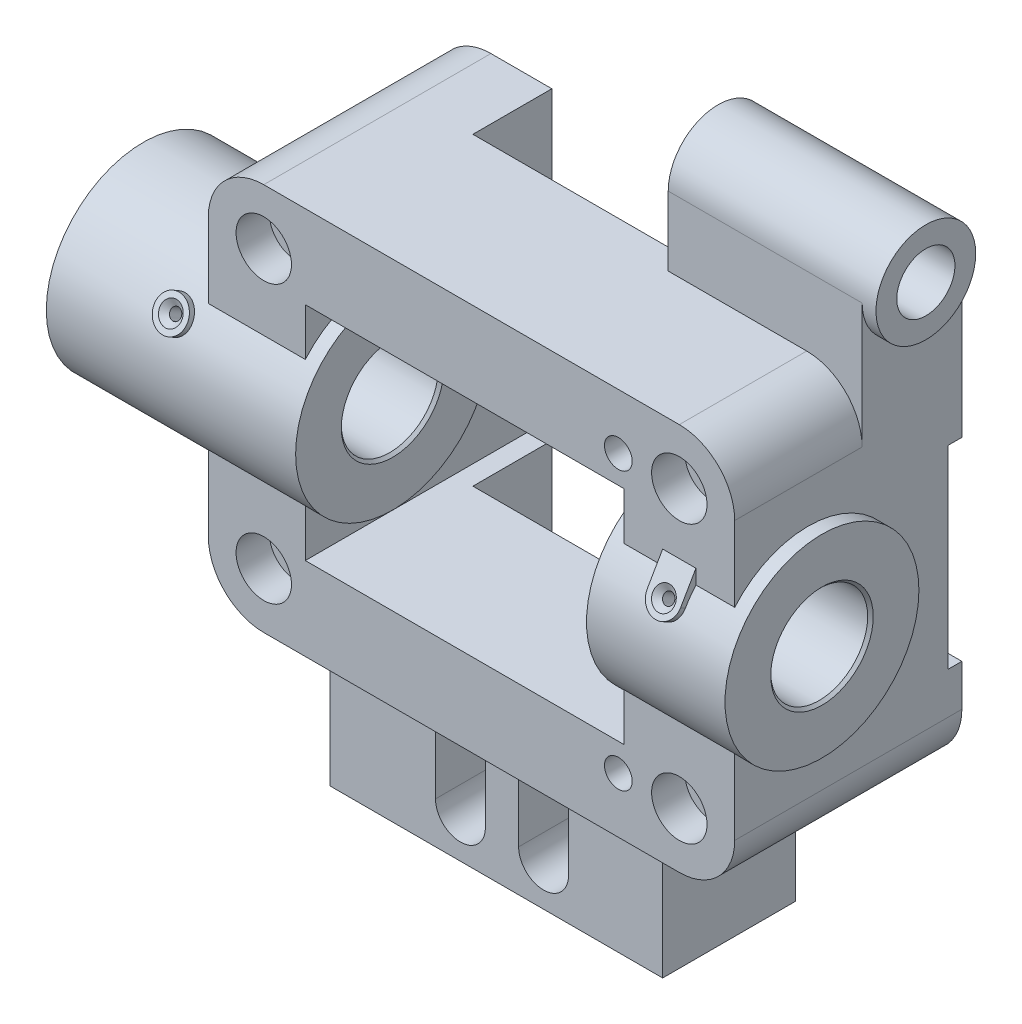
ISO-10303-21;
HEADER;
FILE_DESCRIPTION(('STEP AP214'),'2;1');
FILE_NAME('part.step','',(''),(''),'','','');
FILE_SCHEMA(('AUTOMOTIVE_DESIGN { 1 0 10303 214 1 1 1 1 }'));
ENDSEC;
DATA;
#1=APPLICATION_CONTEXT('core data for automotive mechanical design processes');
#2=APPLICATION_PROTOCOL_DEFINITION('international standard','automotive_design',2000,#1);
#3=PRODUCT_CONTEXT('',#1,'mechanical');
#4=PRODUCT('Part','Part','',(#3));
#5=PRODUCT_RELATED_PRODUCT_CATEGORY('part','',(#4));
#6=PRODUCT_DEFINITION_FORMATION('','',#4);
#7=PRODUCT_DEFINITION_CONTEXT('part definition',#1,'design');
#8=PRODUCT_DEFINITION('design','',#6,#7);
#9=PRODUCT_DEFINITION_SHAPE('','',#8);
#10=(LENGTH_UNIT() NAMED_UNIT(*) SI_UNIT(.MILLI.,.METRE.));
#11=(NAMED_UNIT(*) PLANE_ANGLE_UNIT() SI_UNIT($,.RADIAN.));
#12=(NAMED_UNIT(*) SI_UNIT($,.STERADIAN.) SOLID_ANGLE_UNIT());
#13=UNCERTAINTY_MEASURE_WITH_UNIT(LENGTH_MEASURE(1.E-05),#10,'distance_accuracy_value','');
#14=(GEOMETRIC_REPRESENTATION_CONTEXT(3) GLOBAL_UNCERTAINTY_ASSIGNED_CONTEXT((#13)) GLOBAL_UNIT_ASSIGNED_CONTEXT((#10,
#11,#12)) REPRESENTATION_CONTEXT('',''));
#15=CARTESIAN_POINT('',(0.,0.,0.));
#16=DIRECTION('',(0.,0.,1.));
#17=DIRECTION('',(1.,0.,0.));
#18=AXIS2_PLACEMENT_3D('',#15,#16,#17);
#19=CARTESIAN_POINT('',(-67.,-50.,-82.));
#20=DIRECTION('',(0.,0.,-1.));
#21=DIRECTION('',(-1.,0.,0.));
#22=AXIS2_PLACEMENT_3D('',#19,#20,#21);
#23=PLANE('',#22);
#24=CARTESIAN_POINT('',(61.,50.,-82.));
#25=DIRECTION('',(0.,0.,1.));
#26=DIRECTION('',(1.,0.,0.));
#27=AXIS2_PLACEMENT_3D('',#24,#25,#26);
#28=CIRCLE('',#27,2.85275443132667);
#29=CARTESIAN_POINT('',(63.8527544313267,50.,-82.));
#30=VERTEX_POINT('',#29);
#31=EDGE_CURVE('E2021',#30,#30,#28,.T.);
#32=ORIENTED_EDGE('',*,*,#31,.T.);
#33=EDGE_LOOP('',(#32));
#34=FACE_BOUND('',#33,.T.);
#35=CARTESIAN_POINT('',(83.,50.,-82.));
#36=DIRECTION('',(0.,0.,-1.));
#37=DIRECTION('',(-1.,0.,0.));
#38=AXIS2_PLACEMENT_3D('',#35,#36,#37);
#39=CIRCLE('',#38,6.5);
#40=CARTESIAN_POINT('',(76.5,50.,-82.));
#41=VERTEX_POINT('',#40);
#42=EDGE_CURVE('E2003',#41,#41,#39,.F.);
#43=ORIENTED_EDGE('',*,*,#42,.T.);
#44=EDGE_LOOP('',(#43));
#45=FACE_BOUND('',#44,.T.);
#46=DIRECTION('',(1.,0.,0.));
#47=VECTOR('',#46,1.);
#48=CARTESIAN_POINT('',(-137.,35.,-82.));
#49=LINE('',#48,#47);
#50=CARTESIAN_POINT('',(63.,35.,-82.));
#51=VERTEX_POINT('',#50);
#52=CARTESIAN_POINT('',(103.,35.,-82.));
#53=VERTEX_POINT('',#52);
#54=EDGE_CURVE('E811',#51,#53,#49,.T.);
#55=ORIENTED_EDGE('',*,*,#54,.F.);
#56=DIRECTION('',(0.,1.,0.));
#57=VECTOR('',#56,1.);
#58=CARTESIAN_POINT('',(63.,40.,-82.));
#59=LINE('',#58,#57);
#60=CARTESIAN_POINT('',(63.,40.,-82.));
#61=VERTEX_POINT('',#60);
#62=EDGE_CURVE('E934',#51,#61,#59,.T.);
#63=ORIENTED_EDGE('',*,*,#62,.T.);
#64=DIRECTION('',(-1.,0.,0.));
#65=VECTOR('',#64,1.);
#66=CARTESIAN_POINT('',(-52.,40.,-82.));
#67=LINE('',#66,#65);
#68=CARTESIAN_POINT('',(26.,40.,-82.));
#69=VERTEX_POINT('',#68);
#70=EDGE_CURVE('E906',#61,#69,#67,.T.);
#71=ORIENTED_EDGE('',*,*,#70,.T.);
#72=DIRECTION('',(-0.0333148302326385,-0.999444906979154,0.));
#73=VECTOR('',#72,1.);
#74=CARTESIAN_POINT('',(27.,70.,-82.));
#75=LINE('',#74,#73);
#76=CARTESIAN_POINT('',(27.,70.,-82.));
#77=VERTEX_POINT('',#76);
#78=EDGE_CURVE('E847',#77,#69,#75,.T.);
#79=ORIENTED_EDGE('',*,*,#78,.F.);
#80=DIRECTION('',(-1.,0.,0.));
#81=VECTOR('',#80,1.);
#82=CARTESIAN_POINT('',(-67.,70.,-82.));
#83=LINE('',#82,#81);
#84=CARTESIAN_POINT('',(33.,70.,-82.));
#85=VERTEX_POINT('',#84);
#86=EDGE_CURVE('E569',#85,#77,#83,.T.);
#87=ORIENTED_EDGE('',*,*,#86,.F.);
#88=DIRECTION('',(0.,1.,0.));
#89=VECTOR('',#88,1.);
#90=CARTESIAN_POINT('',(33.,95.,-82.));
#91=LINE('',#90,#89);
#92=CARTESIAN_POINT('',(33.,95.,-82.));
#93=VERTEX_POINT('',#92);
#94=EDGE_CURVE('E977',#85,#93,#91,.T.);
#95=ORIENTED_EDGE('',*,*,#94,.T.);
#96=DIRECTION('',(1.,0.,0.));
#97=VECTOR('',#96,1.);
#98=CARTESIAN_POINT('',(33.,95.,-82.));
#99=LINE('',#98,#97);
#100=CARTESIAN_POINT('',(103.,95.,-82.));
#101=VERTEX_POINT('',#100);
#102=EDGE_CURVE('E985',#93,#101,#99,.T.);
#103=ORIENTED_EDGE('',*,*,#102,.T.);
#104=DIRECTION('',(0.,1.,0.));
#105=VECTOR('',#104,1.);
#106=CARTESIAN_POINT('',(103.,50.,-82.));
#107=LINE('',#106,#105);
#108=EDGE_CURVE('E567',#53,#101,#107,.T.);
#109=ORIENTED_EDGE('',*,*,#108,.F.);
#110=EDGE_LOOP('',(#55,#63,#71,#79,#87,#95,#103,#109));
#111=FACE_BOUND('',#110,.T.);
#112=ADVANCED_FACE('F33',(#34,#45,#111),#23,.T.);
#113=CARTESIAN_POINT('',(-67.,50.,-82.));
#114=DIRECTION('',(0.,0.,-1.));
#115=DIRECTION('',(-1.,0.,0.));
#116=AXIS2_PLACEMENT_3D('',#113,#114,#115);
#117=CIRCLE('',#116,6.5);
#118=CARTESIAN_POINT('',(-73.5,50.,-82.));
#119=VERTEX_POINT('',#118);
#120=EDGE_CURVE('E2018',#119,#119,#117,.F.);
#121=ORIENTED_EDGE('',*,*,#120,.T.);
#122=EDGE_LOOP('',(#121));
#123=FACE_BOUND('',#122,.T.);
#124=CARTESIAN_POINT('',(-87.,35.,-82.));
#125=VERTEX_POINT('',#124);
#126=CARTESIAN_POINT('',(-52.,35.,-82.));
#127=VERTEX_POINT('',#126);
#128=EDGE_CURVE('E812',#125,#127,#49,.T.);
#129=ORIENTED_EDGE('',*,*,#128,.F.);
#130=DIRECTION('',(0.,-1.,0.));
#131=VECTOR('',#130,1.);
#132=CARTESIAN_POINT('',(-87.,-50.,-82.));
#133=LINE('',#132,#131);
#134=CARTESIAN_POINT('',(-87.,50.,-82.));
#135=VERTEX_POINT('',#134);
#136=EDGE_CURVE('E580',#135,#125,#133,.T.);
#137=ORIENTED_EDGE('',*,*,#136,.F.);
#138=CARTESIAN_POINT('',(-67.,50.,-82.));
#139=DIRECTION('',(0.,0.,1.));
#140=DIRECTION('',(-1.,0.,0.));
#141=AXIS2_PLACEMENT_3D('',#138,#139,#140);
#142=CIRCLE('',#141,20.);
#143=CARTESIAN_POINT('',(-67.,70.,-82.));
#144=VERTEX_POINT('',#143);
#145=EDGE_CURVE('E576',#144,#135,#142,.T.);
#146=ORIENTED_EDGE('',*,*,#145,.F.);
#147=CARTESIAN_POINT('',(-45.,70.,-82.));
#148=VERTEX_POINT('',#147);
#149=EDGE_CURVE('E566',#148,#144,#83,.T.);
#150=ORIENTED_EDGE('',*,*,#149,.F.);
#151=DIRECTION('',(0.,1.,0.));
#152=VECTOR('',#151,1.);
#153=CARTESIAN_POINT('',(-45.,-140.,-82.));
#154=LINE('',#153,#152);
#155=CARTESIAN_POINT('',(-45.,40.,-82.));
#156=VERTEX_POINT('',#155);
#157=EDGE_CURVE('E849',#156,#148,#154,.T.);
#158=ORIENTED_EDGE('',*,*,#157,.F.);
#159=CARTESIAN_POINT('',(-52.,40.,-82.));
#160=VERTEX_POINT('',#159);
#161=EDGE_CURVE('E905',#156,#160,#67,.T.);
#162=ORIENTED_EDGE('',*,*,#161,.T.);
#163=DIRECTION('',(0.,-1.,0.));
#164=VECTOR('',#163,1.);
#165=CARTESIAN_POINT('',(-52.,-40.,-82.));
#166=LINE('',#165,#164);
#167=EDGE_CURVE('E910',#160,#127,#166,.T.);
#168=ORIENTED_EDGE('',*,*,#167,.T.);
#169=EDGE_LOOP('',(#129,#137,#146,#150,#158,#162,#168));
#170=FACE_BOUND('',#169,.T.);
#171=ADVANCED_FACE('F500',(#123,#170),#23,.T.);
#172=CARTESIAN_POINT('',(61.,-50.,-82.));
#173=DIRECTION('',(0.,0.,1.));
#174=DIRECTION('',(1.,0.,0.));
#175=AXIS2_PLACEMENT_3D('',#172,#173,#174);
#176=CIRCLE('',#175,2.85275443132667);
#177=CARTESIAN_POINT('',(63.8527544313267,-50.,-82.));
#178=VERTEX_POINT('',#177);
#179=EDGE_CURVE('E539',#178,#178,#176,.T.);
#180=ORIENTED_EDGE('',*,*,#179,.T.);
#181=EDGE_LOOP('',(#180));
#182=FACE_BOUND('',#181,.T.);
#183=CARTESIAN_POINT('',(83.,-50.,-82.));
#184=DIRECTION('',(0.,0.,-1.));
#185=DIRECTION('',(-1.,0.,0.));
#186=AXIS2_PLACEMENT_3D('',#183,#184,#185);
#187=CIRCLE('',#186,6.5);
#188=CARTESIAN_POINT('',(76.5,-50.,-82.));
#189=VERTEX_POINT('',#188);
#190=EDGE_CURVE('E543',#189,#189,#187,.F.);
#191=ORIENTED_EDGE('',*,*,#190,.T.);
#192=EDGE_LOOP('',(#191));
#193=FACE_BOUND('',#192,.T.);
#194=DIRECTION('',(1.,0.,0.));
#195=VECTOR('',#194,1.);
#196=CARTESIAN_POINT('',(-137.,-35.,-82.));
#197=LINE('',#196,#195);
#198=CARTESIAN_POINT('',(63.,-35.,-82.));
#199=VERTEX_POINT('',#198);
#200=CARTESIAN_POINT('',(103.,-35.,-82.));
#201=VERTEX_POINT('',#200);
#202=EDGE_CURVE('E547',#199,#201,#197,.T.);
#203=ORIENTED_EDGE('',*,*,#202,.T.);
#204=CARTESIAN_POINT('',(103.,-50.,-82.));
#205=VERTEX_POINT('',#204);
#206=EDGE_CURVE('E550',#205,#201,#107,.T.);
#207=ORIENTED_EDGE('',*,*,#206,.F.);
#208=CARTESIAN_POINT('',(83.,-50.,-82.));
#209=DIRECTION('',(0.,0.,1.));
#210=DIRECTION('',(-1.,0.,0.));
#211=AXIS2_PLACEMENT_3D('',#208,#209,#210);
#212=CIRCLE('',#211,20.);
#213=CARTESIAN_POINT('',(83.,-70.,-82.));
#214=VERTEX_POINT('',#213);
#215=EDGE_CURVE('E571',#214,#205,#212,.T.);
#216=ORIENTED_EDGE('',*,*,#215,.F.);
#217=DIRECTION('',(1.,0.,0.));
#218=VECTOR('',#217,1.);
#219=CARTESIAN_POINT('',(83.,-70.,-82.));
#220=LINE('',#219,#218);
#221=CARTESIAN_POINT('',(43.,-70.,-82.));
#222=VERTEX_POINT('',#221);
#223=EDGE_CURVE('E995',#222,#214,#220,.T.);
#224=ORIENTED_EDGE('',*,*,#223,.F.);
#225=DIRECTION('',(0.,-1.,0.));
#226=VECTOR('',#225,1.);
#227=CARTESIAN_POINT('',(43.,-140.,-82.));
#228=LINE('',#227,#226);
#229=CARTESIAN_POINT('',(43.,-140.,-82.));
#230=VERTEX_POINT('',#229);
#231=EDGE_CURVE('E943',#222,#230,#228,.T.);
#232=ORIENTED_EDGE('',*,*,#231,.T.);
#233=DIRECTION('',(-1.,0.,0.));
#234=VECTOR('',#233,1.);
#235=CARTESIAN_POINT('',(43.,-140.,-82.));
#236=LINE('',#235,#234);
#237=CARTESIAN_POINT('',(20.,-140.,-82.));
#238=VERTEX_POINT('',#237);
#239=EDGE_CURVE('E962',#230,#238,#236,.T.);
#240=ORIENTED_EDGE('',*,*,#239,.T.);
#241=CARTESIAN_POINT('',(23.3333333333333,-40.,-82.));
#242=VERTEX_POINT('',#241);
#243=EDGE_CURVE('E833',#242,#238,#75,.T.);
#244=ORIENTED_EDGE('',*,*,#243,.F.);
#245=DIRECTION('',(1.,0.,0.));
#246=VECTOR('',#245,1.);
#247=CARTESIAN_POINT('',(63.,-40.,-82.));
#248=LINE('',#247,#246);
#249=CARTESIAN_POINT('',(63.,-40.,-82.));
#250=VERTEX_POINT('',#249);
#251=EDGE_CURVE('E913',#242,#250,#248,.T.);
#252=ORIENTED_EDGE('',*,*,#251,.T.);
#253=EDGE_CURVE('E553',#250,#199,#59,.T.);
#254=ORIENTED_EDGE('',*,*,#253,.T.);
#255=EDGE_LOOP('',(#203,#207,#216,#224,#232,#240,#244,#252,#254));
#256=FACE_BOUND('',#255,.T.);
#257=ADVANCED_FACE('F507',(#182,#193,#256),#23,.T.);
#258=CARTESIAN_POINT('',(103.,50.,-82.));
#259=DIRECTION('',(1.,0.,0.));
#260=DIRECTION('',(0.,0.,-1.));
#261=AXIS2_PLACEMENT_3D('',#258,#259,#260);
#262=PLANE('',#261);
#263=DIRECTION('',(0.,0.,1.));
#264=VECTOR('',#263,1.);
#265=CARTESIAN_POINT('',(103.,35.,-77.));
#266=LINE('',#265,#264);
#267=CARTESIAN_POINT('',(103.,35.,-77.));
#268=VERTEX_POINT('',#267);
#269=EDGE_CURVE('E803',#53,#268,#266,.T.);
#270=ORIENTED_EDGE('',*,*,#269,.F.);
#271=ORIENTED_EDGE('',*,*,#108,.T.);
#272=CARTESIAN_POINT('',(103.,95.,-64.));
#273=DIRECTION('',(1.,0.,0.));
#274=DIRECTION('',(0.,0.,-1.));
#275=AXIS2_PLACEMENT_3D('',#272,#273,#274);
#276=CIRCLE('',#275,18.);
#277=CARTESIAN_POINT('',(103.,95.,-46.));
#278=VERTEX_POINT('',#277);
#279=EDGE_CURVE('E870',#278,#101,#276,.T.);
#280=ORIENTED_EDGE('',*,*,#279,.F.);
#281=DIRECTION('',(0.,-1.,0.));
#282=VECTOR('',#281,1.);
#283=CARTESIAN_POINT('',(103.,50.,-46.));
#284=LINE('',#283,#282);
#285=CARTESIAN_POINT('',(103.,50.,-46.));
#286=VERTEX_POINT('',#285);
#287=EDGE_CURVE('E969',#278,#286,#284,.T.);
#288=ORIENTED_EDGE('',*,*,#287,.T.);
#289=DIRECTION('',(0.,0.,1.));
#290=VECTOR('',#289,1.);
#291=CARTESIAN_POINT('',(103.,50.,-82.));
#292=LINE('',#291,#290);
#293=CARTESIAN_POINT('',(103.,50.,0.));
#294=VERTEX_POINT('',#293);
#295=EDGE_CURVE('E622',#286,#294,#292,.T.);
#296=ORIENTED_EDGE('',*,*,#295,.T.);
#297=DIRECTION('',(0.,1.,0.));
#298=VECTOR('',#297,1.);
#299=CARTESIAN_POINT('',(103.,50.,0.));
#300=LINE('',#299,#298);
#301=CARTESIAN_POINT('',(103.,22.8637267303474,0.));
#302=VERTEX_POINT('',#301);
#303=EDGE_CURVE('E594',#302,#294,#300,.T.);
#304=ORIENTED_EDGE('',*,*,#303,.F.);
#305=CARTESIAN_POINT('',(103.,0.,-26.5));
#306=DIRECTION('',(1.,0.,0.));
#307=DIRECTION('',(0.,0.,-1.));
#308=AXIS2_PLACEMENT_3D('',#305,#306,#307);
#309=CIRCLE('',#308,35.);
#310=CARTESIAN_POINT('',(103.,-22.8637267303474,0.));
#311=VERTEX_POINT('',#310);
#312=EDGE_CURVE('E902',#311,#302,#309,.T.);
#313=ORIENTED_EDGE('',*,*,#312,.F.);
#314=CARTESIAN_POINT('',(103.,-50.,0.));
#315=VERTEX_POINT('',#314);
#316=EDGE_CURVE('E595',#315,#311,#300,.T.);
#317=ORIENTED_EDGE('',*,*,#316,.F.);
#318=DIRECTION('',(0.,0.,1.));
#319=VECTOR('',#318,1.);
#320=CARTESIAN_POINT('',(103.,-50.,-82.));
#321=LINE('',#320,#319);
#322=EDGE_CURVE('E565',#205,#315,#321,.T.);
#323=ORIENTED_EDGE('',*,*,#322,.F.);
#324=ORIENTED_EDGE('',*,*,#206,.T.);
#325=DIRECTION('',(0.,0.,-1.));
#326=VECTOR('',#325,1.);
#327=CARTESIAN_POINT('',(103.,-35.,-82.));
#328=LINE('',#327,#326);
#329=CARTESIAN_POINT('',(103.,-35.,-77.));
#330=VERTEX_POINT('',#329);
#331=EDGE_CURVE('E563',#330,#201,#328,.T.);
#332=ORIENTED_EDGE('',*,*,#331,.F.);
#333=DIRECTION('',(0.,-1.,0.));
#334=VECTOR('',#333,1.);
#335=CARTESIAN_POINT('',(103.,35.,-77.));
#336=LINE('',#335,#334);
#337=EDGE_CURVE('E806',#268,#330,#336,.T.);
#338=ORIENTED_EDGE('',*,*,#337,.F.);
#339=EDGE_LOOP('',(#270,#271,#280,#288,#296,#304,#313,#317,#323,#324,#332,#338));
#340=FACE_BOUND('',#339,.T.);
#341=ADVANCED_FACE('F530',(#340),#262,.T.);
#342=CARTESIAN_POINT('',(-67.,-50.,0.));
#343=DIRECTION('',(0.,0.,-1.));
#344=DIRECTION('',(-1.,0.,0.));
#345=AXIS2_PLACEMENT_3D('',#342,#343,#344);
#346=PLANE('',#345);
#347=CARTESIAN_POINT('',(61.,-50.,0.));
#348=DIRECTION('',(0.,0.,1.));
#349=DIRECTION('',(1.,0.,0.));
#350=AXIS2_PLACEMENT_3D('',#347,#348,#349);
#351=CIRCLE('',#350,5.00000000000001);
#352=CARTESIAN_POINT('',(66.,-50.,0.));
#353=VERTEX_POINT('',#352);
#354=EDGE_CURVE('E1948',#353,#353,#351,.T.);
#355=ORIENTED_EDGE('',*,*,#354,.F.);
#356=EDGE_LOOP('',(#355));
#357=FACE_BOUND('',#356,.T.);
#358=CARTESIAN_POINT('',(83.,-50.,0.));
#359=DIRECTION('',(0.,0.,1.));
#360=DIRECTION('',(1.,0.,0.));
#361=AXIS2_PLACEMENT_3D('',#358,#359,#360);
#362=CIRCLE('',#361,9.99999999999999);
#363=CARTESIAN_POINT('',(93.,-50.,0.));
#364=VERTEX_POINT('',#363);
#365=EDGE_CURVE('E1952',#364,#364,#362,.T.);
#366=ORIENTED_EDGE('',*,*,#365,.F.);
#367=EDGE_LOOP('',(#366));
#368=FACE_BOUND('',#367,.T.);
#369=CARTESIAN_POINT('',(-67.,-50.,0.));
#370=DIRECTION('',(0.,0.,1.));
#371=DIRECTION('',(1.,0.,0.));
#372=AXIS2_PLACEMENT_3D('',#369,#370,#371);
#373=CIRCLE('',#372,10.);
#374=CARTESIAN_POINT('',(-57.,-50.,0.));
#375=VERTEX_POINT('',#374);
#376=EDGE_CURVE('E1955',#375,#375,#373,.T.);
#377=ORIENTED_EDGE('',*,*,#376,.F.);
#378=EDGE_LOOP('',(#377));
#379=FACE_BOUND('',#378,.T.);
#380=DIRECTION('',(0.,-1.,0.));
#381=VECTOR('',#380,1.);
#382=CARTESIAN_POINT('',(-52.,-40.,0.));
#383=LINE('',#382,#381);
#384=CARTESIAN_POINT('',(-52.,-22.8637267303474,0.));
#385=VERTEX_POINT('',#384);
#386=CARTESIAN_POINT('',(-52.,-40.,0.));
#387=VERTEX_POINT('',#386);
#388=EDGE_CURVE('E926',#385,#387,#383,.T.);
#389=ORIENTED_EDGE('',*,*,#388,.F.);
#390=DIRECTION('',(-1.,0.,0.));
#391=VECTOR('',#390,1.);
#392=CARTESIAN_POINT('',(-47.,-22.8637267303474,0.));
#393=LINE('',#392,#391);
#394=CARTESIAN_POINT('',(-87.,-22.8637267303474,0.));
#395=VERTEX_POINT('',#394);
#396=EDGE_CURVE('E885',#385,#395,#393,.T.);
#397=ORIENTED_EDGE('',*,*,#396,.T.);
#398=DIRECTION('',(0.,-1.,0.));
#399=VECTOR('',#398,1.);
#400=CARTESIAN_POINT('',(-87.,-50.,0.));
#401=LINE('',#400,#399);
#402=CARTESIAN_POINT('',(-87.,-50.,0.));
#403=VERTEX_POINT('',#402);
#404=EDGE_CURVE('E607',#395,#403,#401,.T.);
#405=ORIENTED_EDGE('',*,*,#404,.T.);
#406=CARTESIAN_POINT('',(-67.,-50.,0.));
#407=DIRECTION('',(0.,0.,1.));
#408=DIRECTION('',(-1.,0.,0.));
#409=AXIS2_PLACEMENT_3D('',#406,#407,#408);
#410=CIRCLE('',#409,20.);
#411=CARTESIAN_POINT('',(-67.,-70.,0.));
#412=VERTEX_POINT('',#411);
#413=EDGE_CURVE('E584',#403,#412,#410,.T.);
#414=ORIENTED_EDGE('',*,*,#413,.T.);
#415=DIRECTION('',(1.,0.,0.));
#416=VECTOR('',#415,1.);
#417=CARTESIAN_POINT('',(83.,-70.,0.));
#418=LINE('',#417,#416);
#419=CARTESIAN_POINT('',(83.,-70.,0.));
#420=VERTEX_POINT('',#419);
#421=EDGE_CURVE('E587',#412,#420,#418,.T.);
#422=ORIENTED_EDGE('',*,*,#421,.T.);
#423=CARTESIAN_POINT('',(83.,-50.,0.));
#424=DIRECTION('',(0.,0.,1.));
#425=DIRECTION('',(-1.,0.,0.));
#426=AXIS2_PLACEMENT_3D('',#423,#424,#425);
#427=CIRCLE('',#426,20.);
#428=EDGE_CURVE('E591',#420,#315,#427,.T.);
#429=ORIENTED_EDGE('',*,*,#428,.T.);
#430=ORIENTED_EDGE('',*,*,#316,.T.);
#431=DIRECTION('',(1.,0.,0.));
#432=VECTOR('',#431,1.);
#433=CARTESIAN_POINT('',(58.,-22.8637267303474,0.));
#434=LINE('',#433,#432);
#435=CARTESIAN_POINT('',(63.,-22.8637267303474,0.));
#436=VERTEX_POINT('',#435);
#437=EDGE_CURVE('E896',#311,#436,#434,.F.);
#438=ORIENTED_EDGE('',*,*,#437,.T.);
#439=DIRECTION('',(0.,1.,0.));
#440=VECTOR('',#439,1.);
#441=CARTESIAN_POINT('',(63.,40.,0.));
#442=LINE('',#441,#440);
#443=CARTESIAN_POINT('',(63.,-40.,0.));
#444=VERTEX_POINT('',#443);
#445=EDGE_CURVE('E920',#444,#436,#442,.T.);
#446=ORIENTED_EDGE('',*,*,#445,.F.);
#447=DIRECTION('',(1.,0.,0.));
#448=VECTOR('',#447,1.);
#449=CARTESIAN_POINT('',(63.,-40.,0.));
#450=LINE('',#449,#448);
#451=EDGE_CURVE('E917',#387,#444,#450,.T.);
#452=ORIENTED_EDGE('',*,*,#451,.F.);
#453=EDGE_LOOP('',(#389,#397,#405,#414,#422,#429,#430,#438,#446,#452));
#454=FACE_BOUND('',#453,.T.);
#455=ADVANCED_FACE('F523',(#357,#368,#379,#454),#346,.F.);
#456=CARTESIAN_POINT('',(-67.,-50.,-82.));
#457=DIRECTION('',(0.,0.,1.));
#458=DIRECTION('',(1.,0.,0.));
#459=AXIS2_PLACEMENT_3D('',#456,#457,#458);
#460=CYLINDRICAL_SURFACE('',#459,20.);
#461=DIRECTION('',(0.,0.,-1.));
#462=VECTOR('',#461,1.);
#463=CARTESIAN_POINT('',(-77.,-67.3205080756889,-34.));
#464=LINE('',#463,#462);
#465=CARTESIAN_POINT('',(-77.,-67.3205080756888,-34.));
#466=VERTEX_POINT('',#465);
#467=CARTESIAN_POINT('',(-77.,-67.3205080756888,-82.));
#468=VERTEX_POINT('',#467);
#469=EDGE_CURVE('E970',#466,#468,#464,.T.);
#470=ORIENTED_EDGE('',*,*,#469,.F.);
#471=CARTESIAN_POINT('',(-67.0000000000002,-50.0000000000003,-34.));
#472=DIRECTION('',(0.,0.,1.));
#473=DIRECTION('',(-1.,0.,0.));
#474=AXIS2_PLACEMENT_3D('',#471,#472,#473);
#475=CIRCLE('',#474,19.9999999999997);
#476=CARTESIAN_POINT('',(-67.,-70.,-34.));
#477=VERTEX_POINT('',#476);
#478=EDGE_CURVE('E954',#466,#477,#475,.T.);
#479=ORIENTED_EDGE('',*,*,#478,.T.);
#480=DIRECTION('',(0.,0.,1.));
#481=VECTOR('',#480,1.);
#482=CARTESIAN_POINT('',(-67.,-70.,-82.));
#483=LINE('',#482,#481);
#484=EDGE_CURVE('E583',#477,#412,#483,.T.);
#485=ORIENTED_EDGE('',*,*,#484,.T.);
#486=ORIENTED_EDGE('',*,*,#413,.F.);
#487=DIRECTION('',(0.,0.,1.));
#488=VECTOR('',#487,1.);
#489=CARTESIAN_POINT('',(-87.,-50.,-82.));
#490=LINE('',#489,#488);
#491=CARTESIAN_POINT('',(-87.,-50.,-82.));
#492=VERTEX_POINT('',#491);
#493=EDGE_CURVE('E612',#492,#403,#490,.T.);
#494=ORIENTED_EDGE('',*,*,#493,.F.);
#495=CARTESIAN_POINT('',(-67.,-50.,-82.));
#496=DIRECTION('',(0.,0.,1.));
#497=DIRECTION('',(-1.,0.,0.));
#498=AXIS2_PLACEMENT_3D('',#495,#496,#497);
#499=CIRCLE('',#498,20.);
#500=EDGE_CURVE('E611',#492,#468,#499,.T.);
#501=ORIENTED_EDGE('',*,*,#500,.T.);
#502=EDGE_LOOP('',(#470,#479,#485,#486,#494,#501));
#503=FACE_BOUND('',#502,.T.);
#504=ADVANCED_FACE('F1343',(#503),#460,.T.);
#505=CARTESIAN_POINT('',(-87.,-50.,-82.));
#506=DIRECTION('',(-1.,0.,0.));
#507=DIRECTION('',(0.,0.,1.));
#508=AXIS2_PLACEMENT_3D('',#505,#506,#507);
#509=PLANE('',#508);
#510=DIRECTION('',(0.,0.,-1.));
#511=VECTOR('',#510,1.);
#512=CARTESIAN_POINT('',(-87.,35.,-82.));
#513=LINE('',#512,#511);
#514=CARTESIAN_POINT('',(-87.,35.,-77.));
#515=VERTEX_POINT('',#514);
#516=EDGE_CURVE('E831',#515,#125,#513,.T.);
#517=ORIENTED_EDGE('',*,*,#516,.F.);
#518=DIRECTION('',(0.,1.,0.));
#519=VECTOR('',#518,1.);
#520=CARTESIAN_POINT('',(-87.,-50.,-77.));
#521=LINE('',#520,#519);
#522=CARTESIAN_POINT('',(-87.,-35.,-77.));
#523=VERTEX_POINT('',#522);
#524=EDGE_CURVE('E821',#523,#515,#521,.T.);
#525=ORIENTED_EDGE('',*,*,#524,.F.);
#526=DIRECTION('',(0.,0.,1.));
#527=VECTOR('',#526,1.);
#528=CARTESIAN_POINT('',(-87.,-35.,-82.));
#529=LINE('',#528,#527);
#530=CARTESIAN_POINT('',(-87.,-35.,-82.));
#531=VERTEX_POINT('',#530);
#532=EDGE_CURVE('E826',#531,#523,#529,.T.);
#533=ORIENTED_EDGE('',*,*,#532,.F.);
#534=EDGE_CURVE('E579',#531,#492,#133,.T.);
#535=ORIENTED_EDGE('',*,*,#534,.T.);
#536=ORIENTED_EDGE('',*,*,#493,.T.);
#537=ORIENTED_EDGE('',*,*,#404,.F.);
#538=CARTESIAN_POINT('',(-87.,0.,-26.5));
#539=DIRECTION('',(-1.,0.,0.));
#540=DIRECTION('',(0.,0.,1.));
#541=AXIS2_PLACEMENT_3D('',#538,#539,#540);
#542=CIRCLE('',#541,35.);
#543=CARTESIAN_POINT('',(-87.,22.8637267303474,0.));
#544=VERTEX_POINT('',#543);
#545=EDGE_CURVE('E888',#544,#395,#542,.T.);
#546=ORIENTED_EDGE('',*,*,#545,.F.);
#547=CARTESIAN_POINT('',(-87.,50.,0.));
#548=VERTEX_POINT('',#547);
#549=EDGE_CURVE('E608',#548,#544,#401,.T.);
#550=ORIENTED_EDGE('',*,*,#549,.F.);
#551=DIRECTION('',(0.,0.,1.));
#552=VECTOR('',#551,1.);
#553=CARTESIAN_POINT('',(-87.,50.,-82.));
#554=LINE('',#553,#552);
#555=EDGE_CURVE('E616',#135,#548,#554,.T.);
#556=ORIENTED_EDGE('',*,*,#555,.F.);
#557=ORIENTED_EDGE('',*,*,#136,.T.);
#558=EDGE_LOOP('',(#517,#525,#533,#535,#536,#537,#546,#550,#556,#557));
#559=FACE_BOUND('',#558,.T.);
#560=ADVANCED_FACE('F1049',(#559),#509,.T.);
#561=CARTESIAN_POINT('',(-67.,50.,-82.));
#562=DIRECTION('',(0.,0.,1.));
#563=DIRECTION('',(1.,0.,0.));
#564=AXIS2_PLACEMENT_3D('',#561,#562,#563);
#565=CYLINDRICAL_SURFACE('',#564,20.);
#566=CARTESIAN_POINT('',(-67.,50.,0.));
#567=DIRECTION('',(0.,0.,1.));
#568=DIRECTION('',(-1.,0.,0.));
#569=AXIS2_PLACEMENT_3D('',#566,#567,#568);
#570=CIRCLE('',#569,20.);
#571=CARTESIAN_POINT('',(-67.,70.,0.));
#572=VERTEX_POINT('',#571);
#573=EDGE_CURVE('E604',#572,#548,#570,.T.);
#574=ORIENTED_EDGE('',*,*,#573,.F.);
#575=DIRECTION('',(0.,0.,1.));
#576=VECTOR('',#575,1.);
#577=CARTESIAN_POINT('',(-67.,70.,-82.));
#578=LINE('',#577,#576);
#579=EDGE_CURVE('E618',#144,#572,#578,.T.);
#580=ORIENTED_EDGE('',*,*,#579,.F.);
#581=ORIENTED_EDGE('',*,*,#145,.T.);
#582=ORIENTED_EDGE('',*,*,#555,.T.);
#583=EDGE_LOOP('',(#574,#580,#581,#582));
#584=FACE_BOUND('',#583,.T.);
#585=ADVANCED_FACE('F1044',(#584),#565,.T.);
#586=CARTESIAN_POINT('',(-67.,70.,-82.));
#587=DIRECTION('',(0.,1.,0.));
#588=DIRECTION('',(0.,0.,1.));
#589=AXIS2_PLACEMENT_3D('',#586,#587,#588);
#590=PLANE('',#589);
#591=DIRECTION('',(0.,0.,-1.));
#592=VECTOR('',#591,1.);
#593=CARTESIAN_POINT('',(27.,70.,-53.5));
#594=LINE('',#593,#592);
#595=CARTESIAN_POINT('',(27.,70.,-53.5));
#596=VERTEX_POINT('',#595);
#597=EDGE_CURVE('E852',#596,#77,#594,.T.);
#598=ORIENTED_EDGE('',*,*,#597,.F.);
#599=DIRECTION('',(1.,0.,0.));
#600=VECTOR('',#599,1.);
#601=CARTESIAN_POINT('',(-45.,70.,-53.5));
#602=LINE('',#601,#600);
#603=CARTESIAN_POINT('',(-45.,70.,-53.5));
#604=VERTEX_POINT('',#603);
#605=EDGE_CURVE('E843',#604,#596,#602,.T.);
#606=ORIENTED_EDGE('',*,*,#605,.F.);
#607=DIRECTION('',(0.,0.,-1.));
#608=VECTOR('',#607,1.);
#609=CARTESIAN_POINT('',(-45.,70.,-53.5));
#610=LINE('',#609,#608);
#611=EDGE_CURVE('E855',#604,#148,#610,.T.);
#612=ORIENTED_EDGE('',*,*,#611,.T.);
#613=ORIENTED_EDGE('',*,*,#149,.T.);
#614=ORIENTED_EDGE('',*,*,#579,.T.);
#615=DIRECTION('',(-1.,0.,0.));
#616=VECTOR('',#615,1.);
#617=CARTESIAN_POINT('',(-67.,70.,0.));
#618=LINE('',#617,#616);
#619=CARTESIAN_POINT('',(83.,70.,0.));
#620=VERTEX_POINT('',#619);
#621=EDGE_CURVE('E601',#620,#572,#618,.T.);
#622=ORIENTED_EDGE('',*,*,#621,.F.);
#623=DIRECTION('',(0.,0.,1.));
#624=VECTOR('',#623,1.);
#625=CARTESIAN_POINT('',(83.,70.,-82.));
#626=LINE('',#625,#624);
#627=CARTESIAN_POINT('',(83.,70.,-46.));
#628=VERTEX_POINT('',#627);
#629=EDGE_CURVE('E620',#628,#620,#626,.T.);
#630=ORIENTED_EDGE('',*,*,#629,.F.);
#631=DIRECTION('',(1.,0.,0.));
#632=VECTOR('',#631,1.);
#633=CARTESIAN_POINT('',(-67.,70.,-46.));
#634=LINE('',#633,#632);
#635=CARTESIAN_POINT('',(33.,70.,-46.));
#636=VERTEX_POINT('',#635);
#637=EDGE_CURVE('E588',#636,#628,#634,.T.);
#638=ORIENTED_EDGE('',*,*,#637,.F.);
#639=DIRECTION('',(0.,0.,1.));
#640=VECTOR('',#639,1.);
#641=CARTESIAN_POINT('',(33.,70.,-82.));
#642=LINE('',#641,#640);
#643=EDGE_CURVE('E990',#85,#636,#642,.T.);
#644=ORIENTED_EDGE('',*,*,#643,.F.);
#645=ORIENTED_EDGE('',*,*,#86,.T.);
#646=EDGE_LOOP('',(#598,#606,#612,#613,#614,#622,#630,#638,#644,#645));
#647=FACE_BOUND('',#646,.T.);
#648=ADVANCED_FACE('F1038',(#647),#590,.T.);
#649=CARTESIAN_POINT('',(83.,50.,-82.));
#650=DIRECTION('',(0.,0.,1.));
#651=DIRECTION('',(1.,0.,0.));
#652=AXIS2_PLACEMENT_3D('',#649,#650,#651);
#653=CYLINDRICAL_SURFACE('',#652,20.);
#654=CARTESIAN_POINT('',(83.,50.,-46.));
#655=DIRECTION('',(0.,0.,1.));
#656=DIRECTION('',(1.,0.,0.));
#657=AXIS2_PLACEMENT_3D('',#654,#655,#656);
#658=CIRCLE('',#657,20.);
#659=EDGE_CURVE('E615',#628,#286,#658,.F.);
#660=ORIENTED_EDGE('',*,*,#659,.F.);
#661=ORIENTED_EDGE('',*,*,#629,.T.);
#662=CARTESIAN_POINT('',(83.,50.,0.));
#663=DIRECTION('',(0.,0.,1.));
#664=DIRECTION('',(-1.,0.,0.));
#665=AXIS2_PLACEMENT_3D('',#662,#663,#664);
#666=CIRCLE('',#665,20.);
#667=EDGE_CURVE('E598',#294,#620,#666,.T.);
#668=ORIENTED_EDGE('',*,*,#667,.F.);
#669=ORIENTED_EDGE('',*,*,#295,.F.);
#670=EDGE_LOOP('',(#660,#661,#668,#669));
#671=FACE_BOUND('',#670,.T.);
#672=ADVANCED_FACE('F1033',(#671),#653,.T.);
#673=CARTESIAN_POINT('',(83.,-50.,-82.));
#674=DIRECTION('',(0.,0.,1.));
#675=DIRECTION('',(1.,0.,0.));
#676=AXIS2_PLACEMENT_3D('',#673,#674,#675);
#677=CYLINDRICAL_SURFACE('',#676,20.);
#678=ORIENTED_EDGE('',*,*,#428,.F.);
#679=DIRECTION('',(0.,0.,1.));
#680=VECTOR('',#679,1.);
#681=CARTESIAN_POINT('',(83.,-70.,-82.));
#682=LINE('',#681,#680);
#683=EDGE_CURVE('E626',#214,#420,#682,.T.);
#684=ORIENTED_EDGE('',*,*,#683,.F.);
#685=ORIENTED_EDGE('',*,*,#215,.T.);
#686=ORIENTED_EDGE('',*,*,#322,.T.);
#687=EDGE_LOOP('',(#678,#684,#685,#686));
#688=FACE_BOUND('',#687,.T.);
#689=ADVANCED_FACE('F524',(#688),#677,.T.);
#690=CARTESIAN_POINT('',(83.,-70.,-82.));
#691=DIRECTION('',(0.,-1.,0.));
#692=DIRECTION('',(1.,0.,0.));
#693=AXIS2_PLACEMENT_3D('',#690,#691,#692);
#694=PLANE('',#693);
#695=DIRECTION('',(0.,0.,-1.));
#696=VECTOR('',#695,1.);
#697=CARTESIAN_POINT('',(43.,-70.,-34.));
#698=LINE('',#697,#696);
#699=CARTESIAN_POINT('',(43.,-70.,-34.));
#700=VERTEX_POINT('',#699);
#701=EDGE_CURVE('E967',#700,#222,#698,.T.);
#702=ORIENTED_EDGE('',*,*,#701,.T.);
#703=ORIENTED_EDGE('',*,*,#223,.T.);
#704=ORIENTED_EDGE('',*,*,#683,.T.);
#705=ORIENTED_EDGE('',*,*,#421,.F.);
#706=ORIENTED_EDGE('',*,*,#484,.F.);
#707=DIRECTION('',(1.,0.,0.));
#708=VECTOR('',#707,1.);
#709=CARTESIAN_POINT('',(43.,-70.,-34.));
#710=LINE('',#709,#708);
#711=EDGE_CURVE('E956',#477,#700,#710,.T.);
#712=ORIENTED_EDGE('',*,*,#711,.T.);
#713=EDGE_LOOP('',(#702,#703,#704,#705,#706,#712));
#714=FACE_BOUND('',#713,.T.);
#715=ADVANCED_FACE('F515',(#714),#694,.T.);
#716=CARTESIAN_POINT('',(-67.,-50.,-82.));
#717=DIRECTION('',(0.,0.,-1.));
#718=DIRECTION('',(-1.,0.,0.));
#719=AXIS2_PLACEMENT_3D('',#716,#717,#718);
#720=CIRCLE('',#719,6.5);
#721=CARTESIAN_POINT('',(-73.5,-50.,-82.));
#722=VERTEX_POINT('',#721);
#723=EDGE_CURVE('E2013',#722,#722,#720,.F.);
#724=ORIENTED_EDGE('',*,*,#723,.T.);
#725=EDGE_LOOP('',(#724));
#726=FACE_BOUND('',#725,.T.);
#727=CARTESIAN_POINT('',(-52.,-35.,-82.));
#728=VERTEX_POINT('',#727);
#729=EDGE_CURVE('E557',#531,#728,#197,.T.);
#730=ORIENTED_EDGE('',*,*,#729,.T.);
#731=CARTESIAN_POINT('',(-52.,-40.,-82.));
#732=VERTEX_POINT('',#731);
#733=EDGE_CURVE('E909',#728,#732,#166,.T.);
#734=ORIENTED_EDGE('',*,*,#733,.T.);
#735=CARTESIAN_POINT('',(-45.,-40.,-82.));
#736=VERTEX_POINT('',#735);
#737=EDGE_CURVE('E914',#732,#736,#248,.T.);
#738=ORIENTED_EDGE('',*,*,#737,.T.);
#739=CARTESIAN_POINT('',(-45.,-140.,-82.));
#740=VERTEX_POINT('',#739);
#741=EDGE_CURVE('E850',#740,#736,#154,.T.);
#742=ORIENTED_EDGE('',*,*,#741,.F.);
#743=CARTESIAN_POINT('',(-77.,-140.,-82.));
#744=VERTEX_POINT('',#743);
#745=EDGE_CURVE('E961',#740,#744,#236,.T.);
#746=ORIENTED_EDGE('',*,*,#745,.T.);
#747=DIRECTION('',(0.,1.,0.));
#748=VECTOR('',#747,1.);
#749=CARTESIAN_POINT('',(-77.,-140.,-82.));
#750=LINE('',#749,#748);
#751=EDGE_CURVE('E948',#744,#468,#750,.T.);
#752=ORIENTED_EDGE('',*,*,#751,.T.);
#753=ORIENTED_EDGE('',*,*,#500,.F.);
#754=ORIENTED_EDGE('',*,*,#534,.F.);
#755=EDGE_LOOP('',(#730,#734,#738,#742,#746,#752,#753,#754));
#756=FACE_BOUND('',#755,.T.);
#757=ADVANCED_FACE('F503',(#726,#756),#23,.T.);
#758=CARTESIAN_POINT('',(61.,50.,0.));
#759=DIRECTION('',(0.,0.,1.));
#760=DIRECTION('',(1.,0.,0.));
#761=AXIS2_PLACEMENT_3D('',#758,#759,#760);
#762=CIRCLE('',#761,5.00000000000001);
#763=CARTESIAN_POINT('',(66.,50.,0.));
#764=VERTEX_POINT('',#763);
#765=EDGE_CURVE('E2025',#764,#764,#762,.T.);
#766=ORIENTED_EDGE('',*,*,#765,.F.);
#767=EDGE_LOOP('',(#766));
#768=FACE_BOUND('',#767,.T.);
#769=CARTESIAN_POINT('',(-67.,50.,0.));
#770=DIRECTION('',(0.,0.,1.));
#771=DIRECTION('',(1.,0.,0.));
#772=AXIS2_PLACEMENT_3D('',#769,#770,#771);
#773=CIRCLE('',#772,10.);
#774=CARTESIAN_POINT('',(-57.,50.,0.));
#775=VERTEX_POINT('',#774);
#776=EDGE_CURVE('E1961',#775,#775,#773,.T.);
#777=ORIENTED_EDGE('',*,*,#776,.F.);
#778=EDGE_LOOP('',(#777));
#779=FACE_BOUND('',#778,.T.);
#780=CARTESIAN_POINT('',(83.,50.,0.));
#781=DIRECTION('',(0.,0.,1.));
#782=DIRECTION('',(1.,0.,0.));
#783=AXIS2_PLACEMENT_3D('',#780,#781,#782);
#784=CIRCLE('',#783,9.99999999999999);
#785=CARTESIAN_POINT('',(93.,50.,0.));
#786=VERTEX_POINT('',#785);
#787=EDGE_CURVE('E1970',#786,#786,#784,.T.);
#788=ORIENTED_EDGE('',*,*,#787,.F.);
#789=EDGE_LOOP('',(#788));
#790=FACE_BOUND('',#789,.T.);
#791=DIRECTION('',(1.,0.,0.));
#792=VECTOR('',#791,1.);
#793=CARTESIAN_POINT('',(58.,22.8637267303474,0.));
#794=LINE('',#793,#792);
#795=CARTESIAN_POINT('',(63.,22.8637267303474,0.));
#796=VERTEX_POINT('',#795);
#797=CARTESIAN_POINT('',(77.,22.8637267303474,0.));
#798=VERTEX_POINT('',#797);
#799=EDGE_CURVE('E900',#796,#798,#794,.T.);
#800=ORIENTED_EDGE('',*,*,#799,.T.);
#801=DIRECTION('',(0.,-1.,0.));
#802=VECTOR('',#801,1.);
#803=CARTESIAN_POINT('',(77.,-288659.834812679,0.));
#804=LINE('',#803,#802);
#805=CARTESIAN_POINT('',(77.,28.1006535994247,0.));
#806=VERTEX_POINT('',#805);
#807=EDGE_CURVE('E53',#806,#798,#804,.T.);
#808=ORIENTED_EDGE('',*,*,#807,.F.);
#809=DIRECTION('',(-1.,0.,0.));
#810=VECTOR('',#809,1.);
#811=CARTESIAN_POINT('',(83.,28.1006535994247,0.));
#812=LINE('',#811,#810);
#813=CARTESIAN_POINT('',(89.,28.1006535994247,0.));
#814=VERTEX_POINT('',#813);
#815=EDGE_CURVE('E48',#814,#806,#812,.T.);
#816=ORIENTED_EDGE('',*,*,#815,.F.);
#817=DIRECTION('',(0.,1.,0.));
#818=VECTOR('',#817,1.);
#819=CARTESIAN_POINT('',(89.,-288643.184847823,0.));
#820=LINE('',#819,#818);
#821=CARTESIAN_POINT('',(89.,22.8637267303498,0.));
#822=VERTEX_POINT('',#821);
#823=EDGE_CURVE('E691',#822,#814,#820,.T.);
#824=ORIENTED_EDGE('',*,*,#823,.F.);
#825=EDGE_CURVE('E899',#822,#302,#794,.T.);
#826=ORIENTED_EDGE('',*,*,#825,.T.);
#827=ORIENTED_EDGE('',*,*,#303,.T.);
#828=ORIENTED_EDGE('',*,*,#667,.T.);
#829=ORIENTED_EDGE('',*,*,#621,.T.);
#830=ORIENTED_EDGE('',*,*,#573,.T.);
#831=ORIENTED_EDGE('',*,*,#549,.T.);
#832=DIRECTION('',(-1.,0.,0.));
#833=VECTOR('',#832,1.);
#834=CARTESIAN_POINT('',(-47.,22.8637267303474,0.));
#835=LINE('',#834,#833);
#836=CARTESIAN_POINT('',(-52.,22.8637267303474,0.));
#837=VERTEX_POINT('',#836);
#838=EDGE_CURVE('E882',#544,#837,#835,.F.);
#839=ORIENTED_EDGE('',*,*,#838,.T.);
#840=CARTESIAN_POINT('',(-52.,40.,0.));
#841=VERTEX_POINT('',#840);
#842=EDGE_CURVE('E927',#841,#837,#383,.T.);
#843=ORIENTED_EDGE('',*,*,#842,.F.);
#844=DIRECTION('',(-1.,0.,0.));
#845=VECTOR('',#844,1.);
#846=CARTESIAN_POINT('',(-52.,40.,0.));
#847=LINE('',#846,#845);
#848=CARTESIAN_POINT('',(63.,40.,0.));
#849=VERTEX_POINT('',#848);
#850=EDGE_CURVE('E923',#849,#841,#847,.T.);
#851=ORIENTED_EDGE('',*,*,#850,.F.);
#852=EDGE_CURVE('E919',#796,#849,#442,.T.);
#853=ORIENTED_EDGE('',*,*,#852,.F.);
#854=EDGE_LOOP('',(#800,#808,#816,#824,#826,#827,#828,#829,#830,#831,#839,#843,#851,#853));
#855=FACE_BOUND('',#854,.T.);
#856=ADVANCED_FACE('F514',(#768,#779,#790,#855),#346,.F.);
#857=CARTESIAN_POINT('',(33.,50.,-46.));
#858=DIRECTION('',(0.,0.,1.));
#859=DIRECTION('',(1.,0.,0.));
#860=AXIS2_PLACEMENT_3D('',#857,#858,#859);
#861=PLANE('',#860);
#862=DIRECTION('',(0.,-1.,0.));
#863=VECTOR('',#862,1.);
#864=CARTESIAN_POINT('',(33.,50.,-46.));
#865=LINE('',#864,#863);
#866=CARTESIAN_POINT('',(33.,95.,-46.));
#867=VERTEX_POINT('',#866);
#868=EDGE_CURVE('E982',#867,#636,#865,.T.);
#869=ORIENTED_EDGE('',*,*,#868,.T.);
#870=ORIENTED_EDGE('',*,*,#637,.T.);
#871=ORIENTED_EDGE('',*,*,#659,.T.);
#872=ORIENTED_EDGE('',*,*,#287,.F.);
#873=DIRECTION('',(1.,0.,0.));
#874=VECTOR('',#873,1.);
#875=CARTESIAN_POINT('',(33.,95.,-46.));
#876=LINE('',#875,#874);
#877=EDGE_CURVE('E987',#867,#278,#876,.T.);
#878=ORIENTED_EDGE('',*,*,#877,.F.);
#879=EDGE_LOOP('',(#869,#870,#871,#872,#878));
#880=FACE_BOUND('',#879,.T.);
#881=ADVANCED_FACE('F521',(#880),#861,.T.);
#882=CARTESIAN_POINT('',(33.,95.,-64.));
#883=DIRECTION('',(1.,0.,0.));
#884=DIRECTION('',(0.,0.,-1.));
#885=AXIS2_PLACEMENT_3D('',#882,#883,#884);
#886=CYLINDRICAL_SURFACE('',#885,18.);
#887=ORIENTED_EDGE('',*,*,#877,.T.);
#888=ORIENTED_EDGE('',*,*,#279,.T.);
#889=ORIENTED_EDGE('',*,*,#102,.F.);
#890=CARTESIAN_POINT('',(33.,95.,-64.));
#891=DIRECTION('',(1.,0.,0.));
#892=DIRECTION('',(0.,0.,1.));
#893=AXIS2_PLACEMENT_3D('',#890,#891,#892);
#894=CIRCLE('',#893,18.);
#895=EDGE_CURVE('E979',#93,#867,#894,.T.);
#896=ORIENTED_EDGE('',*,*,#895,.T.);
#897=EDGE_LOOP('',(#887,#888,#889,#896));
#898=FACE_BOUND('',#897,.T.);
#899=CARTESIAN_POINT('',(108.,95.,-64.));
#900=DIRECTION('',(1.,0.,0.));
#901=DIRECTION('',(0.,0.,-1.));
#902=AXIS2_PLACEMENT_3D('',#899,#900,#901);
#903=CIRCLE('',#902,18.);
#904=CARTESIAN_POINT('',(108.,95.,-82.));
#905=VERTEX_POINT('',#904);
#906=EDGE_CURVE('E871',#905,#905,#903,.T.);
#907=ORIENTED_EDGE('',*,*,#906,.F.);
#908=EDGE_LOOP('',(#907));
#909=FACE_BOUND('',#908,.T.);
#910=ADVANCED_FACE('F1220',(#898,#909),#886,.T.);
#911=CARTESIAN_POINT('',(33.,95.,-64.));
#912=DIRECTION('',(-1.,0.,0.));
#913=DIRECTION('',(0.,0.,1.));
#914=AXIS2_PLACEMENT_3D('',#911,#912,#913);
#915=PLANE('',#914);
#916=CARTESIAN_POINT('',(33.,95.,-64.));
#917=DIRECTION('',(-1.,0.,0.));
#918=DIRECTION('',(0.,0.,1.));
#919=AXIS2_PLACEMENT_3D('',#916,#917,#918);
#920=CIRCLE('',#919,8.);
#921=CARTESIAN_POINT('',(33.,95.,-56.));
#922=VERTEX_POINT('',#921);
#923=EDGE_CURVE('E1976',#922,#922,#920,.T.);
#924=ORIENTED_EDGE('',*,*,#923,.F.);
#925=EDGE_LOOP('',(#924));
#926=FACE_BOUND('',#925,.T.);
#927=ORIENTED_EDGE('',*,*,#94,.F.);
#928=ORIENTED_EDGE('',*,*,#643,.T.);
#929=ORIENTED_EDGE('',*,*,#868,.F.);
#930=ORIENTED_EDGE('',*,*,#895,.F.);
#931=EDGE_LOOP('',(#927,#928,#929,#930));
#932=FACE_BOUND('',#931,.T.);
#933=ADVANCED_FACE('F1217',(#926,#932),#915,.T.);
#934=CARTESIAN_POINT('',(43.,-140.,-34.));
#935=DIRECTION('',(1.,0.,0.));
#936=DIRECTION('',(0.,0.,-1.));
#937=AXIS2_PLACEMENT_3D('',#934,#935,#936);
#938=PLANE('',#937);
#939=ORIENTED_EDGE('',*,*,#231,.F.);
#940=ORIENTED_EDGE('',*,*,#701,.F.);
#941=DIRECTION('',(0.,-1.,0.));
#942=VECTOR('',#941,1.);
#943=CARTESIAN_POINT('',(43.,-140.,-34.));
#944=LINE('',#943,#942);
#945=CARTESIAN_POINT('',(43.,-140.,-34.));
#946=VERTEX_POINT('',#945);
#947=EDGE_CURVE('E944',#700,#946,#944,.T.);
#948=ORIENTED_EDGE('',*,*,#947,.T.);
#949=DIRECTION('',(0.,0.,-1.));
#950=VECTOR('',#949,1.);
#951=CARTESIAN_POINT('',(43.,-140.,-34.));
#952=LINE('',#951,#950);
#953=EDGE_CURVE('E958',#946,#230,#952,.T.);
#954=ORIENTED_EDGE('',*,*,#953,.T.);
#955=EDGE_LOOP('',(#939,#940,#948,#954));
#956=FACE_BOUND('',#955,.T.);
#957=ADVANCED_FACE('F1003',(#956),#938,.T.);
#958=CARTESIAN_POINT('',(-77.,-140.,-34.));
#959=DIRECTION('',(-1.,0.,0.));
#960=DIRECTION('',(0.,0.,1.));
#961=AXIS2_PLACEMENT_3D('',#958,#959,#960);
#962=PLANE('',#961);
#963=ORIENTED_EDGE('',*,*,#751,.F.);
#964=DIRECTION('',(0.,0.,-1.));
#965=VECTOR('',#964,1.);
#966=CARTESIAN_POINT('',(-77.,-140.,-34.));
#967=LINE('',#966,#965);
#968=CARTESIAN_POINT('',(-77.,-140.,-34.));
#969=VERTEX_POINT('',#968);
#970=EDGE_CURVE('E973',#969,#744,#967,.T.);
#971=ORIENTED_EDGE('',*,*,#970,.F.);
#972=DIRECTION('',(0.,1.,0.));
#973=VECTOR('',#972,1.);
#974=CARTESIAN_POINT('',(-77.,-140.,-34.));
#975=LINE('',#974,#973);
#976=EDGE_CURVE('E951',#969,#466,#975,.T.);
#977=ORIENTED_EDGE('',*,*,#976,.T.);
#978=ORIENTED_EDGE('',*,*,#469,.T.);
#979=EDGE_LOOP('',(#963,#971,#977,#978));
#980=FACE_BOUND('',#979,.T.);
#981=ADVANCED_FACE('F1208',(#980),#962,.T.);
#982=CARTESIAN_POINT('',(43.,-140.,-34.));
#983=DIRECTION('',(0.,-1.,0.));
#984=DIRECTION('',(0.,0.,-1.));
#985=AXIS2_PLACEMENT_3D('',#982,#983,#984);
#986=PLANE('',#985);
#987=CARTESIAN_POINT('',(-63.,-140.,-68.));
#988=DIRECTION('',(0.,-1.,0.));
#989=DIRECTION('',(0.,0.,-1.));
#990=AXIS2_PLACEMENT_3D('',#987,#988,#989);
#991=CIRCLE('',#990,5.09999999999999);
#992=CARTESIAN_POINT('',(-63.,-140.,-73.1));
#993=VERTEX_POINT('',#992);
#994=EDGE_CURVE('E386',#993,#993,#991,.T.);
#995=ORIENTED_EDGE('',*,*,#994,.F.);
#996=EDGE_LOOP('',(#995));
#997=FACE_BOUND('',#996,.T.);
#998=CARTESIAN_POINT('',(31.,-140.,-68.));
#999=DIRECTION('',(0.,-1.,0.));
#1000=DIRECTION('',(0.,0.,-1.));
#1001=AXIS2_PLACEMENT_3D('',#998,#999,#1000);
#1002=CIRCLE('',#1001,5.09999999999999);
#1003=CARTESIAN_POINT('',(31.,-140.,-73.1));
#1004=VERTEX_POINT('',#1003);
#1005=EDGE_CURVE('E392',#1004,#1004,#1002,.T.);
#1006=ORIENTED_EDGE('',*,*,#1005,.F.);
#1007=EDGE_LOOP('',(#1006));
#1008=FACE_BOUND('',#1007,.T.);
#1009=DIRECTION('',(0.,0.,-1.));
#1010=VECTOR('',#1009,1.);
#1011=CARTESIAN_POINT('',(20.,-140.,-53.5));
#1012=LINE('',#1011,#1010);
#1013=CARTESIAN_POINT('',(20.,-140.,-53.5));
#1014=VERTEX_POINT('',#1013);
#1015=EDGE_CURVE('E846',#1014,#238,#1012,.T.);
#1016=ORIENTED_EDGE('',*,*,#1015,.T.);
#1017=ORIENTED_EDGE('',*,*,#239,.F.);
#1018=ORIENTED_EDGE('',*,*,#953,.F.);
#1019=DIRECTION('',(-1.,0.,0.));
#1020=VECTOR('',#1019,1.);
#1021=CARTESIAN_POINT('',(43.,-140.,-34.));
#1022=LINE('',#1021,#1020);
#1023=EDGE_CURVE('E947',#946,#969,#1022,.T.);
#1024=ORIENTED_EDGE('',*,*,#1023,.T.);
#1025=ORIENTED_EDGE('',*,*,#970,.T.);
#1026=ORIENTED_EDGE('',*,*,#745,.F.);
#1027=DIRECTION('',(0.,0.,-1.));
#1028=VECTOR('',#1027,1.);
#1029=CARTESIAN_POINT('',(-45.,-140.,-53.5));
#1030=LINE('',#1029,#1028);
#1031=CARTESIAN_POINT('',(-45.,-140.,-53.5));
#1032=VERTEX_POINT('',#1031);
#1033=EDGE_CURVE('E858',#1032,#740,#1030,.T.);
#1034=ORIENTED_EDGE('',*,*,#1033,.F.);
#1035=DIRECTION('',(-1.,0.,0.));
#1036=VECTOR('',#1035,1.);
#1037=CARTESIAN_POINT('',(20.,-140.,-53.5));
#1038=LINE('',#1037,#1036);
#1039=EDGE_CURVE('E836',#1014,#1032,#1038,.T.);
#1040=ORIENTED_EDGE('',*,*,#1039,.F.);
#1041=EDGE_LOOP('',(#1016,#1017,#1018,#1024,#1025,#1026,#1034,#1040));
#1042=FACE_BOUND('',#1041,.T.);
#1043=ADVANCED_FACE('F1008',(#997,#1008,#1042),#986,.T.);
#1044=CARTESIAN_POINT('',(-67.0000000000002,-50.0000000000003,-34.));
#1045=DIRECTION('',(0.,0.,-1.));
#1046=DIRECTION('',(-1.,0.,0.));
#1047=AXIS2_PLACEMENT_3D('',#1044,#1045,#1046);
#1048=PLANE('',#1047);
#1049=DIRECTION('',(0.,-1.,0.));
#1050=VECTOR('',#1049,1.);
#1051=CARTESIAN_POINT('',(-39.,-125.,-34.));
#1052=LINE('',#1051,#1050);
#1053=CARTESIAN_POINT('',(-39.,-93.0000000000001,-34.));
#1054=VERTEX_POINT('',#1053);
#1055=CARTESIAN_POINT('',(-39.,-125.,-34.));
#1056=VERTEX_POINT('',#1055);
#1057=EDGE_CURVE('E751',#1054,#1056,#1052,.T.);
#1058=ORIENTED_EDGE('',*,*,#1057,.F.);
#1059=CARTESIAN_POINT('',(-30.,-93.0000000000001,-34.));
#1060=DIRECTION('',(0.,0.,1.));
#1061=DIRECTION('',(1.,0.,0.));
#1062=AXIS2_PLACEMENT_3D('',#1059,#1060,#1061);
#1063=CIRCLE('',#1062,9.);
#1064=CARTESIAN_POINT('',(-21.,-93.0000000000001,-34.));
#1065=VERTEX_POINT('',#1064);
#1066=EDGE_CURVE('E749',#1065,#1054,#1063,.T.);
#1067=ORIENTED_EDGE('',*,*,#1066,.F.);
#1068=DIRECTION('',(0.,1.,0.));
#1069=VECTOR('',#1068,1.);
#1070=CARTESIAN_POINT('',(-21.,-93.0000000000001,-34.));
#1071=LINE('',#1070,#1069);
#1072=CARTESIAN_POINT('',(-21.,-125.,-34.));
#1073=VERTEX_POINT('',#1072);
#1074=EDGE_CURVE('E757',#1073,#1065,#1071,.T.);
#1075=ORIENTED_EDGE('',*,*,#1074,.F.);
#1076=CARTESIAN_POINT('',(-30.,-125.,-34.));
#1077=DIRECTION('',(0.,0.,1.));
#1078=DIRECTION('',(1.,0.,0.));
#1079=AXIS2_PLACEMENT_3D('',#1076,#1077,#1078);
#1080=CIRCLE('',#1079,9.);
#1081=EDGE_CURVE('E754',#1056,#1073,#1080,.T.);
#1082=ORIENTED_EDGE('',*,*,#1081,.F.);
#1083=EDGE_LOOP('',(#1058,#1067,#1075,#1082));
#1084=FACE_BOUND('',#1083,.T.);
#1085=DIRECTION('',(0.,1.,0.));
#1086=VECTOR('',#1085,1.);
#1087=CARTESIAN_POINT('',(9.,-125.,-34.));
#1088=LINE('',#1087,#1086);
#1089=CARTESIAN_POINT('',(8.99999999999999,-125.,-34.));
#1090=VERTEX_POINT('',#1089);
#1091=CARTESIAN_POINT('',(9.,-93.,-34.));
#1092=VERTEX_POINT('',#1091);
#1093=EDGE_CURVE('E782',#1090,#1092,#1088,.T.);
#1094=ORIENTED_EDGE('',*,*,#1093,.F.);
#1095=CARTESIAN_POINT('',(0.,-125.,-34.));
#1096=DIRECTION('',(0.,0.,1.));
#1097=DIRECTION('',(1.,0.,0.));
#1098=AXIS2_PLACEMENT_3D('',#1095,#1096,#1097);
#1099=CIRCLE('',#1098,9.);
#1100=CARTESIAN_POINT('',(-9.,-125.,-34.));
#1101=VERTEX_POINT('',#1100);
#1102=EDGE_CURVE('E780',#1101,#1090,#1099,.T.);
#1103=ORIENTED_EDGE('',*,*,#1102,.F.);
#1104=DIRECTION('',(0.,-1.,0.));
#1105=VECTOR('',#1104,1.);
#1106=CARTESIAN_POINT('',(-9.,-93.,-34.));
#1107=LINE('',#1106,#1105);
#1108=CARTESIAN_POINT('',(-9.,-93.,-34.));
#1109=VERTEX_POINT('',#1108);
#1110=EDGE_CURVE('E788',#1109,#1101,#1107,.T.);
#1111=ORIENTED_EDGE('',*,*,#1110,.F.);
#1112=CARTESIAN_POINT('',(0.,-93.,-34.));
#1113=DIRECTION('',(0.,0.,1.));
#1114=DIRECTION('',(1.,0.,0.));
#1115=AXIS2_PLACEMENT_3D('',#1112,#1113,#1114);
#1116=CIRCLE('',#1115,9.);
#1117=EDGE_CURVE('E785',#1092,#1109,#1116,.T.);
#1118=ORIENTED_EDGE('',*,*,#1117,.F.);
#1119=EDGE_LOOP('',(#1094,#1103,#1111,#1118));
#1120=FACE_BOUND('',#1119,.T.);
#1121=ORIENTED_EDGE('',*,*,#947,.F.);
#1122=ORIENTED_EDGE('',*,*,#711,.F.);
#1123=ORIENTED_EDGE('',*,*,#478,.F.);
#1124=ORIENTED_EDGE('',*,*,#976,.F.);
#1125=ORIENTED_EDGE('',*,*,#1023,.F.);
#1126=EDGE_LOOP('',(#1121,#1122,#1123,#1124,#1125));
#1127=FACE_BOUND('',#1126,.T.);
#1128=ADVANCED_FACE('F1204',(#1084,#1120,#1127),#1048,.F.);
#1129=CARTESIAN_POINT('',(63.,-40.,-82.001));
#1130=DIRECTION('',(0.,-1.,0.));
#1131=DIRECTION('',(1.,0.,0.));
#1132=AXIS2_PLACEMENT_3D('',#1129,#1130,#1131);
#1133=PLANE('',#1132);
#1134=ORIENTED_EDGE('',*,*,#251,.F.);
#1135=DIRECTION('',(0.,0.,1.));
#1136=VECTOR('',#1135,1.);
#1137=CARTESIAN_POINT('',(23.3333333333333,-40.,-82.001));
#1138=LINE('',#1137,#1136);
#1139=CARTESIAN_POINT('',(23.3333333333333,-40.,-53.5));
#1140=VERTEX_POINT('',#1139);
#1141=EDGE_CURVE('E867',#242,#1140,#1138,.T.);
#1142=ORIENTED_EDGE('',*,*,#1141,.T.);
#1143=DIRECTION('',(-1.,0.,0.));
#1144=VECTOR('',#1143,1.);
#1145=CARTESIAN_POINT('',(63.,-40.,-53.5));
#1146=LINE('',#1145,#1144);
#1147=CARTESIAN_POINT('',(-45.,-40.,-53.5));
#1148=VERTEX_POINT('',#1147);
#1149=EDGE_CURVE('E854',#1140,#1148,#1146,.T.);
#1150=ORIENTED_EDGE('',*,*,#1149,.T.);
#1151=DIRECTION('',(0.,0.,-1.));
#1152=VECTOR('',#1151,1.);
#1153=CARTESIAN_POINT('',(-45.,-40.,-82.001));
#1154=LINE('',#1153,#1152);
#1155=EDGE_CURVE('E864',#1148,#736,#1154,.T.);
#1156=ORIENTED_EDGE('',*,*,#1155,.T.);
#1157=ORIENTED_EDGE('',*,*,#737,.F.);
#1158=DIRECTION('',(0.,0.,1.));
#1159=VECTOR('',#1158,1.);
#1160=CARTESIAN_POINT('',(-52.,-40.,-82.001));
#1161=LINE('',#1160,#1159);
#1162=EDGE_CURVE('E931',#732,#387,#1161,.T.);
#1163=ORIENTED_EDGE('',*,*,#1162,.T.);
#1164=ORIENTED_EDGE('',*,*,#451,.T.);
#1165=DIRECTION('',(0.,0.,1.));
#1166=VECTOR('',#1165,1.);
#1167=CARTESIAN_POINT('',(63.,-40.,-82.001));
#1168=LINE('',#1167,#1166);
#1169=EDGE_CURVE('E930',#250,#444,#1168,.T.);
#1170=ORIENTED_EDGE('',*,*,#1169,.F.);
#1171=EDGE_LOOP('',(#1134,#1142,#1150,#1156,#1157,#1163,#1164,#1170));
#1172=FACE_BOUND('',#1171,.T.);
#1173=ADVANCED_FACE('F1016',(#1172),#1133,.F.);
#1174=CARTESIAN_POINT('',(-52.,-40.,-82.001));
#1175=DIRECTION('',(-1.,0.,0.));
#1176=DIRECTION('',(0.,0.,1.));
#1177=AXIS2_PLACEMENT_3D('',#1174,#1175,#1176);
#1178=PLANE('',#1177);
#1179=DIRECTION('',(0.,1.,0.));
#1180=VECTOR('',#1179,1.);
#1181=CARTESIAN_POINT('',(-52.,-40.,-77.));
#1182=LINE('',#1181,#1180);
#1183=CARTESIAN_POINT('',(-52.,-35.,-77.));
#1184=VERTEX_POINT('',#1183);
#1185=CARTESIAN_POINT('',(-52.,35.,-77.));
#1186=VERTEX_POINT('',#1185);
#1187=EDGE_CURVE('E818',#1184,#1186,#1182,.T.);
#1188=ORIENTED_EDGE('',*,*,#1187,.T.);
#1189=DIRECTION('',(0.,0.,-1.));
#1190=VECTOR('',#1189,1.);
#1191=CARTESIAN_POINT('',(-52.,35.,-82.001));
#1192=LINE('',#1191,#1190);
#1193=EDGE_CURVE('E828',#1186,#127,#1192,.T.);
#1194=ORIENTED_EDGE('',*,*,#1193,.T.);
#1195=ORIENTED_EDGE('',*,*,#167,.F.);
#1196=DIRECTION('',(0.,0.,1.));
#1197=VECTOR('',#1196,1.);
#1198=CARTESIAN_POINT('',(-52.,40.,-82.001));
#1199=LINE('',#1198,#1197);
#1200=EDGE_CURVE('E935',#160,#841,#1199,.T.);
#1201=ORIENTED_EDGE('',*,*,#1200,.T.);
#1202=ORIENTED_EDGE('',*,*,#842,.T.);
#1203=CARTESIAN_POINT('',(-52.,0.,-26.5));
#1204=DIRECTION('',(-1.,0.,0.));
#1205=DIRECTION('',(0.,0.,1.));
#1206=AXIS2_PLACEMENT_3D('',#1203,#1204,#1205);
#1207=CIRCLE('',#1206,35.);
#1208=EDGE_CURVE('E634',#837,#385,#1207,.T.);
#1209=ORIENTED_EDGE('',*,*,#1208,.T.);
#1210=ORIENTED_EDGE('',*,*,#388,.T.);
#1211=ORIENTED_EDGE('',*,*,#1162,.F.);
#1212=ORIENTED_EDGE('',*,*,#733,.F.);
#1213=DIRECTION('',(0.,0.,1.));
#1214=VECTOR('',#1213,1.);
#1215=CARTESIAN_POINT('',(-52.,-35.,-82.001));
#1216=LINE('',#1215,#1214);
#1217=EDGE_CURVE('E823',#728,#1184,#1216,.T.);
#1218=ORIENTED_EDGE('',*,*,#1217,.T.);
#1219=EDGE_LOOP('',(#1188,#1194,#1195,#1201,#1202,#1209,#1210,#1211,#1212,#1218));
#1220=FACE_BOUND('',#1219,.T.);
#1221=ADVANCED_FACE('F1055',(#1220),#1178,.F.);
#1222=CARTESIAN_POINT('',(-52.,40.,-82.001));
#1223=DIRECTION('',(0.,1.,0.));
#1224=DIRECTION('',(0.,0.,1.));
#1225=AXIS2_PLACEMENT_3D('',#1222,#1223,#1224);
#1226=PLANE('',#1225);
#1227=DIRECTION('',(1.,0.,0.));
#1228=VECTOR('',#1227,1.);
#1229=CARTESIAN_POINT('',(-52.,40.,-53.5));
#1230=LINE('',#1229,#1228);
#1231=CARTESIAN_POINT('',(-45.,40.,-53.5));
#1232=VERTEX_POINT('',#1231);
#1233=CARTESIAN_POINT('',(26.,40.,-53.5));
#1234=VERTEX_POINT('',#1233);
#1235=EDGE_CURVE('E637',#1232,#1234,#1230,.T.);
#1236=ORIENTED_EDGE('',*,*,#1235,.T.);
#1237=DIRECTION('',(0.,0.,-1.));
#1238=VECTOR('',#1237,1.);
#1239=CARTESIAN_POINT('',(26.,40.,-82.001));
#1240=LINE('',#1239,#1238);
#1241=EDGE_CURVE('E643',#1234,#69,#1240,.T.);
#1242=ORIENTED_EDGE('',*,*,#1241,.T.);
#1243=ORIENTED_EDGE('',*,*,#70,.F.);
#1244=DIRECTION('',(0.,0.,1.));
#1245=VECTOR('',#1244,1.);
#1246=CARTESIAN_POINT('',(63.,40.,-82.001));
#1247=LINE('',#1246,#1245);
#1248=EDGE_CURVE('E937',#61,#849,#1247,.T.);
#1249=ORIENTED_EDGE('',*,*,#1248,.T.);
#1250=ORIENTED_EDGE('',*,*,#850,.T.);
#1251=ORIENTED_EDGE('',*,*,#1200,.F.);
#1252=ORIENTED_EDGE('',*,*,#161,.F.);
#1253=DIRECTION('',(0.,0.,1.));
#1254=VECTOR('',#1253,1.);
#1255=CARTESIAN_POINT('',(-45.,40.,-82.001));
#1256=LINE('',#1255,#1254);
#1257=EDGE_CURVE('E640',#156,#1232,#1256,.T.);
#1258=ORIENTED_EDGE('',*,*,#1257,.T.);
#1259=EDGE_LOOP('',(#1236,#1242,#1243,#1249,#1250,#1251,#1252,#1258));
#1260=FACE_BOUND('',#1259,.T.);
#1261=ADVANCED_FACE('F1083',(#1260),#1226,.F.);
#1262=CARTESIAN_POINT('',(63.,40.,-82.001));
#1263=DIRECTION('',(1.,0.,0.));
#1264=DIRECTION('',(0.,0.,-1.));
#1265=AXIS2_PLACEMENT_3D('',#1262,#1263,#1264);
#1266=PLANE('',#1265);
#1267=ORIENTED_EDGE('',*,*,#62,.F.);
#1268=DIRECTION('',(0.,0.,1.));
#1269=VECTOR('',#1268,1.);
#1270=CARTESIAN_POINT('',(63.,35.,-82.001));
#1271=LINE('',#1270,#1269);
#1272=CARTESIAN_POINT('',(63.,35.,-77.));
#1273=VERTEX_POINT('',#1272);
#1274=EDGE_CURVE('E651',#51,#1273,#1271,.T.);
#1275=ORIENTED_EDGE('',*,*,#1274,.T.);
#1276=DIRECTION('',(0.,-1.,0.));
#1277=VECTOR('',#1276,1.);
#1278=CARTESIAN_POINT('',(63.,40.,-77.));
#1279=LINE('',#1278,#1277);
#1280=CARTESIAN_POINT('',(63.,-35.,-77.));
#1281=VERTEX_POINT('',#1280);
#1282=EDGE_CURVE('E646',#1273,#1281,#1279,.T.);
#1283=ORIENTED_EDGE('',*,*,#1282,.T.);
#1284=DIRECTION('',(0.,0.,-1.));
#1285=VECTOR('',#1284,1.);
#1286=CARTESIAN_POINT('',(63.,-35.,-82.001));
#1287=LINE('',#1286,#1285);
#1288=EDGE_CURVE('E649',#1281,#199,#1287,.T.);
#1289=ORIENTED_EDGE('',*,*,#1288,.T.);
#1290=ORIENTED_EDGE('',*,*,#253,.F.);
#1291=ORIENTED_EDGE('',*,*,#1169,.T.);
#1292=ORIENTED_EDGE('',*,*,#445,.T.);
#1293=CARTESIAN_POINT('',(63.,0.,-26.5));
#1294=DIRECTION('',(1.,0.,0.));
#1295=DIRECTION('',(0.,0.,-1.));
#1296=AXIS2_PLACEMENT_3D('',#1293,#1294,#1295);
#1297=CIRCLE('',#1296,35.);
#1298=EDGE_CURVE('E631',#436,#796,#1297,.T.);
#1299=ORIENTED_EDGE('',*,*,#1298,.T.);
#1300=ORIENTED_EDGE('',*,*,#852,.T.);
#1301=ORIENTED_EDGE('',*,*,#1248,.F.);
#1302=EDGE_LOOP('',(#1267,#1275,#1283,#1289,#1290,#1291,#1292,#1299,#1300,#1301));
#1303=FACE_BOUND('',#1302,.T.);
#1304=ADVANCED_FACE('F1021',(#1303),#1266,.F.);
#1305=CARTESIAN_POINT('',(58.,0.,-26.5));
#1306=DIRECTION('',(1.,0.,0.));
#1307=DIRECTION('',(0.,0.,-1.));
#1308=AXIS2_PLACEMENT_3D('',#1305,#1306,#1307);
#1309=CYLINDRICAL_SURFACE('',#1308,35.);
#1310=CARTESIAN_POINT('',(77.,0.,-26.5));
#1311=DIRECTION('',(-1.,0.,0.));
#1312=DIRECTION('',(0.,0.,1.));
#1313=AXIS2_PLACEMENT_3D('',#1310,#1311,#1312);
#1314=CIRCLE('',#1313,35.);
#1315=CARTESIAN_POINT('',(77.,17.5000000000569,3.81088913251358));
#1316=VERTEX_POINT('',#1315);
#1317=EDGE_CURVE('E690',#1316,#798,#1314,.T.);
#1318=ORIENTED_EDGE('',*,*,#1317,.T.);
#1319=ORIENTED_EDGE('',*,*,#799,.F.);
#1320=ORIENTED_EDGE('',*,*,#1298,.F.);
#1321=ORIENTED_EDGE('',*,*,#437,.F.);
#1322=ORIENTED_EDGE('',*,*,#312,.T.);
#1323=ORIENTED_EDGE('',*,*,#825,.F.);
#1324=CARTESIAN_POINT('',(89.,0.,-26.5));
#1325=DIRECTION('',(1.,0.,0.));
#1326=DIRECTION('',(0.,0.,-1.));
#1327=AXIS2_PLACEMENT_3D('',#1324,#1325,#1326);
#1328=CIRCLE('',#1327,35.);
#1329=CARTESIAN_POINT('',(89.,17.5000000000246,3.81088913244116));
#1330=VERTEX_POINT('',#1329);
#1331=EDGE_CURVE('E715',#822,#1330,#1328,.T.);
#1332=ORIENTED_EDGE('',*,*,#1331,.T.);
#1333=CARTESIAN_POINT('',(89.,17.5000000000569,3.81088913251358));
#1334=CARTESIAN_POINT('',(89.0000194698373,17.3549911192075,3.89462389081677));
#1335=CARTESIAN_POINT('',(88.9929910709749,17.2093734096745,3.97729537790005));
#1336=CARTESIAN_POINT('',(88.9649803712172,16.9180140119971,4.13998063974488));
#1337=CARTESIAN_POINT('',(88.9439994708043,16.772272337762,4.21999468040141));
#1338=CARTESIAN_POINT('',(88.8882614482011,16.4819161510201,4.37674994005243));
#1339=CARTESIAN_POINT('',(88.8535220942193,16.3373004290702,4.45349523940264));
#1340=CARTESIAN_POINT('',(88.7705390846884,16.0500944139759,4.60338717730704));
#1341=CARTESIAN_POINT('',(88.7222954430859,15.90750411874,4.67653381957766));
#1342=CARTESIAN_POINT('',(88.6126641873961,15.6254275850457,4.81885975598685));
#1343=CARTESIAN_POINT('',(88.5512762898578,15.4859414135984,4.8880389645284));
#1344=CARTESIAN_POINT('',(88.4157849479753,15.2110922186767,5.02215199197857));
#1345=CARTESIAN_POINT('',(88.3416768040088,15.0757307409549,5.08708422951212));
#1346=CARTESIAN_POINT('',(88.1813242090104,14.8102769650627,5.21241453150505));
#1347=CARTESIAN_POINT('',(88.095084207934,14.6801827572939,5.27281424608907));
#1348=CARTESIAN_POINT('',(87.9110209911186,14.4261743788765,5.38894801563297));
#1349=CARTESIAN_POINT('',(87.8131934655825,14.3022625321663,5.44468032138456));
#1350=CARTESIAN_POINT('',(87.6057720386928,14.0606137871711,5.55178245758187));
#1351=CARTESIAN_POINT('',(87.496084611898,13.9429388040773,5.60311087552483));
#1352=CARTESIAN_POINT('',(87.2663572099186,13.7158304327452,5.70079634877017));
#1353=CARTESIAN_POINT('',(87.1463134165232,13.6064001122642,5.7471515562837));
#1354=CARTESIAN_POINT('',(86.8967560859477,13.3967549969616,5.83480888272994));
#1355=CARTESIAN_POINT('',(86.7672445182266,13.2965382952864,5.87611204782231));
#1356=CARTESIAN_POINT('',(86.4995636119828,13.1061065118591,5.95366773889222));
#1357=CARTESIAN_POINT('',(86.361391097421,13.0158951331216,5.98991839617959));
#1358=CARTESIAN_POINT('',(86.0764993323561,12.8457756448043,6.0575564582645));
#1359=CARTESIAN_POINT('',(85.9297326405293,12.7659344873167,6.08891250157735));
#1360=CARTESIAN_POINT('',(85.6294016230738,12.6179061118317,6.14651220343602));
#1361=CARTESIAN_POINT('',(85.4758347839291,12.5497232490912,6.17275395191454));
#1362=CARTESIAN_POINT('',(85.1631143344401,12.4257112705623,6.22011776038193));
#1363=CARTESIAN_POINT('',(85.0039634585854,12.3698762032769,6.2412422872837));
#1364=CARTESIAN_POINT('',(84.6810837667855,12.2710324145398,6.27841600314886));
#1365=CARTESIAN_POINT('',(84.5173533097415,12.2280283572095,6.2944633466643));
#1366=CARTESIAN_POINT('',(84.1881973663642,12.1556542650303,6.32135808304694));
#1367=CARTESIAN_POINT('',(84.0228046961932,12.1261534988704,6.33225537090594));
#1368=CARTESIAN_POINT('',(83.689939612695,12.0804514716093,6.34909872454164));
#1369=CARTESIAN_POINT('',(83.5224671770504,12.0642503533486,6.35504473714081));
#1370=CARTESIAN_POINT('',(83.1866691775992,12.0453088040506,6.36199382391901));
#1371=CARTESIAN_POINT('',(83.0183436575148,12.0425676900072,6.36299714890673));
#1372=CARTESIAN_POINT('',(82.682057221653,12.0505715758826,6.36006303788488));
#1373=CARTESIAN_POINT('',(82.5140963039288,12.061316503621,6.35612562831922));
#1374=CARTESIAN_POINT('',(82.1815928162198,12.0959944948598,6.34337456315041));
#1375=CARTESIAN_POINT('',(82.0170329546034,12.11978184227,6.33461478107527));
#1376=CARTESIAN_POINT('',(81.6906300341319,12.1802152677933,6.31224455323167));
#1377=CARTESIAN_POINT('',(81.528786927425,12.2168611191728,6.29863419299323));
#1378=CARTESIAN_POINT('',(81.2089148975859,12.3026741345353,6.26654247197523));
#1379=CARTESIAN_POINT('',(81.0508867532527,12.351843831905,6.24806012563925));
#1380=CARTESIAN_POINT('',(80.739825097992,12.4622262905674,6.20621340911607));
#1381=CARTESIAN_POINT('',(80.5867898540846,12.5234348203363,6.18285075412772));
#1382=CARTESIAN_POINT('',(80.2858806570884,12.6577185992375,6.13107970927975));
#1383=CARTESIAN_POINT('',(80.1380393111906,12.7308565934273,6.10264456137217));
#1384=CARTESIAN_POINT('',(79.8494564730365,12.8880832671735,6.04081190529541));
#1385=CARTESIAN_POINT('',(79.7087124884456,12.9721680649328,6.00741615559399));
#1386=CARTESIAN_POINT('',(79.4351605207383,13.1506188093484,5.93563586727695));
#1387=CARTESIAN_POINT('',(79.3023556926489,13.2449888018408,5.89724936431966));
#1388=CARTESIAN_POINT('',(79.0456781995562,13.4431539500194,5.81552399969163));
#1389=CARTESIAN_POINT('',(78.9218023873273,13.5469457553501,5.77218689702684));
#1390=CARTESIAN_POINT('',(78.6821655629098,13.7645813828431,5.67996968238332));
#1391=CARTESIAN_POINT('',(78.5665354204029,13.8785411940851,5.63102311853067));
#1392=CARTESIAN_POINT('',(78.3460892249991,14.1143127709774,5.5281549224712));
#1393=CARTESIAN_POINT('',(78.2412692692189,14.2361216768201,5.47423509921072));
#1394=CARTESIAN_POINT('',(78.043065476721,14.4867240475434,5.36147695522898));
#1395=CARTESIAN_POINT('',(77.9496892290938,14.6155220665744,5.30263541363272));
#1396=CARTESIAN_POINT('',(77.7751554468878,14.8789462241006,5.18024684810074));
#1397=CARTESIAN_POINT('',(77.6939932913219,15.0135701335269,5.11670161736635));
#1398=CARTESIAN_POINT('',(77.5442974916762,15.2878819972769,4.98497822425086));
#1399=CARTESIAN_POINT('',(77.4757879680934,15.4275790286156,4.91679154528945));
#1400=CARTESIAN_POINT('',(77.3521255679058,15.7106381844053,4.7762019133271));
#1401=CARTESIAN_POINT('',(77.2969675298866,15.8539988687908,4.70380060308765));
#1402=CARTESIAN_POINT('',(77.200448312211,16.1431571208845,4.55519078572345));
#1403=CARTESIAN_POINT('',(77.1590726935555,16.2889519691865,4.47898635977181));
#1404=CARTESIAN_POINT('',(77.090377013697,16.5819389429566,4.32315381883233));
#1405=CARTESIAN_POINT('',(77.0630502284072,16.7291303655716,4.24352736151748));
#1406=CARTESIAN_POINT('',(77.0285702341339,16.9805788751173,4.10513141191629));
#1407=CARTESIAN_POINT('',(77.017850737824,17.0847647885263,4.04709543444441));
#1408=CARTESIAN_POINT('',(77.0035699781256,17.292732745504,3.92984826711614));
#1409=CARTESIAN_POINT('',(76.9999966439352,17.3965151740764,3.87063922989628));
#1410=CARTESIAN_POINT('',(77.,17.5000000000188,3.8108891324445));
#1411=B_SPLINE_CURVE_WITH_KNOTS('',3,(#1333,#1334,#1335,#1336,#1337,#1338,#1339,#1340,#1341,
#1342,#1343,#1344,#1345,#1346,#1347,#1348,#1349,#1350,#1351,#1352,#1353,#1354,#1355,#1356,#1357,
#1358,#1359,#1360,#1361,#1362,#1363,#1364,#1365,#1366,#1367,#1368,#1369,#1370,#1371,#1372,#1373,
#1374,#1375,#1376,#1377,#1378,#1379,#1380,#1381,#1382,#1383,#1384,#1385,#1386,#1387,#1388,#1389,
#1390,#1391,#1392,#1393,#1394,#1395,#1396,#1397,#1398,#1399,#1400,#1401,#1402,#1403,#1404,#1405,
#1406,#1407,#1408,#1409,#1410),.UNSPECIFIED.,.F.,.F.,(4,2,2,2,2,2,2,2,2,2,2,2,2,2,2,2,2,2,2,2,2,
2,2,2,2,2,2,2,2,2,2,2,2,2,2,2,2,2,4),(0.,0.502187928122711,1.00432545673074,1.50581660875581,
2.00730724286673,2.50880869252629,3.01049582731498,3.51199942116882,4.01369013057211,
4.51967399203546,5.02584520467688,5.53191142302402,6.03816431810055,6.54753842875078,
7.05710241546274,7.56642026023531,8.07592301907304,8.58038292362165,9.08484824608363,
9.58928797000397,10.0937249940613,10.5926377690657,11.0915417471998,11.5905467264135,
12.0893766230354,12.590920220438,13.0922864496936,13.5938506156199,14.09523712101,
14.6033373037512,15.1112533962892,15.619504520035,16.1275628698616,16.6365799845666,
17.1454000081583,17.6536852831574,18.1617270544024,18.5207404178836,18.8791468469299),.UNSPECIFIED.);
#1412=EDGE_CURVE('E693',#1330,#1316,#1411,.T.);
#1413=ORIENTED_EDGE('',*,*,#1412,.T.);
#1414=EDGE_LOOP('',(#1318,#1319,#1320,#1321,#1322,#1323,#1332,#1413));
#1415=FACE_BOUND('',#1414,.T.);
#1416=CARTESIAN_POINT('',(58.,0.,-26.5));
#1417=DIRECTION('',(1.,0.,0.));
#1418=DIRECTION('',(0.,0.,-1.));
#1419=AXIS2_PLACEMENT_3D('',#1416,#1417,#1418);
#1420=CIRCLE('',#1419,35.);
#1421=CARTESIAN_POINT('',(58.,0.,-61.5));
#1422=VERTEX_POINT('',#1421);
#1423=EDGE_CURVE('E893',#1422,#1422,#1420,.T.);
#1424=ORIENTED_EDGE('',*,*,#1423,.T.);
#1425=EDGE_LOOP('',(#1424));
#1426=FACE_BOUND('',#1425,.T.);
#1427=CARTESIAN_POINT('',(108.,0.,-26.5));
#1428=DIRECTION('',(1.,0.,0.));
#1429=DIRECTION('',(0.,0.,-1.));
#1430=AXIS2_PLACEMENT_3D('',#1427,#1428,#1429);
#1431=CIRCLE('',#1430,35.);
#1432=CARTESIAN_POINT('',(108.,0.,-61.5));
#1433=VERTEX_POINT('',#1432);
#1434=EDGE_CURVE('E890',#1433,#1433,#1431,.T.);
#1435=ORIENTED_EDGE('',*,*,#1434,.F.);
#1436=EDGE_LOOP('',(#1435));
#1437=FACE_BOUND('',#1436,.T.);
#1438=ADVANCED_FACE('F1025',(#1415,#1426,#1437),#1309,.T.);
#1439=CARTESIAN_POINT('',(58.,0.,-26.5));
#1440=DIRECTION('',(1.,0.,0.));
#1441=DIRECTION('',(0.,0.,-1.));
#1442=AXIS2_PLACEMENT_3D('',#1439,#1440,#1441);
#1443=PLANE('',#1442);
#1444=CARTESIAN_POINT('',(58.,0.,-26.5));
#1445=DIRECTION('',(1.,0.,0.));
#1446=DIRECTION('',(0.,0.,-1.));
#1447=AXIS2_PLACEMENT_3D('',#1444,#1445,#1446);
#1448=CIRCLE('',#1447,18.5000000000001);
#1449=CARTESIAN_POINT('',(58.,0.,-45.0000000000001));
#1450=VERTEX_POINT('',#1449);
#1451=EDGE_CURVE('E1158',#1450,#1450,#1448,.T.);
#1452=ORIENTED_EDGE('',*,*,#1451,.T.);
#1453=EDGE_LOOP('',(#1452));
#1454=FACE_BOUND('',#1453,.T.);
#1455=ORIENTED_EDGE('',*,*,#1423,.F.);
#1456=EDGE_LOOP('',(#1455));
#1457=FACE_BOUND('',#1456,.T.);
#1458=ADVANCED_FACE('F1181',(#1454,#1457),#1443,.F.);
#1459=CARTESIAN_POINT('',(108.,0.,-26.5));
#1460=DIRECTION('',(1.,0.,0.));
#1461=DIRECTION('',(0.,0.,-1.));
#1462=AXIS2_PLACEMENT_3D('',#1459,#1460,#1461);
#1463=PLANE('',#1462);
#1464=CARTESIAN_POINT('',(108.,0.,-26.5));
#1465=DIRECTION('',(1.,0.,0.));
#1466=DIRECTION('',(0.,0.,-1.));
#1467=AXIS2_PLACEMENT_3D('',#1464,#1465,#1466);
#1468=CIRCLE('',#1467,18.5000000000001);
#1469=CARTESIAN_POINT('',(108.,0.,-45.0000000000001));
#1470=VERTEX_POINT('',#1469);
#1471=EDGE_CURVE('E11',#1470,#1470,#1468,.F.);
#1472=ORIENTED_EDGE('',*,*,#1471,.T.);
#1473=EDGE_LOOP('',(#1472));
#1474=FACE_BOUND('',#1473,.T.);
#1475=ORIENTED_EDGE('',*,*,#1434,.T.);
#1476=EDGE_LOOP('',(#1475));
#1477=FACE_BOUND('',#1476,.T.);
#1478=ADVANCED_FACE('F1147',(#1474,#1477),#1463,.T.);
#1479=CARTESIAN_POINT('',(-47.,0.,-26.5));
#1480=DIRECTION('',(-1.,0.,0.));
#1481=DIRECTION('',(0.,0.,1.));
#1482=AXIS2_PLACEMENT_3D('',#1479,#1480,#1481);
#1483=CYLINDRICAL_SURFACE('',#1482,35.);
#1484=CARTESIAN_POINT('',(-95.,12.0447872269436,6.3621834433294));
#1485=CARTESIAN_POINT('',(-94.8327652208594,12.0447842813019,6.36218369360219));
#1486=CARTESIAN_POINT('',(-94.6655662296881,12.051453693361,6.35974210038));
#1487=CARTESIAN_POINT('',(-94.3323198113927,12.0780615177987,6.34997176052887));
#1488=CARTESIAN_POINT('',(-94.1662726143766,12.0980025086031,6.34264206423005));
#1489=CARTESIAN_POINT('',(-93.8364741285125,12.1509817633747,6.3230777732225));
#1490=CARTESIAN_POINT('',(-93.67272432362,12.1840281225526,6.31084014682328));
#1491=CARTESIAN_POINT('',(-93.3487228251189,12.262913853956,6.28143857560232));
#1492=CARTESIAN_POINT('',(-93.1884724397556,12.3087579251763,6.26427282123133));
#1493=CARTESIAN_POINT('',(-92.8728546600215,12.4127373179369,6.22502151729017));
#1494=CARTESIAN_POINT('',(-92.7174814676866,12.4708573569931,6.20294208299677));
#1495=CARTESIAN_POINT('',(-92.4124272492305,12.5989123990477,6.15382225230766));
#1496=CARTESIAN_POINT('',(-92.2627483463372,12.6688517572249,6.12678002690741));
#1497=CARTESIAN_POINT('',(-91.9702360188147,12.8198679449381,6.0677379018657));
#1498=CARTESIAN_POINT('',(-91.8273992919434,12.9009393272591,6.03574042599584));
#1499=CARTESIAN_POINT('',(-91.5494048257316,13.0735727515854,5.96675738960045));
#1500=CARTESIAN_POINT('',(-91.4142499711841,13.1651386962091,5.92976997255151));
#1501=CARTESIAN_POINT('',(-91.1514088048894,13.3588272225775,5.85046800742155));
#1502=CARTESIAN_POINT('',(-91.0238003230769,13.4610370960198,5.80810866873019));
#1503=CARTESIAN_POINT('',(-90.7782071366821,13.6745029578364,5.71833913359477));
#1504=CARTESIAN_POINT('',(-90.6602260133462,13.7857622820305,5.6709270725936));
#1505=CARTESIAN_POINT('',(-90.4347841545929,14.0163432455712,5.57113802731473));
#1506=CARTESIAN_POINT('',(-90.3273202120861,14.1356624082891,5.51876256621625));
#1507=CARTESIAN_POINT('',(-90.1235804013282,14.3814735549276,5.40911051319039));
#1508=CARTESIAN_POINT('',(-90.0273086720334,14.50796816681,5.35183212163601));
#1509=CARTESIAN_POINT('',(-89.8461391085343,14.7678568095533,5.23217587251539));
#1510=CARTESIAN_POINT('',(-89.7613126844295,14.9012875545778,5.16976958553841));
#1511=CARTESIAN_POINT('',(-89.6043074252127,15.1733269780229,5.04033689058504));
#1512=CARTESIAN_POINT('',(-89.5321333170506,15.3119375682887,4.97330876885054));
#1513=CARTESIAN_POINT('',(-89.4010383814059,15.5931440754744,4.83493852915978));
#1514=CARTESIAN_POINT('',(-89.342111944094,15.7357382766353,4.76359825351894));
#1515=CARTESIAN_POINT('',(-89.2379067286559,16.0238458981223,4.6169180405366));
#1516=CARTESIAN_POINT('',(-89.1926329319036,16.1693603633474,4.54157665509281));
#1517=CARTESIAN_POINT('',(-89.0786758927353,16.6056187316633,4.31168866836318));
#1518=CARTESIAN_POINT('',(-89.0304227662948,16.8991700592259,4.15176405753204));
#1519=CARTESIAN_POINT('',(-88.9905943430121,17.4842319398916,3.82185045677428));
#1520=CARTESIAN_POINT('',(-88.9990149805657,17.7757426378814,3.65186218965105));
#1521=CARTESIAN_POINT('',(-89.0717948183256,18.3455145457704,3.30858137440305));
#1522=CARTESIAN_POINT('',(-89.1355670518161,18.623882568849,3.13534210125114));
#1523=CARTESIAN_POINT('',(-89.3163348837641,19.1631710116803,2.78951328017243));
#1524=CARTESIAN_POINT('',(-89.4333321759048,19.4240908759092,2.61692375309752));
#1525=CARTESIAN_POINT('',(-89.717801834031,19.9233083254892,2.27765439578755));
#1526=CARTESIAN_POINT('',(-89.8855145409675,20.1614909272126,2.11100702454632));
#1527=CARTESIAN_POINT('',(-90.266479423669,20.6084178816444,1.79079027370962));
#1528=CARTESIAN_POINT('',(-90.4797354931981,20.8171597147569,1.63722201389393));
#1529=CARTESIAN_POINT('',(-90.9489851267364,21.2032541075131,1.34746191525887));
#1530=CARTESIAN_POINT('',(-91.2054919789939,21.380169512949,1.2115183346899));
#1531=CARTESIAN_POINT('',(-91.7522368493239,21.6955844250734,0.965283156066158));
#1532=CARTESIAN_POINT('',(-92.0424752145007,21.8340835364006,0.854991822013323));
#1533=CARTESIAN_POINT('',(-92.6490454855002,22.069941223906,0.665065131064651));
#1534=CARTESIAN_POINT('',(-92.9654092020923,22.167248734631,0.585467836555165));
#1535=CARTESIAN_POINT('',(-93.6149134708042,22.3183903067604,0.461066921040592));
#1536=CARTESIAN_POINT('',(-93.9480524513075,22.3722284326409,0.416260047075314));
#1537=CARTESIAN_POINT('',(-94.617144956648,22.4348654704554,0.364074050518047));
#1538=CARTESIAN_POINT('',(-94.9530098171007,22.4442245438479,0.356229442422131));
#1539=CARTESIAN_POINT('',(-95.6219524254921,22.4192222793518,0.377104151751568));
#1540=CARTESIAN_POINT('',(-95.9550302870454,22.3848627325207,0.405821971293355));
#1541=CARTESIAN_POINT('',(-96.6066463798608,22.2735483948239,0.498039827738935));
#1542=CARTESIAN_POINT('',(-96.9252674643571,22.1968822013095,0.561304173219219));
#1543=CARTESIAN_POINT('',(-97.5415603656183,22.0027469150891,0.719381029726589));
#1544=CARTESIAN_POINT('',(-97.8392308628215,21.8852752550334,0.814195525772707));
#1545=CARTESIAN_POINT('',(-98.4083606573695,21.6105618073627,1.03206377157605));
#1546=CARTESIAN_POINT('',(-98.6795365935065,21.4529440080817,1.15538343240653));
#1547=CARTESIAN_POINT('',(-99.1850448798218,21.1017135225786,1.42429920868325));
#1548=CARTESIAN_POINT('',(-99.4193744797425,20.9080981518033,1.56989698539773));
#1549=CARTESIAN_POINT('',(-99.8471732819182,20.4865744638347,1.87902757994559));
#1550=CARTESIAN_POINT('',(-100.040162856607,20.2583111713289,2.04274064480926));
#1551=CARTESIAN_POINT('',(-100.376436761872,19.7742311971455,2.38021253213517));
#1552=CARTESIAN_POINT('',(-100.519722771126,19.5184154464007,2.55397101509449));
#1553=CARTESIAN_POINT('',(-100.751787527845,18.9867663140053,2.90414202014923));
#1554=CARTESIAN_POINT('',(-100.840813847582,18.7110303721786,3.08053866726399));
#1555=CARTESIAN_POINT('',(-100.962607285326,18.1456032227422,3.43070867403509));
#1556=CARTESIAN_POINT('',(-100.995379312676,17.8559132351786,3.60448226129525));
#1557=CARTESIAN_POINT('',(-101.001607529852,17.4193940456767,3.85774798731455));
#1558=CARTESIAN_POINT('',(-100.99668324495,17.2744284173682,3.94046506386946));
#1559=CARTESIAN_POINT('',(-100.972957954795,16.9842120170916,4.1033352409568));
#1560=CARTESIAN_POINT('',(-100.954162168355,16.8389613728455,4.18348929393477));
#1561=CARTESIAN_POINT('',(-100.90282303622,16.549186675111,4.34074633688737));
#1562=CARTESIAN_POINT('',(-100.870274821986,16.4046628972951,4.41784823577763));
#1563=CARTESIAN_POINT('',(-100.791696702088,16.1175117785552,4.56850634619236));
#1564=CARTESIAN_POINT('',(-100.745671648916,15.9748837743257,4.64206382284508));
#1565=CARTESIAN_POINT('',(-100.640527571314,15.692677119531,4.78521857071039));
#1566=CARTESIAN_POINT('',(-100.581420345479,15.5530958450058,4.85481933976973));
#1567=CARTESIAN_POINT('',(-100.450546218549,15.2779578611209,4.98979958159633));
#1568=CARTESIAN_POINT('',(-100.378783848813,15.1423997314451,5.05518055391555));
#1569=CARTESIAN_POINT('',(-100.223069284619,14.8762387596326,5.18152827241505));
#1570=CARTESIAN_POINT('',(-100.139112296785,14.7456378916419,5.24249326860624));
#1571=CARTESIAN_POINT('',(-99.9596512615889,14.4904990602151,5.35977317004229));
#1572=CARTESIAN_POINT('',(-99.8641512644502,14.365958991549,5.41608969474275));
#1573=CARTESIAN_POINT('',(-99.6609776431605,14.1223510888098,5.52463435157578));
#1574=CARTESIAN_POINT('',(-99.5531671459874,14.0033707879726,5.57680279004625));
#1575=CARTESIAN_POINT('',(-99.3271459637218,13.773570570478,5.67614678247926));
#1576=CARTESIAN_POINT('',(-99.2089389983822,13.6627477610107,5.72332410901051));
#1577=CARTESIAN_POINT('',(-98.9628269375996,13.4500622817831,5.81267771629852));
#1578=CARTESIAN_POINT('',(-98.8349160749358,13.3482050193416,5.85485098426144));
#1579=CARTESIAN_POINT('',(-98.5703800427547,13.1544180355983,5.93412162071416));
#1580=CARTESIAN_POINT('',(-98.4337581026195,13.0624846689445,5.971220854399));
#1581=CARTESIAN_POINT('',(-98.1515728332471,12.8886072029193,6.04063061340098));
#1582=CARTESIAN_POINT('',(-98.0059471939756,12.8067480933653,6.07290083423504));
#1583=CARTESIAN_POINT('',(-97.7078181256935,12.6546418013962,6.13229546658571));
#1584=CARTESIAN_POINT('',(-97.5553172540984,12.5843903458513,6.15942177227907));
#1585=CARTESIAN_POINT('',(-97.2445626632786,12.4561558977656,6.20854472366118));
#1586=CARTESIAN_POINT('',(-97.0863129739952,12.3981644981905,6.23054488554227));
#1587=CARTESIAN_POINT('',(-96.7651490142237,12.2949530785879,6.26945468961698));
#1588=CARTESIAN_POINT('',(-96.6022357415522,12.2497303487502,6.28636541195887));
#1589=CARTESIAN_POINT('',(-96.2027942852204,12.1560528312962,6.3212415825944));
#1590=CARTESIAN_POINT('',(-95.9644064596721,12.1143930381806,6.33660069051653));
#1591=CARTESIAN_POINT('',(-95.4839874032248,12.0587626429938,6.35707133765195));
#1592=CARTESIAN_POINT('',(-95.2419562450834,12.044791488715,6.36218308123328));
#1593=CARTESIAN_POINT('',(-95.,12.0447872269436,6.3621834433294));
#1594=B_SPLINE_CURVE_WITH_KNOTS('',3,(#1484,#1485,#1486,#1487,#1488,#1489,#1490,#1491,#1492,
#1493,#1494,#1495,#1496,#1497,#1498,#1499,#1500,#1501,#1502,#1503,#1504,#1505,#1506,#1507,#1508,
#1509,#1510,#1511,#1512,#1513,#1514,#1515,#1516,#1517,#1518,#1519,#1520,#1521,#1522,#1523,#1524,
#1525,#1526,#1527,#1528,#1529,#1530,#1531,#1532,#1533,#1534,#1535,#1536,#1537,#1538,#1539,#1540,
#1541,#1542,#1543,#1544,#1545,#1546,#1547,#1548,#1549,#1550,#1551,#1552,#1553,#1554,#1555,#1556,
#1557,#1558,#1559,#1560,#1561,#1562,#1563,#1564,#1565,#1566,#1567,#1568,#1569,#1570,#1571,#1572,
#1573,#1574,#1575,#1576,#1577,#1578,#1579,#1580,#1581,#1582,#1583,#1584,#1585,#1586,#1587,#1588,
#1589,#1590,#1591,#1592,#1593),.UNSPECIFIED.,.T.,.F.,(4,2,2,2,2,2,2,2,2,2,2,2,2,2,2,2,2,2,2,2,2,
2,2,2,2,2,2,2,2,2,2,2,2,2,2,2,2,2,2,2,2,2,2,2,2,2,2,2,2,2,2,2,2,2,4),(0.,0.501492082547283,
1.00308162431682,1.50498148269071,2.00706586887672,2.50852885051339,3.01017701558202,
3.51158057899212,4.01317120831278,4.51925920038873,5.02553460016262,5.53165513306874,
6.03796224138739,6.54729510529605,7.05681785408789,7.56612443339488,8.07561661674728,
9.08355550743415,10.0914220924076,11.0887297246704,12.0860690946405,13.0882109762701,
14.0904385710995,15.1055266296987,16.1206251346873,17.1369784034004,18.1532366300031,
19.1566617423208,20.1600457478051,21.1566682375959,22.153353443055,23.1597409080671,
24.1662034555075,25.1837766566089,26.2013154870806,27.2141761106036,28.2269483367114,
28.7273921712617,29.2276478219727,29.7280807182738,30.2283336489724,30.7281372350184,
31.2277622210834,31.7275841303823,32.2272311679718,32.7331046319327,33.2387978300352,
33.7447939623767,34.2506035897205,34.7604240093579,35.2700563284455,35.7793380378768,
36.2885115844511,37.0140876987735,37.7396493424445),.UNSPECIFIED.);
#1595=CARTESIAN_POINT('',(-95.,12.0447872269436,6.3621834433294));
#1596=VERTEX_POINT('',#1595);
#1597=EDGE_CURVE('E660',#1596,#1596,#1594,.T.);
#1598=ORIENTED_EDGE('',*,*,#1597,.F.);
#1599=EDGE_LOOP('',(#1598));
#1600=FACE_BOUND('',#1599,.T.);
#1601=ORIENTED_EDGE('',*,*,#838,.F.);
#1602=ORIENTED_EDGE('',*,*,#545,.T.);
#1603=ORIENTED_EDGE('',*,*,#396,.F.);
#1604=ORIENTED_EDGE('',*,*,#1208,.F.);
#1605=EDGE_LOOP('',(#1601,#1602,#1603,#1604));
#1606=FACE_BOUND('',#1605,.T.);
#1607=CARTESIAN_POINT('',(-47.,0.,-26.5));
#1608=DIRECTION('',(-1.,0.,0.));
#1609=DIRECTION('',(0.,0.,1.));
#1610=AXIS2_PLACEMENT_3D('',#1607,#1608,#1609);
#1611=CIRCLE('',#1610,35.);
#1612=CARTESIAN_POINT('',(-47.,0.,8.50000000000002));
#1613=VERTEX_POINT('',#1612);
#1614=EDGE_CURVE('E879',#1613,#1613,#1611,.T.);
#1615=ORIENTED_EDGE('',*,*,#1614,.T.);
#1616=EDGE_LOOP('',(#1615));
#1617=FACE_BOUND('',#1616,.T.);
#1618=CARTESIAN_POINT('',(-137.,0.,-26.5));
#1619=DIRECTION('',(-1.,0.,0.));
#1620=DIRECTION('',(0.,0.,1.));
#1621=AXIS2_PLACEMENT_3D('',#1618,#1619,#1620);
#1622=CIRCLE('',#1621,35.);
#1623=CARTESIAN_POINT('',(-137.,0.,8.50000000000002));
#1624=VERTEX_POINT('',#1623);
#1625=EDGE_CURVE('E874',#1624,#1624,#1622,.T.);
#1626=ORIENTED_EDGE('',*,*,#1625,.F.);
#1627=EDGE_LOOP('',(#1626));
#1628=FACE_BOUND('',#1627,.T.);
#1629=ADVANCED_FACE('F669',(#1600,#1606,#1617,#1628),#1483,.T.);
#1630=CARTESIAN_POINT('',(-47.,0.,-26.5));
#1631=DIRECTION('',(-1.,0.,0.));
#1632=DIRECTION('',(0.,0.,1.));
#1633=AXIS2_PLACEMENT_3D('',#1630,#1631,#1632);
#1634=PLANE('',#1633);
#1635=CARTESIAN_POINT('',(-47.,0.,-26.5));
#1636=DIRECTION('',(-1.,0.,0.));
#1637=DIRECTION('',(0.,0.,1.));
#1638=AXIS2_PLACEMENT_3D('',#1635,#1636,#1637);
#1639=CIRCLE('',#1638,18.5000000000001);
#1640=CARTESIAN_POINT('',(-47.,0.,-7.9999999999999));
#1641=VERTEX_POINT('',#1640);
#1642=EDGE_CURVE('E1152',#1641,#1641,#1639,.T.);
#1643=ORIENTED_EDGE('',*,*,#1642,.T.);
#1644=EDGE_LOOP('',(#1643));
#1645=FACE_BOUND('',#1644,.T.);
#1646=ORIENTED_EDGE('',*,*,#1614,.F.);
#1647=EDGE_LOOP('',(#1646));
#1648=FACE_BOUND('',#1647,.T.);
#1649=ADVANCED_FACE('F1140',(#1645,#1648),#1634,.F.);
#1650=CARTESIAN_POINT('',(-137.,0.,-26.5));
#1651=DIRECTION('',(-1.,0.,0.));
#1652=DIRECTION('',(0.,0.,1.));
#1653=AXIS2_PLACEMENT_3D('',#1650,#1651,#1652);
#1654=PLANE('',#1653);
#1655=CARTESIAN_POINT('',(-137.,0.,-26.5));
#1656=DIRECTION('',(-1.,0.,0.));
#1657=DIRECTION('',(0.,0.,1.));
#1658=AXIS2_PLACEMENT_3D('',#1655,#1656,#1657);
#1659=CIRCLE('',#1658,18.5);
#1660=CARTESIAN_POINT('',(-137.,0.,-8.00000000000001));
#1661=VERTEX_POINT('',#1660);
#1662=EDGE_CURVE('E1874',#1661,#1661,#1659,.F.);
#1663=ORIENTED_EDGE('',*,*,#1662,.T.);
#1664=EDGE_LOOP('',(#1663));
#1665=FACE_BOUND('',#1664,.T.);
#1666=ORIENTED_EDGE('',*,*,#1625,.T.);
#1667=EDGE_LOOP('',(#1666));
#1668=FACE_BOUND('',#1667,.T.);
#1669=ADVANCED_FACE('F1137',(#1665,#1668),#1654,.T.);
#1670=CARTESIAN_POINT('',(108.,95.,-64.));
#1671=DIRECTION('',(1.,0.,0.));
#1672=DIRECTION('',(0.,0.,-1.));
#1673=AXIS2_PLACEMENT_3D('',#1670,#1671,#1672);
#1674=PLANE('',#1673);
#1675=CARTESIAN_POINT('',(108.,95.,-64.));
#1676=DIRECTION('',(1.,0.,0.));
#1677=DIRECTION('',(0.,0.,-1.));
#1678=AXIS2_PLACEMENT_3D('',#1675,#1676,#1677);
#1679=CIRCLE('',#1678,10.5);
#1680=CARTESIAN_POINT('',(108.,95.,-74.5));
#1681=VERTEX_POINT('',#1680);
#1682=EDGE_CURVE('E374',#1681,#1681,#1679,.T.);
#1683=ORIENTED_EDGE('',*,*,#1682,.F.);
#1684=EDGE_LOOP('',(#1683));
#1685=FACE_BOUND('',#1684,.T.);
#1686=ORIENTED_EDGE('',*,*,#906,.T.);
#1687=EDGE_LOOP('',(#1686));
#1688=FACE_BOUND('',#1687,.T.);
#1689=ADVANCED_FACE('F1134',(#1685,#1688),#1674,.T.);
#1690=CARTESIAN_POINT('',(27.,70.,-53.5));
#1691=DIRECTION('',(0.,0.,1.));
#1692=DIRECTION('',(1.,0.,0.));
#1693=AXIS2_PLACEMENT_3D('',#1690,#1691,#1692);
#1694=PLANE('',#1693);
#1695=CARTESIAN_POINT('',(-27.,55.,-53.5));
#1696=DIRECTION('',(0.,0.,-1.));
#1697=DIRECTION('',(-1.,0.,0.));
#1698=AXIS2_PLACEMENT_3D('',#1695,#1696,#1697);
#1699=CIRCLE('',#1698,2.5);
#1700=CARTESIAN_POINT('',(-29.5,55.,-53.5));
#1701=VERTEX_POINT('',#1700);
#1702=EDGE_CURVE('E373',#1701,#1701,#1699,.T.);
#1703=ORIENTED_EDGE('',*,*,#1702,.F.);
#1704=EDGE_LOOP('',(#1703));
#1705=FACE_BOUND('',#1704,.T.);
#1706=DIRECTION('',(0.,1.,0.));
#1707=VECTOR('',#1706,1.);
#1708=CARTESIAN_POINT('',(-45.,-140.,-53.5));
#1709=LINE('',#1708,#1707);
#1710=EDGE_CURVE('E840',#1232,#604,#1709,.T.);
#1711=ORIENTED_EDGE('',*,*,#1710,.T.);
#1712=ORIENTED_EDGE('',*,*,#605,.T.);
#1713=DIRECTION('',(-0.0333148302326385,-0.999444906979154,0.));
#1714=VECTOR('',#1713,1.);
#1715=CARTESIAN_POINT('',(27.,70.,-53.5));
#1716=LINE('',#1715,#1714);
#1717=EDGE_CURVE('E834',#596,#1234,#1716,.T.);
#1718=ORIENTED_EDGE('',*,*,#1717,.T.);
#1719=ORIENTED_EDGE('',*,*,#1235,.F.);
#1720=EDGE_LOOP('',(#1711,#1712,#1718,#1719));
#1721=FACE_BOUND('',#1720,.T.);
#1722=ADVANCED_FACE('F1125',(#1705,#1721),#1694,.F.);
#1723=CARTESIAN_POINT('',(-45.,-140.,-53.5));
#1724=DIRECTION('',(-1.,0.,0.));
#1725=DIRECTION('',(0.,0.,1.));
#1726=AXIS2_PLACEMENT_3D('',#1723,#1724,#1725);
#1727=PLANE('',#1726);
#1728=ORIENTED_EDGE('',*,*,#157,.T.);
#1729=ORIENTED_EDGE('',*,*,#611,.F.);
#1730=ORIENTED_EDGE('',*,*,#1710,.F.);
#1731=ORIENTED_EDGE('',*,*,#1257,.F.);
#1732=EDGE_LOOP('',(#1728,#1729,#1730,#1731));
#1733=FACE_BOUND('',#1732,.T.);
#1734=ADVANCED_FACE('F1130',(#1733),#1727,.F.);
#1735=CARTESIAN_POINT('',(27.,70.,-53.5));
#1736=DIRECTION('',(0.999444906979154,-0.0333148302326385,0.));
#1737=DIRECTION('',(0.0333148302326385,0.999444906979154,0.));
#1738=AXIS2_PLACEMENT_3D('',#1735,#1736,#1737);
#1739=PLANE('',#1738);
#1740=ORIENTED_EDGE('',*,*,#1717,.F.);
#1741=ORIENTED_EDGE('',*,*,#597,.T.);
#1742=ORIENTED_EDGE('',*,*,#78,.T.);
#1743=ORIENTED_EDGE('',*,*,#1241,.F.);
#1744=EDGE_LOOP('',(#1740,#1741,#1742,#1743));
#1745=FACE_BOUND('',#1744,.T.);
#1746=ADVANCED_FACE('F1133',(#1745),#1739,.F.);
#1747=ORIENTED_EDGE('',*,*,#243,.T.);
#1748=ORIENTED_EDGE('',*,*,#1015,.F.);
#1749=EDGE_CURVE('E837',#1140,#1014,#1716,.T.);
#1750=ORIENTED_EDGE('',*,*,#1749,.F.);
#1751=ORIENTED_EDGE('',*,*,#1141,.F.);
#1752=EDGE_LOOP('',(#1747,#1748,#1750,#1751));
#1753=FACE_BOUND('',#1752,.T.);
#1754=ADVANCED_FACE('F1128',(#1753),#1739,.F.);
#1755=EDGE_CURVE('E841',#1032,#1148,#1709,.T.);
#1756=ORIENTED_EDGE('',*,*,#1755,.F.);
#1757=ORIENTED_EDGE('',*,*,#1033,.T.);
#1758=ORIENTED_EDGE('',*,*,#741,.T.);
#1759=ORIENTED_EDGE('',*,*,#1155,.F.);
#1760=EDGE_LOOP('',(#1756,#1757,#1758,#1759));
#1761=FACE_BOUND('',#1760,.T.);
#1762=ADVANCED_FACE('F1123',(#1761),#1727,.F.);
#1763=DIRECTION('',(0.,-1.,0.));
#1764=VECTOR('',#1763,1.);
#1765=CARTESIAN_POINT('',(-21.,-93.0000000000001,-53.5));
#1766=LINE('',#1765,#1764);
#1767=CARTESIAN_POINT('',(-21.,-93.0000000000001,-53.5));
#1768=VERTEX_POINT('',#1767);
#1769=CARTESIAN_POINT('',(-21.,-125.,-53.5));
#1770=VERTEX_POINT('',#1769);
#1771=EDGE_CURVE('E743',#1768,#1770,#1766,.T.);
#1772=ORIENTED_EDGE('',*,*,#1771,.F.);
#1773=CARTESIAN_POINT('',(-30.,-93.0000000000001,-53.5));
#1774=DIRECTION('',(0.,0.,1.));
#1775=DIRECTION('',(1.,0.,0.));
#1776=AXIS2_PLACEMENT_3D('',#1773,#1774,#1775);
#1777=CIRCLE('',#1776,9.);
#1778=CARTESIAN_POINT('',(-39.,-93.0000000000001,-53.5));
#1779=VERTEX_POINT('',#1778);
#1780=EDGE_CURVE('E746',#1779,#1768,#1777,.F.);
#1781=ORIENTED_EDGE('',*,*,#1780,.F.);
#1782=DIRECTION('',(0.,1.,0.));
#1783=VECTOR('',#1782,1.);
#1784=CARTESIAN_POINT('',(-39.,-125.,-53.5));
#1785=LINE('',#1784,#1783);
#1786=CARTESIAN_POINT('',(-39.,-125.,-53.5));
#1787=VERTEX_POINT('',#1786);
#1788=EDGE_CURVE('E763',#1787,#1779,#1785,.T.);
#1789=ORIENTED_EDGE('',*,*,#1788,.F.);
#1790=CARTESIAN_POINT('',(-30.,-125.,-53.5));
#1791=DIRECTION('',(0.,0.,1.));
#1792=DIRECTION('',(1.,0.,0.));
#1793=AXIS2_PLACEMENT_3D('',#1790,#1791,#1792);
#1794=CIRCLE('',#1793,9.);
#1795=EDGE_CURVE('E704',#1770,#1787,#1794,.F.);
#1796=ORIENTED_EDGE('',*,*,#1795,.F.);
#1797=EDGE_LOOP('',(#1772,#1781,#1789,#1796));
#1798=FACE_BOUND('',#1797,.T.);
#1799=DIRECTION('',(0.,1.,0.));
#1800=VECTOR('',#1799,1.);
#1801=CARTESIAN_POINT('',(-9.,-93.,-53.5));
#1802=LINE('',#1801,#1800);
#1803=CARTESIAN_POINT('',(-9.,-125.,-53.5));
#1804=VERTEX_POINT('',#1803);
#1805=CARTESIAN_POINT('',(-9.,-93.,-53.5));
#1806=VERTEX_POINT('',#1805);
#1807=EDGE_CURVE('E774',#1804,#1806,#1802,.T.);
#1808=ORIENTED_EDGE('',*,*,#1807,.F.);
#1809=CARTESIAN_POINT('',(0.,-125.,-53.5));
#1810=DIRECTION('',(0.,0.,1.));
#1811=DIRECTION('',(1.,0.,0.));
#1812=AXIS2_PLACEMENT_3D('',#1809,#1810,#1811);
#1813=CIRCLE('',#1812,9.);
#1814=CARTESIAN_POINT('',(9.,-125.,-53.5));
#1815=VERTEX_POINT('',#1814);
#1816=EDGE_CURVE('E777',#1815,#1804,#1813,.F.);
#1817=ORIENTED_EDGE('',*,*,#1816,.F.);
#1818=DIRECTION('',(0.,-1.,0.));
#1819=VECTOR('',#1818,1.);
#1820=CARTESIAN_POINT('',(9.,-125.,-53.5));
#1821=LINE('',#1820,#1819);
#1822=CARTESIAN_POINT('',(9.,-93.,-53.5));
#1823=VERTEX_POINT('',#1822);
#1824=EDGE_CURVE('E794',#1823,#1815,#1821,.T.);
#1825=ORIENTED_EDGE('',*,*,#1824,.F.);
#1826=CARTESIAN_POINT('',(0.,-93.,-53.5));
#1827=DIRECTION('',(0.,0.,1.));
#1828=DIRECTION('',(1.,0.,0.));
#1829=AXIS2_PLACEMENT_3D('',#1826,#1827,#1828);
#1830=CIRCLE('',#1829,9.);
#1831=EDGE_CURVE('E772',#1806,#1823,#1830,.F.);
#1832=ORIENTED_EDGE('',*,*,#1831,.F.);
#1833=EDGE_LOOP('',(#1808,#1817,#1825,#1832));
#1834=FACE_BOUND('',#1833,.T.);
#1835=ORIENTED_EDGE('',*,*,#1749,.T.);
#1836=ORIENTED_EDGE('',*,*,#1039,.T.);
#1837=ORIENTED_EDGE('',*,*,#1755,.T.);
#1838=ORIENTED_EDGE('',*,*,#1149,.F.);
#1839=EDGE_LOOP('',(#1835,#1836,#1837,#1838));
#1840=FACE_BOUND('',#1839,.T.);
#1841=ADVANCED_FACE('F1109',(#1798,#1834,#1840),#1694,.F.);
#1842=CARTESIAN_POINT('',(-137.,35.,-77.));
#1843=DIRECTION('',(0.,0.,1.));
#1844=DIRECTION('',(0.,-1.,0.));
#1845=AXIS2_PLACEMENT_3D('',#1842,#1843,#1844);
#1846=PLANE('',#1845);
#1847=DIRECTION('',(1.,0.,0.));
#1848=VECTOR('',#1847,1.);
#1849=CARTESIAN_POINT('',(-137.,35.,-77.));
#1850=LINE('',#1849,#1848);
#1851=EDGE_CURVE('E810',#1273,#268,#1850,.T.);
#1852=ORIENTED_EDGE('',*,*,#1851,.T.);
#1853=ORIENTED_EDGE('',*,*,#337,.T.);
#1854=DIRECTION('',(1.,0.,0.));
#1855=VECTOR('',#1854,1.);
#1856=CARTESIAN_POINT('',(-137.,-35.,-77.));
#1857=LINE('',#1856,#1855);
#1858=EDGE_CURVE('E814',#1281,#330,#1857,.T.);
#1859=ORIENTED_EDGE('',*,*,#1858,.F.);
#1860=ORIENTED_EDGE('',*,*,#1282,.F.);
#1861=EDGE_LOOP('',(#1852,#1853,#1859,#1860));
#1862=FACE_BOUND('',#1861,.T.);
#1863=ADVANCED_FACE('F1100',(#1862),#1846,.F.);
#1864=CARTESIAN_POINT('',(-137.,-35.,-82.));
#1865=DIRECTION('',(0.,-1.,0.));
#1866=DIRECTION('',(0.,0.,-1.));
#1867=AXIS2_PLACEMENT_3D('',#1864,#1865,#1866);
#1868=PLANE('',#1867);
#1869=ORIENTED_EDGE('',*,*,#1858,.T.);
#1870=ORIENTED_EDGE('',*,*,#331,.T.);
#1871=ORIENTED_EDGE('',*,*,#202,.F.);
#1872=ORIENTED_EDGE('',*,*,#1288,.F.);
#1873=EDGE_LOOP('',(#1869,#1870,#1871,#1872));
#1874=FACE_BOUND('',#1873,.T.);
#1875=ADVANCED_FACE('F1101',(#1874),#1868,.F.);
#1876=CARTESIAN_POINT('',(-137.,35.,-77.));
#1877=DIRECTION('',(0.,1.,0.));
#1878=DIRECTION('',(0.,0.,1.));
#1879=AXIS2_PLACEMENT_3D('',#1876,#1877,#1878);
#1880=PLANE('',#1879);
#1881=ORIENTED_EDGE('',*,*,#54,.T.);
#1882=ORIENTED_EDGE('',*,*,#269,.T.);
#1883=ORIENTED_EDGE('',*,*,#1851,.F.);
#1884=ORIENTED_EDGE('',*,*,#1274,.F.);
#1885=EDGE_LOOP('',(#1881,#1882,#1883,#1884));
#1886=FACE_BOUND('',#1885,.T.);
#1887=ADVANCED_FACE('F1096',(#1886),#1880,.F.);
#1888=ORIENTED_EDGE('',*,*,#516,.T.);
#1889=ORIENTED_EDGE('',*,*,#128,.T.);
#1890=ORIENTED_EDGE('',*,*,#1193,.F.);
#1891=EDGE_CURVE('E816',#515,#1186,#1850,.T.);
#1892=ORIENTED_EDGE('',*,*,#1891,.F.);
#1893=EDGE_LOOP('',(#1888,#1889,#1890,#1892));
#1894=FACE_BOUND('',#1893,.T.);
#1895=ADVANCED_FACE('F1075',(#1894),#1880,.F.);
#1896=ORIENTED_EDGE('',*,*,#532,.T.);
#1897=EDGE_CURVE('E558',#523,#1184,#1857,.T.);
#1898=ORIENTED_EDGE('',*,*,#1897,.T.);
#1899=ORIENTED_EDGE('',*,*,#1217,.F.);
#1900=ORIENTED_EDGE('',*,*,#729,.F.);
#1901=EDGE_LOOP('',(#1896,#1898,#1899,#1900));
#1902=FACE_BOUND('',#1901,.T.);
#1903=ADVANCED_FACE('F1065',(#1902),#1868,.F.);
#1904=ORIENTED_EDGE('',*,*,#524,.T.);
#1905=ORIENTED_EDGE('',*,*,#1891,.T.);
#1906=ORIENTED_EDGE('',*,*,#1187,.F.);
#1907=ORIENTED_EDGE('',*,*,#1897,.F.);
#1908=EDGE_LOOP('',(#1904,#1905,#1906,#1907));
#1909=FACE_BOUND('',#1908,.T.);
#1910=ADVANCED_FACE('F1070',(#1909),#1846,.F.);
#1911=CARTESIAN_POINT('',(0.,-125.,-82.001));
#1912=DIRECTION('',(0.,0.,1.));
#1913=DIRECTION('',(1.,0.,0.));
#1914=AXIS2_PLACEMENT_3D('',#1911,#1912,#1913);
#1915=CYLINDRICAL_SURFACE('',#1914,9.);
#1916=ORIENTED_EDGE('',*,*,#1816,.T.);
#1917=DIRECTION('',(0.,0.,1.));
#1918=VECTOR('',#1917,1.);
#1919=CARTESIAN_POINT('',(-9.,-125.,-82.001));
#1920=LINE('',#1919,#1918);
#1921=EDGE_CURVE('E792',#1804,#1101,#1920,.T.);
#1922=ORIENTED_EDGE('',*,*,#1921,.T.);
#1923=ORIENTED_EDGE('',*,*,#1102,.T.);
#1924=DIRECTION('',(0.,0.,1.));
#1925=VECTOR('',#1924,1.);
#1926=CARTESIAN_POINT('',(9.,-125.,-82.001));
#1927=LINE('',#1926,#1925);
#1928=EDGE_CURVE('E791',#1815,#1090,#1927,.T.);
#1929=ORIENTED_EDGE('',*,*,#1928,.F.);
#1930=EDGE_LOOP('',(#1916,#1922,#1923,#1929));
#1931=FACE_BOUND('',#1930,.T.);
#1932=ADVANCED_FACE('F1117',(#1931),#1915,.F.);
#1933=CARTESIAN_POINT('',(-9.,-93.,-82.001));
#1934=DIRECTION('',(-1.,0.,0.));
#1935=DIRECTION('',(0.,0.,1.));
#1936=AXIS2_PLACEMENT_3D('',#1933,#1934,#1935);
#1937=PLANE('',#1936);
#1938=ORIENTED_EDGE('',*,*,#1807,.T.);
#1939=DIRECTION('',(0.,0.,1.));
#1940=VECTOR('',#1939,1.);
#1941=CARTESIAN_POINT('',(-9.,-93.,-82.001));
#1942=LINE('',#1941,#1940);
#1943=EDGE_CURVE('E795',#1806,#1109,#1942,.T.);
#1944=ORIENTED_EDGE('',*,*,#1943,.T.);
#1945=ORIENTED_EDGE('',*,*,#1110,.T.);
#1946=ORIENTED_EDGE('',*,*,#1921,.F.);
#1947=EDGE_LOOP('',(#1938,#1944,#1945,#1946));
#1948=FACE_BOUND('',#1947,.T.);
#1949=ADVANCED_FACE('F1531',(#1948),#1937,.F.);
#1950=CARTESIAN_POINT('',(0.,-93.,-82.001));
#1951=DIRECTION('',(0.,0.,1.));
#1952=DIRECTION('',(1.,0.,0.));
#1953=AXIS2_PLACEMENT_3D('',#1950,#1951,#1952);
#1954=CYLINDRICAL_SURFACE('',#1953,9.);
#1955=ORIENTED_EDGE('',*,*,#1831,.T.);
#1956=DIRECTION('',(0.,0.,1.));
#1957=VECTOR('',#1956,1.);
#1958=CARTESIAN_POINT('',(9.,-93.,-82.001));
#1959=LINE('',#1958,#1957);
#1960=EDGE_CURVE('E797',#1823,#1092,#1959,.T.);
#1961=ORIENTED_EDGE('',*,*,#1960,.T.);
#1962=ORIENTED_EDGE('',*,*,#1117,.T.);
#1963=ORIENTED_EDGE('',*,*,#1943,.F.);
#1964=EDGE_LOOP('',(#1955,#1961,#1962,#1963));
#1965=FACE_BOUND('',#1964,.T.);
#1966=ADVANCED_FACE('F1540',(#1965),#1954,.F.);
#1967=CARTESIAN_POINT('',(9.,-125.,-82.001));
#1968=DIRECTION('',(1.,0.,0.));
#1969=DIRECTION('',(0.,0.,-1.));
#1970=AXIS2_PLACEMENT_3D('',#1967,#1968,#1969);
#1971=PLANE('',#1970);
#1972=ORIENTED_EDGE('',*,*,#1824,.T.);
#1973=ORIENTED_EDGE('',*,*,#1928,.T.);
#1974=ORIENTED_EDGE('',*,*,#1093,.T.);
#1975=ORIENTED_EDGE('',*,*,#1960,.F.);
#1976=EDGE_LOOP('',(#1972,#1973,#1974,#1975));
#1977=FACE_BOUND('',#1976,.T.);
#1978=ADVANCED_FACE('F1550',(#1977),#1971,.F.);
#1979=CARTESIAN_POINT('',(-30.,-93.0000000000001,-82.001));
#1980=DIRECTION('',(0.,0.,1.));
#1981=DIRECTION('',(1.,0.,0.));
#1982=AXIS2_PLACEMENT_3D('',#1979,#1980,#1981);
#1983=CYLINDRICAL_SURFACE('',#1982,9.);
#1984=ORIENTED_EDGE('',*,*,#1780,.T.);
#1985=DIRECTION('',(0.,0.,1.));
#1986=VECTOR('',#1985,1.);
#1987=CARTESIAN_POINT('',(-21.,-93.0000000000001,-82.001));
#1988=LINE('',#1987,#1986);
#1989=EDGE_CURVE('E761',#1768,#1065,#1988,.T.);
#1990=ORIENTED_EDGE('',*,*,#1989,.T.);
#1991=ORIENTED_EDGE('',*,*,#1066,.T.);
#1992=DIRECTION('',(0.,0.,1.));
#1993=VECTOR('',#1992,1.);
#1994=CARTESIAN_POINT('',(-39.,-93.0000000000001,-82.001));
#1995=LINE('',#1994,#1993);
#1996=EDGE_CURVE('E760',#1779,#1054,#1995,.T.);
#1997=ORIENTED_EDGE('',*,*,#1996,.F.);
#1998=EDGE_LOOP('',(#1984,#1990,#1991,#1997));
#1999=FACE_BOUND('',#1998,.T.);
#2000=ADVANCED_FACE('F1560',(#1999),#1983,.F.);
#2001=CARTESIAN_POINT('',(-21.,-93.0000000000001,-82.001));
#2002=DIRECTION('',(1.,0.,0.));
#2003=DIRECTION('',(0.,1.,0.));
#2004=AXIS2_PLACEMENT_3D('',#2001,#2002,#2003);
#2005=PLANE('',#2004);
#2006=ORIENTED_EDGE('',*,*,#1771,.T.);
#2007=DIRECTION('',(0.,0.,1.));
#2008=VECTOR('',#2007,1.);
#2009=CARTESIAN_POINT('',(-21.,-125.,-82.001));
#2010=LINE('',#2009,#2008);
#2011=EDGE_CURVE('E764',#1770,#1073,#2010,.T.);
#2012=ORIENTED_EDGE('',*,*,#2011,.T.);
#2013=ORIENTED_EDGE('',*,*,#1074,.T.);
#2014=ORIENTED_EDGE('',*,*,#1989,.F.);
#2015=EDGE_LOOP('',(#2006,#2012,#2013,#2014));
#2016=FACE_BOUND('',#2015,.T.);
#2017=ADVANCED_FACE('F1570',(#2016),#2005,.F.);
#2018=CARTESIAN_POINT('',(-30.,-125.,-82.001));
#2019=DIRECTION('',(0.,0.,1.));
#2020=DIRECTION('',(1.,0.,0.));
#2021=AXIS2_PLACEMENT_3D('',#2018,#2019,#2020);
#2022=CYLINDRICAL_SURFACE('',#2021,9.);
#2023=ORIENTED_EDGE('',*,*,#1795,.T.);
#2024=DIRECTION('',(0.,0.,1.));
#2025=VECTOR('',#2024,1.);
#2026=CARTESIAN_POINT('',(-39.,-125.,-82.001));
#2027=LINE('',#2026,#2025);
#2028=EDGE_CURVE('E766',#1787,#1056,#2027,.T.);
#2029=ORIENTED_EDGE('',*,*,#2028,.T.);
#2030=ORIENTED_EDGE('',*,*,#1081,.T.);
#2031=ORIENTED_EDGE('',*,*,#2011,.F.);
#2032=EDGE_LOOP('',(#2023,#2029,#2030,#2031));
#2033=FACE_BOUND('',#2032,.T.);
#2034=ADVANCED_FACE('F1580',(#2033),#2022,.F.);
#2035=CARTESIAN_POINT('',(-39.,-125.,-82.001));
#2036=DIRECTION('',(-1.,0.,0.));
#2037=DIRECTION('',(0.,0.,1.));
#2038=AXIS2_PLACEMENT_3D('',#2035,#2036,#2037);
#2039=PLANE('',#2038);
#2040=ORIENTED_EDGE('',*,*,#1788,.T.);
#2041=ORIENTED_EDGE('',*,*,#1996,.T.);
#2042=ORIENTED_EDGE('',*,*,#1057,.T.);
#2043=ORIENTED_EDGE('',*,*,#2028,.F.);
#2044=EDGE_LOOP('',(#2040,#2041,#2042,#2043));
#2045=FACE_BOUND('',#2044,.T.);
#2046=ADVANCED_FACE('F1277',(#2045),#2039,.F.);
#2047=CARTESIAN_POINT('',(-186.497474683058,0.,-26.5));
#2048=DIRECTION('',(1.,0.,0.));
#2049=DIRECTION('',(0.,0.,-1.));
#2050=AXIS2_PLACEMENT_3D('',#2047,#2048,#2049);
#2051=CYLINDRICAL_SURFACE('',#2050,17.5);
#2052=CARTESIAN_POINT('',(-136.,0.,-26.5));
#2053=DIRECTION('',(-1.,0.,0.));
#2054=DIRECTION('',(0.,0.,1.));
#2055=AXIS2_PLACEMENT_3D('',#2052,#2053,#2054);
#2056=CIRCLE('',#2055,17.5);
#2057=CARTESIAN_POINT('',(-136.,0.,-9.));
#2058=VERTEX_POINT('',#2057);
#2059=EDGE_CURVE('E1159',#2058,#2058,#2056,.T.);
#2060=ORIENTED_EDGE('',*,*,#2059,.T.);
#2061=EDGE_LOOP('',(#2060));
#2062=FACE_BOUND('',#2061,.T.);
#2063=CARTESIAN_POINT('',(-48.0000000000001,0.,-26.5));
#2064=DIRECTION('',(-1.,0.,0.));
#2065=DIRECTION('',(0.,0.,1.));
#2066=AXIS2_PLACEMENT_3D('',#2063,#2064,#2065);
#2067=CIRCLE('',#2066,17.5);
#2068=CARTESIAN_POINT('',(-48.0000000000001,0.,-9.));
#2069=VERTEX_POINT('',#2068);
#2070=EDGE_CURVE('E1165',#2069,#2069,#2067,.F.);
#2071=ORIENTED_EDGE('',*,*,#2070,.T.);
#2072=EDGE_LOOP('',(#2071));
#2073=FACE_BOUND('',#2072,.T.);
#2074=CARTESIAN_POINT('',(-95.,6.96061851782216,-10.4438550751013));
#2075=CARTESIAN_POINT('',(-95.1119465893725,6.96062341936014,-10.4438561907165));
#2076=CARTESIAN_POINT('',(-95.223964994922,6.96933222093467,-10.4476239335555));
#2077=CARTESIAN_POINT('',(-95.4448896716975,7.00389325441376,-10.4626741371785));
#2078=CARTESIAN_POINT('',(-95.553792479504,7.02976384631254,-10.473964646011));
#2079=CARTESIAN_POINT('',(-95.7652550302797,7.09774591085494,-10.5039575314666));
#2080=CARTESIAN_POINT('',(-95.8678188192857,7.13984689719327,-10.5226551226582));
#2081=CARTESIAN_POINT('',(-96.0637820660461,7.23886893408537,-10.5672754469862));
#2082=CARTESIAN_POINT('',(-96.157183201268,7.29578726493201,-10.5931968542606));
#2083=CARTESIAN_POINT('',(-96.3326295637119,7.42286269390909,-10.6520972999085));
#2084=CARTESIAN_POINT('',(-96.414625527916,7.49307430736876,-10.6851054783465));
#2085=CARTESIAN_POINT('',(-96.564509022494,7.64434447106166,-10.7576678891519));
#2086=CARTESIAN_POINT('',(-96.632395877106,7.72540354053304,-10.7972224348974));
#2087=CARTESIAN_POINT('',(-96.7523082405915,7.89607889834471,-10.8823483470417));
#2088=CARTESIAN_POINT('',(-96.8042895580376,7.98571813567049,-10.9279359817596));
#2089=CARTESIAN_POINT('',(-96.8906324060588,8.17060554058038,-11.0241461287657));
#2090=CARTESIAN_POINT('',(-96.9249944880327,8.26585353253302,-11.0747684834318));
#2091=CARTESIAN_POINT('',(-96.9749773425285,8.45865375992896,-11.1796488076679));
#2092=CARTESIAN_POINT('',(-96.9906796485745,8.5561940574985,-11.2338898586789));
#2093=CARTESIAN_POINT('',(-97.0031497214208,8.75111218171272,-11.3447829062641));
#2094=CARTESIAN_POINT('',(-96.9999181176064,8.84849001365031,-11.4014348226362));
#2095=CARTESIAN_POINT('',(-96.9746778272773,9.03985834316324,-11.5152310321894));
#2096=CARTESIAN_POINT('',(-96.9527568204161,9.13386252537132,-11.5723717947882));
#2097=CARTESIAN_POINT('',(-96.8908968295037,9.31640915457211,-11.685612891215));
#2098=CARTESIAN_POINT('',(-96.8509575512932,9.40495151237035,-11.7417132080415));
#2099=CARTESIAN_POINT('',(-96.7541001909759,9.57447075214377,-11.8511187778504));
#2100=CARTESIAN_POINT('',(-96.6971437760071,9.65543000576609,-11.9044173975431));
#2101=CARTESIAN_POINT('',(-96.5678967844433,9.80754680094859,-12.0061939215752));
#2102=CARTESIAN_POINT('',(-96.4956056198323,9.87870396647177,-12.0546716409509));
#2103=CARTESIAN_POINT('',(-96.3372491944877,10.0098885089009,-12.14526082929));
#2104=CARTESIAN_POINT('',(-96.2511075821,10.0698499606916,-12.1873343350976));
#2105=CARTESIAN_POINT('',(-96.0677588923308,10.176720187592,-12.2631228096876));
#2106=CARTESIAN_POINT('',(-95.970551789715,10.2236289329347,-12.2968377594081));
#2107=CARTESIAN_POINT('',(-95.7677679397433,10.3033076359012,-12.3545313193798));
#2108=CARTESIAN_POINT('',(-95.6621885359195,10.3360730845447,-12.3785068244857));
#2109=CARTESIAN_POINT('',(-95.4456894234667,10.3866697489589,-12.4156794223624));
#2110=CARTESIAN_POINT('',(-95.3347699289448,10.4045015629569,-12.4288769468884));
#2111=CARTESIAN_POINT('',(-95.1114092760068,10.4247519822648,-12.4438729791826));
#2112=CARTESIAN_POINT('',(-94.9989802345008,10.4272569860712,-12.4457353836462));
#2113=CARTESIAN_POINT('',(-94.7752042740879,10.4170253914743,-12.4381501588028));
#2114=CARTESIAN_POINT('',(-94.6638573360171,10.4042890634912,-12.4287027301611));
#2115=CARTESIAN_POINT('',(-94.4457222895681,10.3639320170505,-12.3989527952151));
#2116=CARTESIAN_POINT('',(-94.3389223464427,10.3363528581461,-12.3786805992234));
#2117=CARTESIAN_POINT('',(-94.1325437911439,10.2669774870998,-12.328161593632));
#2118=CARTESIAN_POINT('',(-94.0329653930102,10.2251808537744,-12.2979144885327));
#2119=CARTESIAN_POINT('',(-93.8433718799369,10.1281190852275,-12.2285331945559));
#2120=CARTESIAN_POINT('',(-93.7534010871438,10.0727951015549,-12.1893602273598));
#2121=CARTESIAN_POINT('',(-93.5860276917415,9.95006516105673,-12.1037578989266));
#2122=CARTESIAN_POINT('',(-93.5086254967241,9.88265881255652,-12.0573283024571));
#2123=CARTESIAN_POINT('',(-93.3682145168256,9.73701920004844,-11.9587410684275));
#2124=CARTESIAN_POINT('',(-93.3052756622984,9.65873615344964,-11.9065573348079));
#2125=CARTESIAN_POINT('',(-93.1960606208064,9.49353159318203,-11.7985516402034));
#2126=CARTESIAN_POINT('',(-93.1497841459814,9.40661022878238,-11.7427297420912));
#2127=CARTESIAN_POINT('',(-93.0753243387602,9.22659137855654,-11.6295164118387));
#2128=CARTESIAN_POINT('',(-93.0470997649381,9.13350851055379,-11.5721288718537));
#2129=CARTESIAN_POINT('',(-93.0094105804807,8.94351497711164,-11.4575320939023));
#2130=CARTESIAN_POINT('',(-92.9999452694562,8.84660445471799,-11.4003228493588));
#2131=CARTESIAN_POINT('',(-93.0000548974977,8.6522534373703,-11.2881286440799));
#2132=CARTESIAN_POINT('',(-93.0095216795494,8.5548191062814,-11.2331328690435));
#2133=CARTESIAN_POINT('',(-93.0469987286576,8.36169225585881,-11.1265074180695));
#2134=CARTESIAN_POINT('',(-93.0750089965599,8.26599973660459,-11.0748777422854));
#2135=CARTESIAN_POINT('',(-93.1487457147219,8.079210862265,-10.97622743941));
#2136=CARTESIAN_POINT('',(-93.1944678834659,7.98811340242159,-10.9292057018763));
#2137=CARTESIAN_POINT('',(-93.3023192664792,7.8132291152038,-10.8407194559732));
#2138=CARTESIAN_POINT('',(-93.3644485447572,7.72944231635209,-10.7992549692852));
#2139=CARTESIAN_POINT('',(-93.503753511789,7.57130750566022,-10.7223865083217));
#2140=CARTESIAN_POINT('',(-93.5810097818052,7.49701372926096,-10.6870169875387));
#2141=CARTESIAN_POINT('',(-93.7482109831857,7.36073708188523,-10.62312279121));
#2142=CARTESIAN_POINT('',(-93.8381589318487,7.2987571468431,-10.5945997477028));
#2143=CARTESIAN_POINT('',(-94.0285196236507,7.18896476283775,-10.5446734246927));
#2144=CARTESIAN_POINT('',(-94.1289653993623,7.14119897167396,-10.5232935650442));
#2145=CARTESIAN_POINT('',(-94.337174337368,7.06175779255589,-10.4880206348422));
#2146=CARTESIAN_POINT('',(-94.4449292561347,7.0300646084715,-10.474119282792));
#2147=CARTESIAN_POINT('',(-94.6277221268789,6.99156802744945,-10.457299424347));
#2148=CARTESIAN_POINT('',(-94.7015995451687,6.9799807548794,-10.4522605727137));
#2149=CARTESIAN_POINT('',(-94.8503072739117,6.9645043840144,-10.4455380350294));
#2150=CARTESIAN_POINT('',(-94.925137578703,6.96061524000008,-10.4438543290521));
#2151=CARTESIAN_POINT('',(-95.,6.96061851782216,-10.4438550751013));
#2152=B_SPLINE_CURVE_WITH_KNOTS('',3,(#2074,#2075,#2076,#2077,#2078,#2079,#2080,#2081,#2082,
#2083,#2084,#2085,#2086,#2087,#2088,#2089,#2090,#2091,#2092,#2093,#2094,#2095,#2096,#2097,#2098,
#2099,#2100,#2101,#2102,#2103,#2104,#2105,#2106,#2107,#2108,#2109,#2110,#2111,#2112,#2113,#2114,
#2115,#2116,#2117,#2118,#2119,#2120,#2121,#2122,#2123,#2124,#2125,#2126,#2127,#2128,#2129,#2130,
#2131,#2132,#2133,#2134,#2135,#2136,#2137,#2138,#2139,#2140,#2141,#2142,#2143,#2144,#2145,#2146,
#2147,#2148,#2149,#2150,#2151),.UNSPECIFIED.,.T.,.F.,(4,2,2,2,2,2,2,2,2,2,2,2,2,2,2,2,2,2,2,2,2,
2,2,2,2,2,2,2,2,2,2,2,2,2,2,2,2,2,4),(0.,0.335566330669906,0.671492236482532,1.00720146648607,
1.34284912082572,1.67990430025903,2.01697561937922,2.35497511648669,2.69296403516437,
3.02947062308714,3.36596602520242,3.70089142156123,4.03582228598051,4.37151337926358,
4.70721734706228,5.04483970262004,5.38246282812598,5.72019351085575,6.05791066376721,
6.39372230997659,6.72952799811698,7.06439829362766,7.39927851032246,7.73564232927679,
8.07201705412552,8.40998545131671,8.74794800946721,9.08513567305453,9.42231074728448,
9.75756507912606,10.0928194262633,10.4279927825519,10.7631674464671,11.1001786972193,
11.4372702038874,11.7754563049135,12.1132671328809,12.3376728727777,12.5620772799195),.UNSPECIFIED.);
#2153=CARTESIAN_POINT('',(-95.,6.96061851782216,-10.4438550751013));
#2154=VERTEX_POINT('',#2153);
#2155=EDGE_CURVE('E395',#2154,#2154,#2152,.T.);
#2156=ORIENTED_EDGE('',*,*,#2155,.F.);
#2157=EDGE_LOOP('',(#2156));
#2158=FACE_BOUND('',#2157,.T.);
#2159=ADVANCED_FACE('F1272',(#2062,#2073,#2158),#2051,.F.);
#2160=CARTESIAN_POINT('',(59.0000000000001,0.,-26.5));
#2161=DIRECTION('',(1.,0.,0.));
#2162=DIRECTION('',(0.,0.,-1.));
#2163=AXIS2_PLACEMENT_3D('',#2160,#2161,#2162);
#2164=CIRCLE('',#2163,17.5);
#2165=CARTESIAN_POINT('',(59.0000000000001,0.,-44.));
#2166=VERTEX_POINT('',#2165);
#2167=EDGE_CURVE('E41',#2166,#2166,#2164,.F.);
#2168=ORIENTED_EDGE('',*,*,#2167,.T.);
#2169=EDGE_LOOP('',(#2168));
#2170=FACE_BOUND('',#2169,.T.);
#2171=CARTESIAN_POINT('',(107.,0.,-26.5));
#2172=DIRECTION('',(1.,0.,0.));
#2173=DIRECTION('',(0.,0.,-1.));
#2174=AXIS2_PLACEMENT_3D('',#2171,#2172,#2173);
#2175=CIRCLE('',#2174,17.5);
#2176=CARTESIAN_POINT('',(107.,0.,-44.));
#2177=VERTEX_POINT('',#2176);
#2178=EDGE_CURVE('E1162',#2177,#2177,#2175,.T.);
#2179=ORIENTED_EDGE('',*,*,#2178,.T.);
#2180=EDGE_LOOP('',(#2179));
#2181=FACE_BOUND('',#2180,.T.);
#2182=CARTESIAN_POINT('',(83.,6.96061851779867,-10.4438550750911));
#2183=CARTESIAN_POINT('',(82.8880534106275,6.96062341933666,-10.4438561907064));
#2184=CARTESIAN_POINT('',(82.7760350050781,6.96933222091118,-10.4476239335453));
#2185=CARTESIAN_POINT('',(82.5551103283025,7.0038932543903,-10.4626741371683));
#2186=CARTESIAN_POINT('',(82.446207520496,7.02976384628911,-10.4739646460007));
#2187=CARTESIAN_POINT('',(82.2347449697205,7.09774591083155,-10.5039575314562));
#2188=CARTESIAN_POINT('',(82.1321811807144,7.13984689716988,-10.5226551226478));
#2189=CARTESIAN_POINT('',(81.9362179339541,7.23886893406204,-10.5672754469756));
#2190=CARTESIAN_POINT('',(81.8428167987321,7.29578726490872,-10.5931968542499));
#2191=CARTESIAN_POINT('',(81.6673704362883,7.42286269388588,-10.6520972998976));
#2192=CARTESIAN_POINT('',(81.5853744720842,7.49307430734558,-10.6851054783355));
#2193=CARTESIAN_POINT('',(81.4354909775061,7.64434447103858,-10.7576678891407));
#2194=CARTESIAN_POINT('',(81.3676041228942,7.72540354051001,-10.7972224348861));
#2195=CARTESIAN_POINT('',(81.2476917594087,7.89607889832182,-10.8823483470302));
#2196=CARTESIAN_POINT('',(81.1957104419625,7.98571813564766,-10.9279359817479));
#2197=CARTESIAN_POINT('',(81.1093675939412,8.17060554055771,-11.0241461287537));
#2198=CARTESIAN_POINT('',(81.0750055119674,8.26585353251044,-11.0747684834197));
#2199=CARTESIAN_POINT('',(81.0250226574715,8.45865375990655,-11.1796488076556));
#2200=CARTESIAN_POINT('',(81.0093203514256,8.55619405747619,-11.2338898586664));
#2201=CARTESIAN_POINT('',(80.9968502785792,8.7511121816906,-11.3447829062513));
#2202=CARTESIAN_POINT('',(81.0000818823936,8.84849001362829,-11.4014348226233));
#2203=CARTESIAN_POINT('',(81.0253221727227,9.0398583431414,-11.5152310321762));
#2204=CARTESIAN_POINT('',(81.0472431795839,9.13386252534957,-11.5723717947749));
#2205=CARTESIAN_POINT('',(81.1091031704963,9.31640915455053,-11.6856128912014));
#2206=CARTESIAN_POINT('',(81.1490424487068,9.40495151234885,-11.7417132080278));
#2207=CARTESIAN_POINT('',(81.2458998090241,9.57447075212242,-11.8511187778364));
#2208=CARTESIAN_POINT('',(81.3028562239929,9.65543000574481,-11.904417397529));
#2209=CARTESIAN_POINT('',(81.4321032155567,9.80754680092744,-12.0061939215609));
#2210=CARTESIAN_POINT('',(81.5043943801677,9.87870396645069,-12.0546716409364));
#2211=CARTESIAN_POINT('',(81.6627508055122,10.0098885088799,-12.1452608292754));
#2212=CARTESIAN_POINT('',(81.7488924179,10.0698499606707,-12.1873343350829));
#2213=CARTESIAN_POINT('',(81.9322411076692,10.1767201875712,-12.2631228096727));
#2214=CARTESIAN_POINT('',(82.029448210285,10.2236289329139,-12.2968377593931));
#2215=CARTESIAN_POINT('',(82.2322320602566,10.3033076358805,-12.3545313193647));
#2216=CARTESIAN_POINT('',(82.3378114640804,10.336073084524,-12.3785068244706));
#2217=CARTESIAN_POINT('',(82.5543105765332,10.3866697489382,-12.4156794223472));
#2218=CARTESIAN_POINT('',(82.6652300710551,10.4045015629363,-12.4288769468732));
#2219=CARTESIAN_POINT('',(82.888590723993,10.4247519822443,-12.4438729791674));
#2220=CARTESIAN_POINT('',(83.0010197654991,10.4272569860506,-12.445735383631));
#2221=CARTESIAN_POINT('',(83.224795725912,10.4170253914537,-12.4381501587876));
#2222=CARTESIAN_POINT('',(83.3361426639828,10.4042890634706,-12.4287027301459));
#2223=CARTESIAN_POINT('',(83.5542777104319,10.3639320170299,-12.3989527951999));
#2224=CARTESIAN_POINT('',(83.6610776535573,10.3363528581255,-12.3786805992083));
#2225=CARTESIAN_POINT('',(83.8674562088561,10.2669774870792,-12.328161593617));
#2226=CARTESIAN_POINT('',(83.9670346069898,10.2251808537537,-12.2979144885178));
#2227=CARTESIAN_POINT('',(84.1566281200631,10.1281190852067,-12.2285331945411));
#2228=CARTESIAN_POINT('',(84.2465989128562,10.072795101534,-12.1893602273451));
#2229=CARTESIAN_POINT('',(84.4139723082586,9.9500651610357,-12.103757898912));
#2230=CARTESIAN_POINT('',(84.491374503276,9.88265881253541,-12.0573283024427));
#2231=CARTESIAN_POINT('',(84.6317854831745,9.73701920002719,-11.9587410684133));
#2232=CARTESIAN_POINT('',(84.6947243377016,9.65873615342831,-11.9065573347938));
#2233=CARTESIAN_POINT('',(84.8039393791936,9.49353159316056,-11.7985516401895));
#2234=CARTESIAN_POINT('',(84.8502158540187,9.40661022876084,-11.7427297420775));
#2235=CARTESIAN_POINT('',(84.9246756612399,9.22659137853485,-11.6295164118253));
#2236=CARTESIAN_POINT('',(84.9529002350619,9.13350851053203,-11.5721288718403));
#2237=CARTESIAN_POINT('',(84.9905894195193,8.94351497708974,-11.4575320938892));
#2238=CARTESIAN_POINT('',(85.0000547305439,8.84660445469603,-11.4003228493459));
#2239=CARTESIAN_POINT('',(84.9999451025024,8.6522534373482,-11.2881286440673));
#2240=CARTESIAN_POINT('',(84.9904783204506,8.55481910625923,-11.233132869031));
#2241=CARTESIAN_POINT('',(84.9530012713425,8.36169225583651,-11.1265074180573));
#2242=CARTESIAN_POINT('',(84.9249910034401,8.26599973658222,-11.0748777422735));
#2243=CARTESIAN_POINT('',(84.8512542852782,8.07921086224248,-10.9762274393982));
#2244=CARTESIAN_POINT('',(84.8055321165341,7.98811340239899,-10.9292057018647));
#2245=CARTESIAN_POINT('',(84.6976807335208,7.81322911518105,-10.8407194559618));
#2246=CARTESIAN_POINT('',(84.6355514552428,7.72944231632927,-10.799254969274));
#2247=CARTESIAN_POINT('',(84.496246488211,7.57130750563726,-10.7223865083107));
#2248=CARTESIAN_POINT('',(84.4189902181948,7.49701372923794,-10.6870169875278));
#2249=CARTESIAN_POINT('',(84.2517890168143,7.36073708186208,-10.6231227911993));
#2250=CARTESIAN_POINT('',(84.1618410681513,7.29875714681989,-10.5945997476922));
#2251=CARTESIAN_POINT('',(83.9714803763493,7.18896476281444,-10.5446734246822));
#2252=CARTESIAN_POINT('',(83.8710346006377,7.14119897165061,-10.5232935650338));
#2253=CARTESIAN_POINT('',(83.662825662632,7.06175779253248,-10.4880206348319));
#2254=CARTESIAN_POINT('',(83.5550707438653,7.03006460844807,-10.4741192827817));
#2255=CARTESIAN_POINT('',(83.3722778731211,6.99156802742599,-10.4572994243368));
#2256=CARTESIAN_POINT('',(83.2984004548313,6.97998075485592,-10.4522605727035));
#2257=CARTESIAN_POINT('',(83.1496927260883,6.9645043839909,-10.4455380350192));
#2258=CARTESIAN_POINT('',(83.074862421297,6.96061523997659,-10.4438543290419));
#2259=CARTESIAN_POINT('',(83.,6.96061851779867,-10.4438550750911));
#2260=B_SPLINE_CURVE_WITH_KNOTS('',3,(#2182,#2183,#2184,#2185,#2186,#2187,#2188,#2189,#2190,
#2191,#2192,#2193,#2194,#2195,#2196,#2197,#2198,#2199,#2200,#2201,#2202,#2203,#2204,#2205,#2206,
#2207,#2208,#2209,#2210,#2211,#2212,#2213,#2214,#2215,#2216,#2217,#2218,#2219,#2220,#2221,#2222,
#2223,#2224,#2225,#2226,#2227,#2228,#2229,#2230,#2231,#2232,#2233,#2234,#2235,#2236,#2237,#2238,
#2239,#2240,#2241,#2242,#2243,#2244,#2245,#2246,#2247,#2248,#2249,#2250,#2251,#2252,#2253,#2254,
#2255,#2256,#2257,#2258,#2259),.UNSPECIFIED.,.T.,.F.,(4,2,2,2,2,2,2,2,2,2,2,2,2,2,2,2,2,2,2,2,2,
2,2,2,2,2,2,2,2,2,2,2,2,2,2,2,2,2,4),(0.,0.335566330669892,0.671492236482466,1.00720146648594,
1.34284912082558,1.67990430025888,2.01697561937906,2.35497511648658,2.69296403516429,
3.02947062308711,3.36596602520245,3.70089142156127,4.03582228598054,4.37151337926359,
4.70721734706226,5.04483970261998,5.38246282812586,5.7201935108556,6.05791066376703,
6.39372230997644,6.72952799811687,7.06439829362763,7.39927851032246,7.73564232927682,
8.07201705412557,8.40998545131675,8.74794800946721,9.08513567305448,9.42231074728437,
9.75756507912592,10.0928194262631,10.4279927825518,10.763167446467,11.1001786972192,
11.4372702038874,11.7754563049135,12.113267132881,12.3376728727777,12.5620772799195),.UNSPECIFIED.);
#2261=CARTESIAN_POINT('',(83.,6.96061851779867,-10.4438550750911));
#2262=VERTEX_POINT('',#2261);
#2263=EDGE_CURVE('E685',#2262,#2262,#2260,.T.);
#2264=ORIENTED_EDGE('',*,*,#2263,.F.);
#2265=EDGE_LOOP('',(#2264));
#2266=FACE_BOUND('',#2265,.T.);
#2267=ADVANCED_FACE('F734',(#2170,#2181,#2266),#2051,.F.);
#2268=CARTESIAN_POINT('',(83.,-288659.834812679,-500000.));
#2269=DIRECTION('',(0.,0.5,0.866025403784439));
#2270=DIRECTION('',(0.,-0.866025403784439,0.5));
#2271=AXIS2_PLACEMENT_3D('',#2268,#2269,#2270);
#2272=CYLINDRICAL_SURFACE('',#2271,6.);
#2273=ORIENTED_EDGE('',*,*,#1412,.F.);
#2274=DIRECTION('',(0.,0.5,0.866025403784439));
#2275=VECTOR('',#2274,1.);
#2276=CARTESIAN_POINT('',(89.,-288659.834812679,-500000.));
#2277=LINE('',#2276,#2275);
#2278=CARTESIAN_POINT('',(89.,18.5,5.54293994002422));
#2279=VERTEX_POINT('',#2278);
#2280=EDGE_CURVE('E696',#1330,#2279,#2277,.T.);
#2281=ORIENTED_EDGE('',*,*,#2280,.T.);
#2282=CARTESIAN_POINT('',(83.,18.5,5.54293994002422));
#2283=DIRECTION('',(0.,0.5,0.866025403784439));
#2284=DIRECTION('',(0.,-0.866025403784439,0.5));
#2285=AXIS2_PLACEMENT_3D('',#2282,#2283,#2284);
#2286=CIRCLE('',#2285,6.);
#2287=CARTESIAN_POINT('',(77.,18.5,5.54293994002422));
#2288=VERTEX_POINT('',#2287);
#2289=EDGE_CURVE('E700',#2288,#2279,#2286,.T.);
#2290=ORIENTED_EDGE('',*,*,#2289,.F.);
#2291=DIRECTION('',(0.,0.5,0.866025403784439));
#2292=VECTOR('',#2291,1.);
#2293=CARTESIAN_POINT('',(77.,-288659.834812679,-500000.));
#2294=LINE('',#2293,#2292);
#2295=EDGE_CURVE('E707',#1316,#2288,#2294,.T.);
#2296=ORIENTED_EDGE('',*,*,#2295,.F.);
#2297=EDGE_LOOP('',(#2273,#2281,#2290,#2296));
#2298=FACE_BOUND('',#2297,.T.);
#2299=ADVANCED_FACE('F717',(#2298),#2272,.T.);
#2300=CARTESIAN_POINT('',(77.,-288659.834812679,-500000.));
#2301=DIRECTION('',(-1.,0.,0.));
#2302=DIRECTION('',(0.,0.,1.));
#2303=AXIS2_PLACEMENT_3D('',#2300,#2301,#2302);
#2304=PLANE('',#2303);
#2305=ORIENTED_EDGE('',*,*,#1317,.F.);
#2306=ORIENTED_EDGE('',*,*,#2295,.T.);
#2307=DIRECTION('',(0.,-0.866025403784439,0.5));
#2308=VECTOR('',#2307,1.);
#2309=CARTESIAN_POINT('',(77.,18.5,5.54293994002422));
#2310=LINE('',#2309,#2308);
#2311=EDGE_CURVE('E701',#806,#2288,#2310,.T.);
#2312=ORIENTED_EDGE('',*,*,#2311,.F.);
#2313=ORIENTED_EDGE('',*,*,#807,.T.);
#2314=EDGE_LOOP('',(#2305,#2306,#2312,#2313));
#2315=FACE_BOUND('',#2314,.T.);
#2316=ADVANCED_FACE('F723',(#2315),#2304,.T.);
#2317=CARTESIAN_POINT('',(89.,-288643.184847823,-500009.612861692));
#2318=DIRECTION('',(1.,0.,0.));
#2319=DIRECTION('',(0.,0.,-1.));
#2320=AXIS2_PLACEMENT_3D('',#2317,#2318,#2319);
#2321=PLANE('',#2320);
#2322=ORIENTED_EDGE('',*,*,#1331,.F.);
#2323=ORIENTED_EDGE('',*,*,#823,.T.);
#2324=DIRECTION('',(0.,0.866025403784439,-0.5));
#2325=VECTOR('',#2324,1.);
#2326=CARTESIAN_POINT('',(89.,35.1499648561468,-4.06992175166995));
#2327=LINE('',#2326,#2325);
#2328=EDGE_CURVE('E697',#2279,#814,#2327,.T.);
#2329=ORIENTED_EDGE('',*,*,#2328,.F.);
#2330=ORIENTED_EDGE('',*,*,#2280,.F.);
#2331=EDGE_LOOP('',(#2322,#2323,#2329,#2330));
#2332=FACE_BOUND('',#2331,.T.);
#2333=ADVANCED_FACE('F725',(#2332),#2321,.T.);
#2334=CARTESIAN_POINT('',(83.,18.5,5.54293994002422));
#2335=DIRECTION('',(0.,0.5,0.866025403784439));
#2336=DIRECTION('',(0.,-0.866025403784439,0.5));
#2337=AXIS2_PLACEMENT_3D('',#2334,#2335,#2336);
#2338=PLANE('',#2337);
#2339=CARTESIAN_POINT('',(83.,18.50000000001,5.54293994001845));
#2340=DIRECTION('',(0.,0.5,0.866025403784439));
#2341=DIRECTION('',(0.,-0.866025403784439,0.5));
#2342=AXIS2_PLACEMENT_3D('',#2339,#2340,#2341);
#2343=CIRCLE('',#2342,4.00000000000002);
#2344=CARTESIAN_POINT('',(83.,15.0358983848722,7.54293994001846));
#2345=VERTEX_POINT('',#2344);
#2346=EDGE_CURVE('E657',#2345,#2345,#2343,.F.);
#2347=ORIENTED_EDGE('',*,*,#2346,.T.);
#2348=EDGE_LOOP('',(#2347));
#2349=FACE_BOUND('',#2348,.T.);
#2350=ORIENTED_EDGE('',*,*,#2328,.T.);
#2351=ORIENTED_EDGE('',*,*,#815,.T.);
#2352=ORIENTED_EDGE('',*,*,#2311,.T.);
#2353=ORIENTED_EDGE('',*,*,#2289,.T.);
#2354=EDGE_LOOP('',(#2350,#2351,#2352,#2353));
#2355=FACE_BOUND('',#2354,.T.);
#2356=ADVANCED_FACE('F728',(#2349,#2355),#2338,.T.);
#2357=CARTESIAN_POINT('',(83.,-59.03288796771,-128.747961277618));
#2358=DIRECTION('',(0.,0.5,0.866025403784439));
#2359=DIRECTION('',(0.,-0.866025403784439,0.5));
#2360=AXIS2_PLACEMENT_3D('',#2357,#2358,#2359);
#2361=CYLINDRICAL_SURFACE('',#2360,2.);
#2362=CARTESIAN_POINT('',(83.,17.50000000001,3.81088913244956));
#2363=DIRECTION('',(0.,0.499999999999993,0.866025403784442));
#2364=DIRECTION('',(0.,-0.866025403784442,0.499999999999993));
#2365=AXIS2_PLACEMENT_3D('',#2362,#2363,#2364);
#2366=CIRCLE('',#2365,2.);
#2367=CARTESIAN_POINT('',(83.,15.7679491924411,4.81088913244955));
#2368=VERTEX_POINT('',#2367);
#2369=EDGE_CURVE('E654',#2368,#2368,#2366,.T.);
#2370=ORIENTED_EDGE('',*,*,#2369,.T.);
#2371=EDGE_LOOP('',(#2370));
#2372=FACE_BOUND('',#2371,.T.);
#2373=ORIENTED_EDGE('',*,*,#2263,.T.);
#2374=EDGE_LOOP('',(#2373));
#2375=FACE_BOUND('',#2374,.T.);
#2376=ADVANCED_FACE('F682',(#2372,#2375),#2361,.F.);
#2377=CARTESIAN_POINT('',(83.,17.50000000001,3.81088913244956));
#2378=DIRECTION('',(0.,0.499999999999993,0.866025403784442));
#2379=DIRECTION('',(0.,-0.866025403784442,0.499999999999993));
#2380=AXIS2_PLACEMENT_3D('',#2377,#2378,#2379);
#2381=CONICAL_SURFACE('',#2380,2.,0.785398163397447);
#2382=ORIENTED_EDGE('',*,*,#2346,.F.);
#2383=EDGE_LOOP('',(#2382));
#2384=FACE_BOUND('',#2383,.T.);
#2385=ORIENTED_EDGE('',*,*,#2369,.F.);
#2386=EDGE_LOOP('',(#2385));
#2387=FACE_BOUND('',#2386,.T.);
#2388=ADVANCED_FACE('F679',(#2384,#2387),#2381,.F.);
#2389=CARTESIAN_POINT('',(-95.,18.5,5.54293994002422));
#2390=DIRECTION('',(0.,0.5,0.866025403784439));
#2391=DIRECTION('',(0.,-0.866025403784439,0.5));
#2392=AXIS2_PLACEMENT_3D('',#2389,#2390,#2391);
#2393=PLANE('',#2392);
#2394=CARTESIAN_POINT('',(-95.,18.500000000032,5.54293994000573));
#2395=DIRECTION('',(0.,0.5,0.866025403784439));
#2396=DIRECTION('',(0.,-0.866025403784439,0.5));
#2397=AXIS2_PLACEMENT_3D('',#2394,#2395,#2396);
#2398=CIRCLE('',#2397,3.99999999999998);
#2399=CARTESIAN_POINT('',(-95.,15.0358983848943,7.54293994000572));
#2400=VERTEX_POINT('',#2399);
#2401=EDGE_CURVE('E1871',#2400,#2400,#2398,.F.);
#2402=ORIENTED_EDGE('',*,*,#2401,.T.);
#2403=EDGE_LOOP('',(#2402));
#2404=FACE_BOUND('',#2403,.T.);
#2405=CARTESIAN_POINT('',(-95.,18.5,5.54293994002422));
#2406=DIRECTION('',(0.,0.5,0.866025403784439));
#2407=DIRECTION('',(0.,-0.866025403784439,0.5));
#2408=AXIS2_PLACEMENT_3D('',#2405,#2406,#2407);
#2409=CIRCLE('',#2408,6.00000000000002);
#2410=CARTESIAN_POINT('',(-95.,13.3038475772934,8.54293994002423));
#2411=VERTEX_POINT('',#2410);
#2412=EDGE_CURVE('E402',#2411,#2411,#2409,.T.);
#2413=ORIENTED_EDGE('',*,*,#2412,.T.);
#2414=EDGE_LOOP('',(#2413));
#2415=FACE_BOUND('',#2414,.T.);
#2416=ADVANCED_FACE('F677',(#2404,#2415),#2393,.T.);
#2417=CARTESIAN_POINT('',(-95.,-288661.566863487,-500003.));
#2418=DIRECTION('',(0.,0.5,0.866025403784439));
#2419=DIRECTION('',(0.,-0.866025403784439,0.5));
#2420=AXIS2_PLACEMENT_3D('',#2417,#2418,#2419);
#2421=CYLINDRICAL_SURFACE('',#2420,6.00000000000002);
#2422=ORIENTED_EDGE('',*,*,#1597,.T.);
#2423=EDGE_LOOP('',(#2422));
#2424=FACE_BOUND('',#2423,.T.);
#2425=ORIENTED_EDGE('',*,*,#2412,.F.);
#2426=EDGE_LOOP('',(#2425));
#2427=FACE_BOUND('',#2426,.T.);
#2428=ADVANCED_FACE('F673',(#2424,#2427),#2421,.T.);
#2429=CARTESIAN_POINT('',(-95.,-59.032887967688,-128.747961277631));
#2430=DIRECTION('',(0.,0.5,0.866025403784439));
#2431=DIRECTION('',(0.,-0.866025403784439,0.5));
#2432=AXIS2_PLACEMENT_3D('',#2429,#2430,#2431);
#2433=CYLINDRICAL_SURFACE('',#2432,2.);
#2434=CARTESIAN_POINT('',(-95.,17.5000000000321,3.81088913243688));
#2435=DIRECTION('',(0.,0.499999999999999,0.866025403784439));
#2436=DIRECTION('',(0.,-0.866025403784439,0.499999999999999));
#2437=AXIS2_PLACEMENT_3D('',#2434,#2435,#2436);
#2438=CIRCLE('',#2437,2.);
#2439=CARTESIAN_POINT('',(-95.,15.7679491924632,4.81088913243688));
#2440=VERTEX_POINT('',#2439);
#2441=EDGE_CURVE('E667',#2440,#2440,#2438,.T.);
#2442=ORIENTED_EDGE('',*,*,#2441,.T.);
#2443=EDGE_LOOP('',(#2442));
#2444=FACE_BOUND('',#2443,.T.);
#2445=ORIENTED_EDGE('',*,*,#2155,.T.);
#2446=EDGE_LOOP('',(#2445));
#2447=FACE_BOUND('',#2446,.T.);
#2448=ADVANCED_FACE('F404',(#2444,#2447),#2433,.F.);
#2449=CARTESIAN_POINT('',(-95.,17.500000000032,3.81088913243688));
#2450=DIRECTION('',(0.,0.499999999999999,0.866025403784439));
#2451=DIRECTION('',(0.,-0.866025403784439,0.499999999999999));
#2452=AXIS2_PLACEMENT_3D('',#2449,#2450,#2451);
#2453=CONICAL_SURFACE('',#2452,2.,0.78539816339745);
#2454=ORIENTED_EDGE('',*,*,#2401,.F.);
#2455=EDGE_LOOP('',(#2454));
#2456=FACE_BOUND('',#2455,.T.);
#2457=ORIENTED_EDGE('',*,*,#2441,.F.);
#2458=EDGE_LOOP('',(#2457));
#2459=FACE_BOUND('',#2458,.T.);
#2460=ADVANCED_FACE('F413',(#2456,#2459),#2453,.F.);
#2461=CARTESIAN_POINT('',(31.,-140.,-68.));
#2462=DIRECTION('',(0.,-1.,0.));
#2463=DIRECTION('',(0.,0.,-1.));
#2464=AXIS2_PLACEMENT_3D('',#2461,#2462,#2463);
#2465=CYLINDRICAL_SURFACE('',#2464,5.09999999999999);
#2466=CARTESIAN_POINT('',(31.,-114.,-68.));
#2467=DIRECTION('',(0.,-1.,0.));
#2468=DIRECTION('',(0.,0.,-1.));
#2469=AXIS2_PLACEMENT_3D('',#2466,#2467,#2468);
#2470=CIRCLE('',#2469,5.09999999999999);
#2471=CARTESIAN_POINT('',(31.,-114.,-73.1));
#2472=VERTEX_POINT('',#2471);
#2473=EDGE_CURVE('E389',#2472,#2472,#2470,.T.);
#2474=ORIENTED_EDGE('',*,*,#2473,.F.);
#2475=EDGE_LOOP('',(#2474));
#2476=FACE_BOUND('',#2475,.T.);
#2477=ORIENTED_EDGE('',*,*,#1005,.T.);
#2478=EDGE_LOOP('',(#2477));
#2479=FACE_BOUND('',#2478,.T.);
#2480=ADVANCED_FACE('F409',(#2476,#2479),#2465,.F.);
#2481=CARTESIAN_POINT('',(31.,-114.,-68.));
#2482=DIRECTION('',(0.,-1.,0.));
#2483=DIRECTION('',(0.,0.,-1.));
#2484=AXIS2_PLACEMENT_3D('',#2481,#2482,#2483);
#2485=CONICAL_SURFACE('',#2484,5.09999999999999,1.02974425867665);
#2486=CARTESIAN_POINT('',(31.,-110.935610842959,-68.));
#2487=VERTEX_POINT('',#2486);
#2488=VERTEX_LOOP('',#2487);
#2489=FACE_BOUND('',#2488,.T.);
#2490=ORIENTED_EDGE('',*,*,#2473,.T.);
#2491=EDGE_LOOP('',(#2490));
#2492=FACE_BOUND('',#2491,.T.);
#2493=ADVANCED_FACE('F412',(#2489,#2492),#2485,.F.);
#2494=CARTESIAN_POINT('',(-63.,-140.,-68.));
#2495=DIRECTION('',(0.,-1.,0.));
#2496=DIRECTION('',(0.,0.,-1.));
#2497=AXIS2_PLACEMENT_3D('',#2494,#2495,#2496);
#2498=CYLINDRICAL_SURFACE('',#2497,5.09999999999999);
#2499=CARTESIAN_POINT('',(-63.,-114.,-68.));
#2500=DIRECTION('',(0.,-1.,0.));
#2501=DIRECTION('',(0.,0.,-1.));
#2502=AXIS2_PLACEMENT_3D('',#2499,#2500,#2501);
#2503=CIRCLE('',#2502,5.09999999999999);
#2504=CARTESIAN_POINT('',(-63.,-114.,-73.1));
#2505=VERTEX_POINT('',#2504);
#2506=EDGE_CURVE('E377',#2505,#2505,#2503,.T.);
#2507=ORIENTED_EDGE('',*,*,#2506,.F.);
#2508=EDGE_LOOP('',(#2507));
#2509=FACE_BOUND('',#2508,.T.);
#2510=ORIENTED_EDGE('',*,*,#994,.T.);
#2511=EDGE_LOOP('',(#2510));
#2512=FACE_BOUND('',#2511,.T.);
#2513=ADVANCED_FACE('F417',(#2509,#2512),#2498,.F.);
#2514=CARTESIAN_POINT('',(-63.,-114.,-68.));
#2515=DIRECTION('',(0.,-1.,0.));
#2516=DIRECTION('',(0.,0.,-1.));
#2517=AXIS2_PLACEMENT_3D('',#2514,#2515,#2516);
#2518=CONICAL_SURFACE('',#2517,5.09999999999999,1.02974425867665);
#2519=CARTESIAN_POINT('',(-63.,-110.935610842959,-68.));
#2520=VERTEX_POINT('',#2519);
#2521=VERTEX_LOOP('',#2520);
#2522=FACE_BOUND('',#2521,.T.);
#2523=ORIENTED_EDGE('',*,*,#2506,.T.);
#2524=EDGE_LOOP('',(#2523));
#2525=FACE_BOUND('',#2524,.T.);
#2526=ADVANCED_FACE('F421',(#2522,#2525),#2518,.F.);
#2527=CARTESIAN_POINT('',(-27.,55.,-53.5));
#2528=DIRECTION('',(0.,0.,-1.));
#2529=DIRECTION('',(-1.,0.,0.));
#2530=AXIS2_PLACEMENT_3D('',#2527,#2528,#2529);
#2531=CYLINDRICAL_SURFACE('',#2530,2.5);
#2532=CARTESIAN_POINT('',(-27.,55.,-41.5));
#2533=DIRECTION('',(0.,0.,-1.));
#2534=DIRECTION('',(-1.,0.,0.));
#2535=AXIS2_PLACEMENT_3D('',#2532,#2533,#2534);
#2536=CIRCLE('',#2535,2.5);
#2537=CARTESIAN_POINT('',(-29.5,55.,-41.5));
#2538=VERTEX_POINT('',#2537);
#2539=EDGE_CURVE('E371',#2538,#2538,#2536,.T.);
#2540=ORIENTED_EDGE('',*,*,#2539,.F.);
#2541=EDGE_LOOP('',(#2540));
#2542=FACE_BOUND('',#2541,.T.);
#2543=ORIENTED_EDGE('',*,*,#1702,.T.);
#2544=EDGE_LOOP('',(#2543));
#2545=FACE_BOUND('',#2544,.T.);
#2546=ADVANCED_FACE('F367',(#2542,#2545),#2531,.F.);
#2547=CARTESIAN_POINT('',(-27.,55.,-41.5));
#2548=DIRECTION('',(0.,0.,-1.));
#2549=DIRECTION('',(-1.,0.,0.));
#2550=AXIS2_PLACEMENT_3D('',#2547,#2548,#2549);
#2551=CONICAL_SURFACE('',#2550,2.5,1.02974425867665);
#2552=CARTESIAN_POINT('',(-27.,55.,-39.9978484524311));
#2553=VERTEX_POINT('',#2552);
#2554=VERTEX_LOOP('',#2553);
#2555=FACE_BOUND('',#2554,.T.);
#2556=ORIENTED_EDGE('',*,*,#2539,.T.);
#2557=EDGE_LOOP('',(#2556));
#2558=FACE_BOUND('',#2557,.T.);
#2559=ADVANCED_FACE('F363',(#2555,#2558),#2551,.F.);
#2560=CARTESIAN_POINT('',(108.,95.,-64.));
#2561=DIRECTION('',(1.,0.,0.));
#2562=DIRECTION('',(0.,0.,-1.));
#2563=AXIS2_PLACEMENT_3D('',#2560,#2561,#2562);
#2564=CYLINDRICAL_SURFACE('',#2563,10.5);
#2565=CARTESIAN_POINT('',(44.,95.,-64.));
#2566=DIRECTION('',(1.,0.,0.));
#2567=DIRECTION('',(0.,0.,-1.));
#2568=AXIS2_PLACEMENT_3D('',#2565,#2566,#2567);
#2569=CIRCLE('',#2568,10.5);
#2570=CARTESIAN_POINT('',(44.,95.,-74.5));
#2571=VERTEX_POINT('',#2570);
#2572=EDGE_CURVE('E380',#2571,#2571,#2569,.T.);
#2573=ORIENTED_EDGE('',*,*,#2572,.F.);
#2574=EDGE_LOOP('',(#2573));
#2575=FACE_BOUND('',#2574,.T.);
#2576=ORIENTED_EDGE('',*,*,#1682,.T.);
#2577=EDGE_LOOP('',(#2576));
#2578=FACE_BOUND('',#2577,.T.);
#2579=ADVANCED_FACE('F366',(#2575,#2578),#2564,.F.);
#2580=CARTESIAN_POINT('',(44.,95.,-64.));
#2581=DIRECTION('',(1.,0.,0.));
#2582=DIRECTION('',(0.,0.,-1.));
#2583=AXIS2_PLACEMENT_3D('',#2580,#2581,#2582);
#2584=CONICAL_SURFACE('',#2583,10.5,1.02974425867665);
#2585=CARTESIAN_POINT('',(42.4978484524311,95.,-64.));
#2586=DIRECTION('',(1.,0.,0.));
#2587=DIRECTION('',(0.,0.,-1.));
#2588=AXIS2_PLACEMENT_3D('',#2585,#2586,#2587);
#2589=CIRCLE('',#2588,8.);
#2590=CARTESIAN_POINT('',(42.4978484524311,95.,-72.));
#2591=VERTEX_POINT('',#2590);
#2592=EDGE_CURVE('E1981',#2591,#2591,#2589,.T.);
#2593=ORIENTED_EDGE('',*,*,#2592,.F.);
#2594=EDGE_LOOP('',(#2593));
#2595=FACE_BOUND('',#2594,.T.);
#2596=ORIENTED_EDGE('',*,*,#2572,.T.);
#2597=EDGE_LOOP('',(#2596));
#2598=FACE_BOUND('',#2597,.T.);
#2599=ADVANCED_FACE('F430',(#2595,#2598),#2584,.F.);
#2600=CARTESIAN_POINT('',(108.001,95.,-64.));
#2601=DIRECTION('',(-1.,0.,0.));
#2602=DIRECTION('',(0.,0.,1.));
#2603=AXIS2_PLACEMENT_3D('',#2600,#2601,#2602);
#2604=CYLINDRICAL_SURFACE('',#2603,8.);
#2605=ORIENTED_EDGE('',*,*,#923,.T.);
#2606=EDGE_LOOP('',(#2605));
#2607=FACE_BOUND('',#2606,.T.);
#2608=ORIENTED_EDGE('',*,*,#2592,.T.);
#2609=EDGE_LOOP('',(#2608));
#2610=FACE_BOUND('',#2609,.T.);
#2611=ADVANCED_FACE('F434',(#2607,#2610),#2604,.F.);
#2612=CARTESIAN_POINT('',(83.,50.,-12.));
#2613=DIRECTION('',(0.,0.,1.));
#2614=DIRECTION('',(1.,0.,0.));
#2615=AXIS2_PLACEMENT_3D('',#2612,#2613,#2614);
#2616=CYLINDRICAL_SURFACE('',#2615,9.99999999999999);
#2617=CARTESIAN_POINT('',(83.,50.,-12.));
#2618=DIRECTION('',(0.,0.,1.));
#2619=DIRECTION('',(1.,0.,0.));
#2620=AXIS2_PLACEMENT_3D('',#2617,#2618,#2619);
#2621=CIRCLE('',#2620,9.99999999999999);
#2622=CARTESIAN_POINT('',(93.,50.,-12.));
#2623=VERTEX_POINT('',#2622);
#2624=EDGE_CURVE('E1973',#2623,#2623,#2621,.T.);
#2625=ORIENTED_EDGE('',*,*,#2624,.F.);
#2626=EDGE_LOOP('',(#2625));
#2627=FACE_BOUND('',#2626,.T.);
#2628=ORIENTED_EDGE('',*,*,#787,.T.);
#2629=EDGE_LOOP('',(#2628));
#2630=FACE_BOUND('',#2629,.T.);
#2631=ADVANCED_FACE('F438',(#2627,#2630),#2616,.F.);
#2632=CARTESIAN_POINT('',(83.,50.,-12.));
#2633=DIRECTION('',(0.,0.,1.));
#2634=DIRECTION('',(1.,0.,0.));
#2635=AXIS2_PLACEMENT_3D('',#2632,#2633,#2634);
#2636=PLANE('',#2635);
#2637=CARTESIAN_POINT('',(83.,50.,-12.));
#2638=DIRECTION('',(0.,0.,1.));
#2639=DIRECTION('',(1.,0.,0.));
#2640=AXIS2_PLACEMENT_3D('',#2637,#2638,#2639);
#2641=CIRCLE('',#2640,6.5);
#2642=CARTESIAN_POINT('',(89.5,50.,-12.));
#2643=VERTEX_POINT('',#2642);
#2644=EDGE_CURVE('E2001',#2643,#2643,#2641,.T.);
#2645=ORIENTED_EDGE('',*,*,#2644,.F.);
#2646=EDGE_LOOP('',(#2645));
#2647=FACE_BOUND('',#2646,.T.);
#2648=ORIENTED_EDGE('',*,*,#2624,.T.);
#2649=EDGE_LOOP('',(#2648));
#2650=FACE_BOUND('',#2649,.T.);
#2651=ADVANCED_FACE('F442',(#2647,#2650),#2636,.T.);
#2652=CARTESIAN_POINT('',(-67.,50.,-12.));
#2653=DIRECTION('',(0.,0.,1.));
#2654=DIRECTION('',(1.,0.,0.));
#2655=AXIS2_PLACEMENT_3D('',#2652,#2653,#2654);
#2656=CYLINDRICAL_SURFACE('',#2655,10.);
#2657=CARTESIAN_POINT('',(-67.,50.,-12.));
#2658=DIRECTION('',(0.,0.,1.));
#2659=DIRECTION('',(1.,0.,0.));
#2660=AXIS2_PLACEMENT_3D('',#2657,#2658,#2659);
#2661=CIRCLE('',#2660,10.);
#2662=CARTESIAN_POINT('',(-57.,50.,-12.));
#2663=VERTEX_POINT('',#2662);
#2664=EDGE_CURVE('E1967',#2663,#2663,#2661,.T.);
#2665=ORIENTED_EDGE('',*,*,#2664,.F.);
#2666=EDGE_LOOP('',(#2665));
#2667=FACE_BOUND('',#2666,.T.);
#2668=ORIENTED_EDGE('',*,*,#776,.T.);
#2669=EDGE_LOOP('',(#2668));
#2670=FACE_BOUND('',#2669,.T.);
#2671=ADVANCED_FACE('F446',(#2667,#2670),#2656,.F.);
#2672=CARTESIAN_POINT('',(-67.,50.,-12.));
#2673=DIRECTION('',(0.,0.,1.));
#2674=DIRECTION('',(1.,0.,0.));
#2675=AXIS2_PLACEMENT_3D('',#2672,#2673,#2674);
#2676=PLANE('',#2675);
#2677=CARTESIAN_POINT('',(-67.,50.,-12.));
#2678=DIRECTION('',(0.,0.,1.));
#2679=DIRECTION('',(1.,0.,0.));
#2680=AXIS2_PLACEMENT_3D('',#2677,#2678,#2679);
#2681=CIRCLE('',#2680,6.5);
#2682=CARTESIAN_POINT('',(-60.5,50.,-12.));
#2683=VERTEX_POINT('',#2682);
#2684=EDGE_CURVE('E2015',#2683,#2683,#2681,.T.);
#2685=ORIENTED_EDGE('',*,*,#2684,.F.);
#2686=EDGE_LOOP('',(#2685));
#2687=FACE_BOUND('',#2686,.T.);
#2688=ORIENTED_EDGE('',*,*,#2664,.T.);
#2689=EDGE_LOOP('',(#2688));
#2690=FACE_BOUND('',#2689,.T.);
#2691=ADVANCED_FACE('F450',(#2687,#2690),#2676,.T.);
#2692=CARTESIAN_POINT('',(-67.,-50.,-12.));
#2693=DIRECTION('',(0.,0.,1.));
#2694=DIRECTION('',(1.,0.,0.));
#2695=AXIS2_PLACEMENT_3D('',#2692,#2693,#2694);
#2696=CYLINDRICAL_SURFACE('',#2695,10.);
#2697=CARTESIAN_POINT('',(-67.,-50.,-12.));
#2698=DIRECTION('',(0.,0.,1.));
#2699=DIRECTION('',(1.,0.,0.));
#2700=AXIS2_PLACEMENT_3D('',#2697,#2698,#2699);
#2701=CIRCLE('',#2700,10.);
#2702=CARTESIAN_POINT('',(-57.,-50.,-12.));
#2703=VERTEX_POINT('',#2702);
#2704=EDGE_CURVE('E1957',#2703,#2703,#2701,.T.);
#2705=ORIENTED_EDGE('',*,*,#2704,.F.);
#2706=EDGE_LOOP('',(#2705));
#2707=FACE_BOUND('',#2706,.T.);
#2708=ORIENTED_EDGE('',*,*,#376,.T.);
#2709=EDGE_LOOP('',(#2708));
#2710=FACE_BOUND('',#2709,.T.);
#2711=ADVANCED_FACE('F454',(#2707,#2710),#2696,.F.);
#2712=CARTESIAN_POINT('',(-67.,-50.,-12.));
#2713=DIRECTION('',(0.,0.,1.));
#2714=DIRECTION('',(1.,0.,0.));
#2715=AXIS2_PLACEMENT_3D('',#2712,#2713,#2714);
#2716=PLANE('',#2715);
#2717=CARTESIAN_POINT('',(-67.,-50.,-12.));
#2718=DIRECTION('',(0.,0.,1.));
#2719=DIRECTION('',(1.,0.,0.));
#2720=AXIS2_PLACEMENT_3D('',#2717,#2718,#2719);
#2721=CIRCLE('',#2720,6.5);
#2722=CARTESIAN_POINT('',(-60.5,-50.,-12.));
#2723=VERTEX_POINT('',#2722);
#2724=EDGE_CURVE('E2010',#2723,#2723,#2721,.T.);
#2725=ORIENTED_EDGE('',*,*,#2724,.F.);
#2726=EDGE_LOOP('',(#2725));
#2727=FACE_BOUND('',#2726,.T.);
#2728=ORIENTED_EDGE('',*,*,#2704,.T.);
#2729=EDGE_LOOP('',(#2728));
#2730=FACE_BOUND('',#2729,.T.);
#2731=ADVANCED_FACE('F458',(#2727,#2730),#2716,.T.);
#2732=CARTESIAN_POINT('',(83.,-50.,-12.));
#2733=DIRECTION('',(0.,0.,1.));
#2734=DIRECTION('',(1.,0.,0.));
#2735=AXIS2_PLACEMENT_3D('',#2732,#2733,#2734);
#2736=CYLINDRICAL_SURFACE('',#2735,9.99999999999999);
#2737=CARTESIAN_POINT('',(83.,-50.,-12.));
#2738=DIRECTION('',(0.,0.,1.));
#2739=DIRECTION('',(1.,0.,0.));
#2740=AXIS2_PLACEMENT_3D('',#2737,#2738,#2739);
#2741=CIRCLE('',#2740,9.99999999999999);
#2742=CARTESIAN_POINT('',(93.,-50.,-12.));
#2743=VERTEX_POINT('',#2742);
#2744=EDGE_CURVE('E1958',#2743,#2743,#2741,.T.);
#2745=ORIENTED_EDGE('',*,*,#2744,.F.);
#2746=EDGE_LOOP('',(#2745));
#2747=FACE_BOUND('',#2746,.T.);
#2748=ORIENTED_EDGE('',*,*,#365,.T.);
#2749=EDGE_LOOP('',(#2748));
#2750=FACE_BOUND('',#2749,.T.);
#2751=ADVANCED_FACE('F462',(#2747,#2750),#2736,.F.);
#2752=CARTESIAN_POINT('',(83.,-50.,-12.));
#2753=DIRECTION('',(0.,0.,1.));
#2754=DIRECTION('',(1.,0.,0.));
#2755=AXIS2_PLACEMENT_3D('',#2752,#2753,#2754);
#2756=PLANE('',#2755);
#2757=CARTESIAN_POINT('',(83.,-50.,-12.));
#2758=DIRECTION('',(0.,0.,1.));
#2759=DIRECTION('',(1.,0.,0.));
#2760=AXIS2_PLACEMENT_3D('',#2757,#2758,#2759);
#2761=CIRCLE('',#2760,6.5);
#2762=CARTESIAN_POINT('',(89.5,-50.,-12.));
#2763=VERTEX_POINT('',#2762);
#2764=EDGE_CURVE('E2006',#2763,#2763,#2761,.T.);
#2765=ORIENTED_EDGE('',*,*,#2764,.F.);
#2766=EDGE_LOOP('',(#2765));
#2767=FACE_BOUND('',#2766,.T.);
#2768=ORIENTED_EDGE('',*,*,#2744,.T.);
#2769=EDGE_LOOP('',(#2768));
#2770=FACE_BOUND('',#2769,.T.);
#2771=ADVANCED_FACE('F466',(#2767,#2770),#2756,.T.);
#2772=CARTESIAN_POINT('',(83.,50.,-82.001));
#2773=DIRECTION('',(0.,0.,1.));
#2774=DIRECTION('',(1.,0.,0.));
#2775=AXIS2_PLACEMENT_3D('',#2772,#2773,#2774);
#2776=CYLINDRICAL_SURFACE('',#2775,6.5);
#2777=ORIENTED_EDGE('',*,*,#42,.F.);
#2778=EDGE_LOOP('',(#2777));
#2779=FACE_BOUND('',#2778,.T.);
#2780=ORIENTED_EDGE('',*,*,#2644,.T.);
#2781=EDGE_LOOP('',(#2780));
#2782=FACE_BOUND('',#2781,.T.);
#2783=ADVANCED_FACE('F470',(#2779,#2782),#2776,.F.);
#2784=CARTESIAN_POINT('',(83.,-50.,-82.001));
#2785=DIRECTION('',(0.,0.,1.));
#2786=DIRECTION('',(1.,0.,0.));
#2787=AXIS2_PLACEMENT_3D('',#2784,#2785,#2786);
#2788=CYLINDRICAL_SURFACE('',#2787,6.5);
#2789=ORIENTED_EDGE('',*,*,#190,.F.);
#2790=EDGE_LOOP('',(#2789));
#2791=FACE_BOUND('',#2790,.T.);
#2792=ORIENTED_EDGE('',*,*,#2764,.T.);
#2793=EDGE_LOOP('',(#2792));
#2794=FACE_BOUND('',#2793,.T.);
#2795=ADVANCED_FACE('F474',(#2791,#2794),#2788,.F.);
#2796=CARTESIAN_POINT('',(-67.,-50.,-82.001));
#2797=DIRECTION('',(0.,0.,1.));
#2798=DIRECTION('',(1.,0.,0.));
#2799=AXIS2_PLACEMENT_3D('',#2796,#2797,#2798);
#2800=CYLINDRICAL_SURFACE('',#2799,6.5);
#2801=ORIENTED_EDGE('',*,*,#723,.F.);
#2802=EDGE_LOOP('',(#2801));
#2803=FACE_BOUND('',#2802,.T.);
#2804=ORIENTED_EDGE('',*,*,#2724,.T.);
#2805=EDGE_LOOP('',(#2804));
#2806=FACE_BOUND('',#2805,.T.);
#2807=ADVANCED_FACE('F478',(#2803,#2806),#2800,.F.);
#2808=CARTESIAN_POINT('',(-67.,50.,-82.001));
#2809=DIRECTION('',(0.,0.,1.));
#2810=DIRECTION('',(1.,0.,0.));
#2811=AXIS2_PLACEMENT_3D('',#2808,#2809,#2810);
#2812=CYLINDRICAL_SURFACE('',#2811,6.5);
#2813=ORIENTED_EDGE('',*,*,#120,.F.);
#2814=EDGE_LOOP('',(#2813));
#2815=FACE_BOUND('',#2814,.T.);
#2816=ORIENTED_EDGE('',*,*,#2684,.T.);
#2817=EDGE_LOOP('',(#2816));
#2818=FACE_BOUND('',#2817,.T.);
#2819=ADVANCED_FACE('F482',(#2815,#2818),#2812,.F.);
#2820=CARTESIAN_POINT('',(-137.,0.,-26.5));
#2821=DIRECTION('',(-1.,0.,0.));
#2822=DIRECTION('',(0.,0.,1.));
#2823=AXIS2_PLACEMENT_3D('',#2820,#2821,#2822);
#2824=CONICAL_SURFACE('',#2823,18.5,0.785398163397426);
#2825=ORIENTED_EDGE('',*,*,#2059,.F.);
#2826=EDGE_LOOP('',(#2825));
#2827=FACE_BOUND('',#2826,.T.);
#2828=ORIENTED_EDGE('',*,*,#1662,.F.);
#2829=EDGE_LOOP('',(#2828));
#2830=FACE_BOUND('',#2829,.T.);
#2831=ADVANCED_FACE('F486',(#2827,#2830),#2824,.F.);
#2832=CARTESIAN_POINT('',(-47.,0.,-26.5));
#2833=DIRECTION('',(1.,0.,0.));
#2834=DIRECTION('',(0.,0.,-1.));
#2835=AXIS2_PLACEMENT_3D('',#2832,#2833,#2834);
#2836=CONICAL_SURFACE('',#2835,18.5000000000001,0.785398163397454);
#2837=ORIENTED_EDGE('',*,*,#2070,.F.);
#2838=EDGE_LOOP('',(#2837));
#2839=FACE_BOUND('',#2838,.T.);
#2840=ORIENTED_EDGE('',*,*,#1642,.F.);
#2841=EDGE_LOOP('',(#2840));
#2842=FACE_BOUND('',#2841,.T.);
#2843=ADVANCED_FACE('F1178',(#2839,#2842),#2836,.F.);
#2844=CARTESIAN_POINT('',(58.,0.,-26.5));
#2845=DIRECTION('',(-1.,0.,0.));
#2846=DIRECTION('',(0.,0.,1.));
#2847=AXIS2_PLACEMENT_3D('',#2844,#2845,#2846);
#2848=CONICAL_SURFACE('',#2847,18.5000000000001,0.785398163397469);
#2849=ORIENTED_EDGE('',*,*,#2167,.F.);
#2850=EDGE_LOOP('',(#2849));
#2851=FACE_BOUND('',#2850,.T.);
#2852=ORIENTED_EDGE('',*,*,#1451,.F.);
#2853=EDGE_LOOP('',(#2852));
#2854=FACE_BOUND('',#2853,.T.);
#2855=ADVANCED_FACE('F1175',(#2851,#2854),#2848,.F.);
#2856=CARTESIAN_POINT('',(107.,0.,-26.5));
#2857=DIRECTION('',(1.,0.,0.));
#2858=DIRECTION('',(0.,0.,-1.));
#2859=AXIS2_PLACEMENT_3D('',#2856,#2857,#2858);
#2860=CONICAL_SURFACE('',#2859,17.5,0.785398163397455);
#2861=ORIENTED_EDGE('',*,*,#1471,.F.);
#2862=EDGE_LOOP('',(#2861));
#2863=FACE_BOUND('',#2862,.T.);
#2864=ORIENTED_EDGE('',*,*,#2178,.F.);
#2865=EDGE_LOOP('',(#2864));
#2866=FACE_BOUND('',#2865,.T.);
#2867=ADVANCED_FACE('F35',(#2863,#2866),#2860,.F.);
#2868=CARTESIAN_POINT('',(61.,50.,0.));
#2869=DIRECTION('',(0.,0.,1.));
#2870=DIRECTION('',(1.,0.,0.));
#2871=AXIS2_PLACEMENT_3D('',#2868,#2869,#2870);
#2872=CONICAL_SURFACE('',#2871,5.00000000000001,0.026179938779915);
#2873=ORIENTED_EDGE('',*,*,#31,.F.);
#2874=EDGE_LOOP('',(#2873));
#2875=FACE_BOUND('',#2874,.T.);
#2876=ORIENTED_EDGE('',*,*,#765,.T.);
#2877=EDGE_LOOP('',(#2876));
#2878=FACE_BOUND('',#2877,.T.);
#2879=ADVANCED_FACE('F488',(#2875,#2878),#2872,.F.);
#2880=CARTESIAN_POINT('',(61.,-50.,0.));
#2881=DIRECTION('',(0.,0.,1.));
#2882=DIRECTION('',(1.,0.,0.));
#2883=AXIS2_PLACEMENT_3D('',#2880,#2881,#2882);
#2884=CONICAL_SURFACE('',#2883,5.00000000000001,0.026179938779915);
#2885=ORIENTED_EDGE('',*,*,#179,.F.);
#2886=EDGE_LOOP('',(#2885));
#2887=FACE_BOUND('',#2886,.T.);
#2888=ORIENTED_EDGE('',*,*,#354,.T.);
#2889=EDGE_LOOP('',(#2888));
#2890=FACE_BOUND('',#2889,.T.);
#2891=ADVANCED_FACE('F491',(#2887,#2890),#2884,.F.);
#2892=CLOSED_SHELL('',(#112,#171,#257,#341,#455,#504,#560,#585,#648,#672,#689,#715,#757,#856,
#881,#910,#933,#957,#981,#1043,#1128,#1173,#1221,#1261,#1304,#1438,#1458,#1478,#1629,#1649,
#1669,#1689,#1722,#1734,#1746,#1754,#1762,#1841,#1863,#1875,#1887,#1895,#1903,#1910,#1932,#1949,
#1966,#1978,#2000,#2017,#2034,#2046,#2159,#2267,#2299,#2316,#2333,#2356,#2376,#2388,#2416,#2428,
#2448,#2460,#2480,#2493,#2513,#2526,#2546,#2559,#2579,#2599,#2611,#2631,#2651,#2671,#2691,#2711,
#2731,#2751,#2771,#2783,#2795,#2807,#2819,#2831,#2843,#2855,#2867,#2879,#2891));
#2893=MANIFOLD_SOLID_BREP('B2',#2892);
#2894=ADVANCED_BREP_SHAPE_REPRESENTATION('',(#18,#2893),#14);
#2895=SHAPE_DEFINITION_REPRESENTATION(#9,#2894);
ENDSEC;
END-ISO-10303-21;
